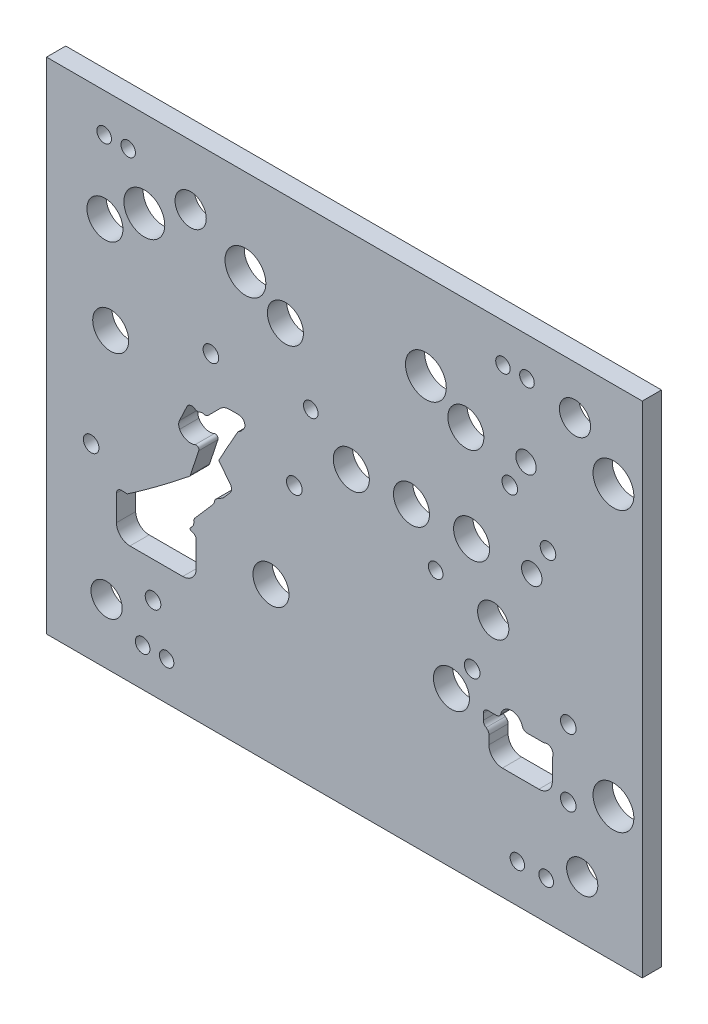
ISO-10303-21;
HEADER;
FILE_DESCRIPTION(('STEP AP214'),'2;1');
FILE_NAME('part.step','',(''),(''),'','','');
FILE_SCHEMA(('AUTOMOTIVE_DESIGN { 1 0 10303 214 1 1 1 1 }'));
ENDSEC;
DATA;
#1=APPLICATION_CONTEXT('core data for automotive mechanical design processes');
#2=APPLICATION_PROTOCOL_DEFINITION('international standard','automotive_design',2000,#1);
#3=PRODUCT_CONTEXT('',#1,'mechanical');
#4=PRODUCT('Part','Part','',(#3));
#5=PRODUCT_RELATED_PRODUCT_CATEGORY('part','',(#4));
#6=PRODUCT_DEFINITION_FORMATION('','',#4);
#7=PRODUCT_DEFINITION_CONTEXT('part definition',#1,'design');
#8=PRODUCT_DEFINITION('design','',#6,#7);
#9=PRODUCT_DEFINITION_SHAPE('','',#8);
#10=(LENGTH_UNIT() NAMED_UNIT(*) SI_UNIT(.MILLI.,.METRE.));
#11=(NAMED_UNIT(*) PLANE_ANGLE_UNIT() SI_UNIT($,.RADIAN.));
#12=(NAMED_UNIT(*) SI_UNIT($,.STERADIAN.) SOLID_ANGLE_UNIT());
#13=UNCERTAINTY_MEASURE_WITH_UNIT(LENGTH_MEASURE(1.E-05),#10,'distance_accuracy_value','');
#14=(GEOMETRIC_REPRESENTATION_CONTEXT(3) GLOBAL_UNCERTAINTY_ASSIGNED_CONTEXT((#13)) GLOBAL_UNIT_ASSIGNED_CONTEXT((#10,
#11,#12)) REPRESENTATION_CONTEXT('',''));
#15=CARTESIAN_POINT('',(0.,0.,0.));
#16=DIRECTION('',(0.,0.,1.));
#17=DIRECTION('',(1.,0.,0.));
#18=AXIS2_PLACEMENT_3D('',#15,#16,#17);
#19=CARTESIAN_POINT('',(-158.496,-88.8003363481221,0.));
#20=DIRECTION('',(-1.,0.,0.));
#21=DIRECTION('',(0.,0.,1.));
#22=AXIS2_PLACEMENT_3D('',#19,#20,#21);
#23=PLANE('',#22);
#24=DIRECTION('',(0.,0.,1.));
#25=VECTOR('',#24,1.);
#26=CARTESIAN_POINT('',(-158.496,-92.5002737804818,0.));
#27=LINE('',#26,#25);
#28=CARTESIAN_POINT('',(-158.496,-92.5002737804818,0.));
#29=VERTEX_POINT('',#28);
#30=CARTESIAN_POINT('',(-158.496,-92.5002737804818,12.7));
#31=VERTEX_POINT('',#30);
#32=EDGE_CURVE('E503',#29,#31,#27,.T.);
#33=ORIENTED_EDGE('',*,*,#32,.T.);
#34=DIRECTION('',(0.,-1.,0.));
#35=VECTOR('',#34,1.);
#36=CARTESIAN_POINT('',(-158.496,-88.8003363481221,12.7));
#37=LINE('',#36,#35);
#38=CARTESIAN_POINT('',(-158.496,-98.171,12.7));
#39=VERTEX_POINT('',#38);
#40=EDGE_CURVE('E560',#31,#39,#37,.T.);
#41=ORIENTED_EDGE('',*,*,#40,.T.);
#42=DIRECTION('',(0.,0.,1.));
#43=VECTOR('',#42,1.);
#44=CARTESIAN_POINT('',(-158.496,-98.171,0.));
#45=LINE('',#44,#43);
#46=CARTESIAN_POINT('',(-158.496,-98.171,0.));
#47=VERTEX_POINT('',#46);
#48=EDGE_CURVE('E580',#47,#39,#45,.T.);
#49=ORIENTED_EDGE('',*,*,#48,.F.);
#50=DIRECTION('',(0.,-1.,0.));
#51=VECTOR('',#50,1.);
#52=CARTESIAN_POINT('',(-158.496,-88.8003363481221,0.));
#53=LINE('',#52,#51);
#54=EDGE_CURVE('E532',#29,#47,#53,.T.);
#55=ORIENTED_EDGE('',*,*,#54,.F.);
#56=EDGE_LOOP('',(#33,#41,#49,#55));
#57=FACE_BOUND('',#56,.T.);
#58=ADVANCED_FACE('F47',(#57),#23,.F.);
#59=CARTESIAN_POINT('',(0.,0.,12.7));
#60=DIRECTION('',(0.,0.,1.));
#61=DIRECTION('',(1.,0.,0.));
#62=AXIS2_PLACEMENT_3D('',#59,#60,#61);
#63=PLANE('',#62);
#64=CARTESIAN_POINT('',(-162.30346,-92.5002737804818,12.7));
#65=DIRECTION('',(0.,0.,-1.));
#66=DIRECTION('',(-1.,0.,0.));
#67=AXIS2_PLACEMENT_3D('',#64,#65,#66);
#68=CIRCLE('',#67,3.80746);
#69=CARTESIAN_POINT('',(-160.3375,-89.2396368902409,12.7));
#70=VERTEX_POINT('',#69);
#71=EDGE_CURVE('E495',#70,#31,#68,.T.);
#72=ORIENTED_EDGE('',*,*,#71,.F.);
#73=CARTESIAN_POINT('',(-158.37154,-85.979,12.7));
#74=DIRECTION('',(0.,0.,1.));
#75=DIRECTION('',(1.,0.,0.));
#76=AXIS2_PLACEMENT_3D('',#73,#74,#75);
#77=CIRCLE('',#76,3.80745999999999);
#78=CARTESIAN_POINT('',(-162.179,-85.979,12.7));
#79=VERTEX_POINT('',#78);
#80=EDGE_CURVE('E497',#79,#70,#77,.T.);
#81=ORIENTED_EDGE('',*,*,#80,.F.);
#82=DIRECTION('',(0.,-1.,0.));
#83=VECTOR('',#82,1.);
#84=CARTESIAN_POINT('',(-162.179,-81.915,12.7));
#85=LINE('',#84,#83);
#86=CARTESIAN_POINT('',(-162.179,-81.915,12.7));
#87=VERTEX_POINT('',#86);
#88=EDGE_CURVE('E475',#87,#79,#85,.T.);
#89=ORIENTED_EDGE('',*,*,#88,.F.);
#90=CARTESIAN_POINT('',(-159.131,-81.915,12.7));
#91=DIRECTION('',(0.,0.,1.));
#92=DIRECTION('',(1.,0.,0.));
#93=AXIS2_PLACEMENT_3D('',#90,#91,#92);
#94=CIRCLE('',#93,3.04799999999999);
#95=CARTESIAN_POINT('',(-159.131,-78.867,12.7));
#96=VERTEX_POINT('',#95);
#97=EDGE_CURVE('E557',#96,#87,#94,.T.);
#98=ORIENTED_EDGE('',*,*,#97,.F.);
#99=DIRECTION('',(-1.,0.,0.));
#100=VECTOR('',#99,1.);
#101=CARTESIAN_POINT('',(-150.820270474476,-78.867,12.7));
#102=LINE('',#101,#100);
#103=CARTESIAN_POINT('',(-153.668642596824,-78.867,12.7));
#104=VERTEX_POINT('',#103);
#105=EDGE_CURVE('E555',#104,#96,#102,.T.);
#106=ORIENTED_EDGE('',*,*,#105,.F.);
#107=CARTESIAN_POINT('',(-153.668642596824,-75.692,12.7));
#108=DIRECTION('',(0.,0.,1.));
#109=DIRECTION('',(1.,0.,0.));
#110=AXIS2_PLACEMENT_3D('',#107,#108,#109);
#111=CIRCLE('',#110,3.175);
#112=CARTESIAN_POINT('',(-150.597710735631,-76.4982273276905,12.7));
#113=VERTEX_POINT('',#112);
#114=EDGE_CURVE('E1175',#104,#113,#111,.T.);
#115=ORIENTED_EDGE('',*,*,#114,.T.);
#116=CARTESIAN_POINT('',(-143.51,-78.359,12.7));
#117=DIRECTION('',(0.,0.,1.));
#118=DIRECTION('',(1.,0.,0.));
#119=AXIS2_PLACEMENT_3D('',#116,#117,#118);
#120=CIRCLE('',#119,7.32789999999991);
#121=CARTESIAN_POINT('',(-136.422289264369,-76.4982273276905,12.7));
#122=VERTEX_POINT('',#121);
#123=EDGE_CURVE('E552',#122,#113,#120,.T.);
#124=ORIENTED_EDGE('',*,*,#123,.F.);
#125=CARTESIAN_POINT('',(-133.351357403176,-75.692,12.7));
#126=DIRECTION('',(0.,0.,1.));
#127=DIRECTION('',(1.,0.,0.));
#128=AXIS2_PLACEMENT_3D('',#125,#126,#127);
#129=CIRCLE('',#128,3.175);
#130=CARTESIAN_POINT('',(-133.351357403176,-78.867,12.7));
#131=VERTEX_POINT('',#130);
#132=EDGE_CURVE('E1173',#122,#131,#129,.T.);
#133=ORIENTED_EDGE('',*,*,#132,.T.);
#134=DIRECTION('',(-1.,0.,0.));
#135=VECTOR('',#134,1.);
#136=CARTESIAN_POINT('',(-122.109475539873,-78.867,12.7));
#137=LINE('',#136,#135);
#138=CARTESIAN_POINT('',(-122.805974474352,-78.867,12.7));
#139=VERTEX_POINT('',#138);
#140=EDGE_CURVE('E549',#139,#131,#137,.T.);
#141=ORIENTED_EDGE('',*,*,#140,.F.);
#142=CARTESIAN_POINT('',(-122.805974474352,-75.692,12.7));
#143=DIRECTION('',(0.,0.,1.));
#144=DIRECTION('',(1.,0.,0.));
#145=AXIS2_PLACEMENT_3D('',#142,#143,#144);
#146=CIRCLE('',#145,3.175);
#147=CARTESIAN_POINT('',(-121.63756461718,-78.6441929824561,12.7));
#148=VERTEX_POINT('',#147);
#149=EDGE_CURVE('E1177',#139,#148,#146,.T.);
#150=ORIENTED_EDGE('',*,*,#149,.T.);
#151=CARTESIAN_POINT('',(-120.142,-82.423,12.7));
#152=DIRECTION('',(0.,0.,1.));
#153=DIRECTION('',(1.,0.,0.));
#154=AXIS2_PLACEMENT_3D('',#151,#152,#153);
#155=CIRCLE('',#154,4.064);
#156=CARTESIAN_POINT('',(-116.363192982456,-83.9185646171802,12.7));
#157=VERTEX_POINT('',#156);
#158=EDGE_CURVE('E517',#157,#148,#155,.T.);
#159=ORIENTED_EDGE('',*,*,#158,.F.);
#160=CARTESIAN_POINT('',(-113.411,-85.0869744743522,12.7));
#161=DIRECTION('',(0.,0.,1.));
#162=DIRECTION('',(1.,0.,0.));
#163=AXIS2_PLACEMENT_3D('',#160,#161,#162);
#164=CIRCLE('',#163,3.175);
#165=CARTESIAN_POINT('',(-116.586,-85.0869744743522,12.7));
#166=VERTEX_POINT('',#165);
#167=EDGE_CURVE('E1179',#157,#166,#164,.T.);
#168=ORIENTED_EDGE('',*,*,#167,.T.);
#169=DIRECTION('',(0.,1.,0.));
#170=VECTOR('',#169,1.);
#171=CARTESIAN_POINT('',(-116.586,-98.171,12.7));
#172=LINE('',#171,#170);
#173=CARTESIAN_POINT('',(-116.586,-98.171,12.7));
#174=VERTEX_POINT('',#173);
#175=EDGE_CURVE('E523',#174,#166,#172,.T.);
#176=ORIENTED_EDGE('',*,*,#175,.F.);
#177=CARTESIAN_POINT('',(-125.476,-98.171,12.7));
#178=DIRECTION('',(0.,0.,1.));
#179=DIRECTION('',(1.,0.,0.));
#180=AXIS2_PLACEMENT_3D('',#177,#178,#179);
#181=CIRCLE('',#180,8.88999999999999);
#182=CARTESIAN_POINT('',(-125.476,-107.061,12.7));
#183=VERTEX_POINT('',#182);
#184=EDGE_CURVE('E568',#183,#174,#181,.T.);
#185=ORIENTED_EDGE('',*,*,#184,.F.);
#186=DIRECTION('',(1.,0.,0.));
#187=VECTOR('',#186,1.);
#188=CARTESIAN_POINT('',(-149.606,-107.061,12.7));
#189=LINE('',#188,#187);
#190=CARTESIAN_POINT('',(-149.606,-107.061,12.7));
#191=VERTEX_POINT('',#190);
#192=EDGE_CURVE('E565',#191,#183,#189,.T.);
#193=ORIENTED_EDGE('',*,*,#192,.F.);
#194=CARTESIAN_POINT('',(-149.606,-98.171,12.7));
#195=DIRECTION('',(0.,0.,1.));
#196=DIRECTION('',(1.,0.,0.));
#197=AXIS2_PLACEMENT_3D('',#194,#195,#196);
#198=CIRCLE('',#197,8.88999999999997);
#199=EDGE_CURVE('E562',#39,#191,#198,.T.);
#200=ORIENTED_EDGE('',*,*,#199,.F.);
#201=ORIENTED_EDGE('',*,*,#40,.F.);
#202=EDGE_LOOP('',(#72,#81,#89,#98,#106,#115,#124,#133,#141,#150,#159,#168,#176,#185,#193,#200,#201));
#203=FACE_BOUND('',#202,.T.);
#204=DIRECTION('',(0.,1.,0.));
#205=VECTOR('',#204,1.);
#206=CARTESIAN_POINT('',(-57.15,-180.975,12.7));
#207=LINE('',#206,#205);
#208=CARTESIAN_POINT('',(-57.15,-180.975,12.7));
#209=VERTEX_POINT('',#208);
#210=CARTESIAN_POINT('',(-57.15,149.225,12.7));
#211=VERTEX_POINT('',#210);
#212=EDGE_CURVE('E1127',#209,#211,#207,.T.);
#213=ORIENTED_EDGE('',*,*,#212,.T.);
#214=DIRECTION('',(-1.,0.,0.));
#215=VECTOR('',#214,1.);
#216=CARTESIAN_POINT('',(-57.15,149.225,12.7));
#217=LINE('',#216,#215);
#218=CARTESIAN_POINT('',(-450.85,149.225,12.7));
#219=VERTEX_POINT('',#218);
#220=EDGE_CURVE('E1130',#211,#219,#217,.T.);
#221=ORIENTED_EDGE('',*,*,#220,.T.);
#222=DIRECTION('',(0.,-1.,0.));
#223=VECTOR('',#222,1.);
#224=CARTESIAN_POINT('',(-450.85,149.225,12.7));
#225=LINE('',#224,#223);
#226=CARTESIAN_POINT('',(-450.85,-180.975,12.7));
#227=VERTEX_POINT('',#226);
#228=EDGE_CURVE('E1133',#219,#227,#225,.T.);
#229=ORIENTED_EDGE('',*,*,#228,.T.);
#230=DIRECTION('',(1.,0.,0.));
#231=VECTOR('',#230,1.);
#232=CARTESIAN_POINT('',(-450.85,-180.975,12.7));
#233=LINE('',#232,#231);
#234=EDGE_CURVE('E1135',#227,#209,#233,.T.);
#235=ORIENTED_EDGE('',*,*,#234,.T.);
#236=EDGE_LOOP('',(#213,#221,#229,#235));
#237=FACE_BOUND('',#236,.T.);
#238=CARTESIAN_POINT('',(-133.985,75.8952,12.7));
#239=DIRECTION('',(0.,0.,1.));
#240=DIRECTION('',(1.,0.,0.));
#241=AXIS2_PLACEMENT_3D('',#238,#239,#240);
#242=CIRCLE('',#241,6.74687500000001);
#243=CARTESIAN_POINT('',(-127.238125,75.8952,12.7));
#244=VERTEX_POINT('',#243);
#245=EDGE_CURVE('E1123',#244,#244,#242,.T.);
#246=ORIENTED_EDGE('',*,*,#245,.F.);
#247=EDGE_LOOP('',(#246));
#248=FACE_BOUND('',#247,.T.);
#249=CARTESIAN_POINT('',(-130.175,13.97,12.7));
#250=DIRECTION('',(0.,0.,1.));
#251=DIRECTION('',(1.,0.,0.));
#252=AXIS2_PLACEMENT_3D('',#249,#250,#251);
#253=CIRCLE('',#252,6.746875);
#254=CARTESIAN_POINT('',(-123.428125,13.97,12.7));
#255=VERTEX_POINT('',#254);
#256=EDGE_CURVE('E1117',#255,#255,#253,.T.);
#257=ORIENTED_EDGE('',*,*,#256,.F.);
#258=EDGE_LOOP('',(#257));
#259=FACE_BOUND('',#258,.T.);
#260=CARTESIAN_POINT('',(-386.207,92.075,12.7));
#261=DIRECTION('',(0.,0.,1.));
#262=DIRECTION('',(1.,0.,0.));
#263=AXIS2_PLACEMENT_3D('',#260,#261,#262);
#264=CIRCLE('',#263,13.49375);
#265=CARTESIAN_POINT('',(-372.71325,92.075,12.7));
#266=VERTEX_POINT('',#265);
#267=EDGE_CURVE('E1111',#266,#266,#264,.T.);
#268=ORIENTED_EDGE('',*,*,#267,.F.);
#269=EDGE_LOOP('',(#268));
#270=FACE_BOUND('',#269,.T.);
#271=CARTESIAN_POINT('',(-319.405,92.075,12.7));
#272=DIRECTION('',(0.,0.,1.));
#273=DIRECTION('',(1.,0.,0.));
#274=AXIS2_PLACEMENT_3D('',#271,#272,#273);
#275=CIRCLE('',#274,13.49375);
#276=CARTESIAN_POINT('',(-305.91125,92.075,12.7));
#277=VERTEX_POINT('',#276);
#278=EDGE_CURVE('E1105',#277,#277,#275,.T.);
#279=ORIENTED_EDGE('',*,*,#278,.F.);
#280=EDGE_LOOP('',(#279));
#281=FACE_BOUND('',#280,.T.);
#282=CARTESIAN_POINT('',(-200.152,92.075,12.7));
#283=DIRECTION('',(0.,0.,1.));
#284=DIRECTION('',(1.,0.,0.));
#285=AXIS2_PLACEMENT_3D('',#282,#283,#284);
#286=CIRCLE('',#285,13.49375);
#287=CARTESIAN_POINT('',(-186.65825,92.075,12.7));
#288=VERTEX_POINT('',#287);
#289=EDGE_CURVE('E1099',#288,#288,#286,.T.);
#290=ORIENTED_EDGE('',*,*,#289,.F.);
#291=EDGE_LOOP('',(#290));
#292=FACE_BOUND('',#291,.T.);
#293=CARTESIAN_POINT('',(-76.2,-92.329,12.7));
#294=DIRECTION('',(0.,0.,1.));
#295=DIRECTION('',(1.,0.,0.));
#296=AXIS2_PLACEMENT_3D('',#293,#294,#295);
#297=CIRCLE('',#296,13.49375);
#298=CARTESIAN_POINT('',(-62.70625,-92.329,12.7));
#299=VERTEX_POINT('',#298);
#300=EDGE_CURVE('E1093',#299,#299,#297,.T.);
#301=ORIENTED_EDGE('',*,*,#300,.F.);
#302=EDGE_LOOP('',(#301));
#303=FACE_BOUND('',#302,.T.);
#304=CARTESIAN_POINT('',(-76.2,92.075,12.7));
#305=DIRECTION('',(0.,0.,1.));
#306=DIRECTION('',(1.,0.,0.));
#307=AXIS2_PLACEMENT_3D('',#304,#305,#306);
#308=CIRCLE('',#307,13.49375);
#309=CARTESIAN_POINT('',(-62.70625,92.075,12.7));
#310=VERTEX_POINT('',#309);
#311=EDGE_CURVE('E1087',#310,#310,#308,.T.);
#312=ORIENTED_EDGE('',*,*,#311,.F.);
#313=EDGE_LOOP('',(#312));
#314=FACE_BOUND('',#313,.T.);
#315=CARTESIAN_POINT('',(-193.675,-15.875,12.7));
#316=DIRECTION('',(0.,0.,1.));
#317=DIRECTION('',(1.,0.,0.));
#318=AXIS2_PLACEMENT_3D('',#315,#316,#317);
#319=CIRCLE('',#318,4.826);
#320=CARTESIAN_POINT('',(-188.849,-15.875,12.7));
#321=VERTEX_POINT('',#320);
#322=EDGE_CURVE('E1081',#321,#321,#319,.T.);
#323=ORIENTED_EDGE('',*,*,#322,.F.);
#324=EDGE_LOOP('',(#323));
#325=FACE_BOUND('',#324,.T.);
#326=CARTESIAN_POINT('',(-276.225,34.925,12.7));
#327=DIRECTION('',(0.,0.,1.));
#328=DIRECTION('',(1.,0.,0.));
#329=AXIS2_PLACEMENT_3D('',#326,#327,#328);
#330=CIRCLE('',#329,4.826);
#331=CARTESIAN_POINT('',(-271.399,34.925,12.7));
#332=VERTEX_POINT('',#331);
#333=EDGE_CURVE('E1075',#332,#332,#330,.T.);
#334=ORIENTED_EDGE('',*,*,#333,.F.);
#335=EDGE_LOOP('',(#334));
#336=FACE_BOUND('',#335,.T.);
#337=CARTESIAN_POINT('',(-133.35,123.825,12.7));
#338=DIRECTION('',(0.,0.,1.));
#339=DIRECTION('',(1.,0.,0.));
#340=AXIS2_PLACEMENT_3D('',#337,#338,#339);
#341=CIRCLE('',#340,4.826);
#342=CARTESIAN_POINT('',(-128.524,123.825,12.7));
#343=VERTEX_POINT('',#342);
#344=EDGE_CURVE('E1069',#343,#343,#341,.T.);
#345=ORIENTED_EDGE('',*,*,#344,.F.);
#346=EDGE_LOOP('',(#345));
#347=FACE_BOUND('',#346,.T.);
#348=CARTESIAN_POINT('',(-412.75,123.825,12.7));
#349=DIRECTION('',(0.,0.,1.));
#350=DIRECTION('',(1.,0.,0.));
#351=AXIS2_PLACEMENT_3D('',#348,#349,#350);
#352=CIRCLE('',#351,4.826);
#353=CARTESIAN_POINT('',(-407.924,123.825,12.7));
#354=VERTEX_POINT('',#353);
#355=EDGE_CURVE('E1063',#354,#354,#352,.T.);
#356=ORIENTED_EDGE('',*,*,#355,.F.);
#357=EDGE_LOOP('',(#356));
#358=FACE_BOUND('',#357,.T.);
#359=CARTESIAN_POINT('',(-387.35,-155.575,12.7));
#360=DIRECTION('',(0.,0.,1.));
#361=DIRECTION('',(1.,0.,0.));
#362=AXIS2_PLACEMENT_3D('',#359,#360,#361);
#363=CIRCLE('',#362,4.826);
#364=CARTESIAN_POINT('',(-382.524,-155.575,12.7));
#365=VERTEX_POINT('',#364);
#366=EDGE_CURVE('E1057',#365,#365,#363,.T.);
#367=ORIENTED_EDGE('',*,*,#366,.F.);
#368=EDGE_LOOP('',(#367));
#369=FACE_BOUND('',#368,.T.);
#370=CARTESIAN_POINT('',(-120.65,-155.575,12.7));
#371=DIRECTION('',(0.,0.,1.));
#372=DIRECTION('',(1.,0.,0.));
#373=AXIS2_PLACEMENT_3D('',#370,#371,#372);
#374=CIRCLE('',#373,4.826);
#375=CARTESIAN_POINT('',(-115.824,-155.575,12.7));
#376=VERTEX_POINT('',#375);
#377=EDGE_CURVE('E1051',#376,#376,#374,.T.);
#378=ORIENTED_EDGE('',*,*,#377,.F.);
#379=EDGE_LOOP('',(#378));
#380=FACE_BOUND('',#379,.T.);
#381=CARTESIAN_POINT('',(-149.225,123.825,12.7));
#382=DIRECTION('',(0.,0.,-1.));
#383=DIRECTION('',(-1.,0.,0.));
#384=AXIS2_PLACEMENT_3D('',#381,#382,#383);
#385=CIRCLE('',#384,4.77520000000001);
#386=CARTESIAN_POINT('',(-154.0002,123.825,12.7));
#387=VERTEX_POINT('',#386);
#388=EDGE_CURVE('E1042',#387,#387,#385,.T.);
#389=ORIENTED_EDGE('',*,*,#388,.T.);
#390=EDGE_LOOP('',(#389));
#391=FACE_BOUND('',#390,.T.);
#392=CARTESIAN_POINT('',(-139.7,-155.575,12.7));
#393=DIRECTION('',(0.,0.,-1.));
#394=DIRECTION('',(-1.,0.,0.));
#395=AXIS2_PLACEMENT_3D('',#392,#393,#394);
#396=CIRCLE('',#395,4.77520000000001);
#397=CARTESIAN_POINT('',(-144.4752,-155.575,12.7));
#398=VERTEX_POINT('',#397);
#399=EDGE_CURVE('E1036',#398,#398,#396,.T.);
#400=ORIENTED_EDGE('',*,*,#399,.T.);
#401=EDGE_LOOP('',(#400));
#402=FACE_BOUND('',#401,.T.);
#403=CARTESIAN_POINT('',(-371.475,-155.575,12.7));
#404=DIRECTION('',(0.,0.,-1.));
#405=DIRECTION('',(-1.,0.,0.));
#406=AXIS2_PLACEMENT_3D('',#403,#404,#405);
#407=CIRCLE('',#406,4.77519999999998);
#408=CARTESIAN_POINT('',(-376.2502,-155.575,12.7));
#409=VERTEX_POINT('',#408);
#410=EDGE_CURVE('E1030',#409,#409,#407,.T.);
#411=ORIENTED_EDGE('',*,*,#410,.T.);
#412=EDGE_LOOP('',(#411));
#413=FACE_BOUND('',#412,.T.);
#414=CARTESIAN_POINT('',(-396.875,123.825,12.7));
#415=DIRECTION('',(0.,0.,-1.));
#416=DIRECTION('',(-1.,0.,0.));
#417=AXIS2_PLACEMENT_3D('',#414,#415,#416);
#418=CIRCLE('',#417,4.77519999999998);
#419=CARTESIAN_POINT('',(-401.6502,123.825,12.7));
#420=VERTEX_POINT('',#419);
#421=EDGE_CURVE('E1024',#420,#420,#418,.T.);
#422=ORIENTED_EDGE('',*,*,#421,.T.);
#423=EDGE_LOOP('',(#422));
#424=FACE_BOUND('',#423,.T.);
#425=CARTESIAN_POINT('',(-169.545,-60.325,12.7));
#426=DIRECTION('',(0.,0.,1.));
#427=DIRECTION('',(1.,0.,0.));
#428=AXIS2_PLACEMENT_3D('',#425,#426,#427);
#429=CIRCLE('',#428,5.1562);
#430=CARTESIAN_POINT('',(-164.3888,-60.325,12.7));
#431=VERTEX_POINT('',#430);
#432=EDGE_CURVE('E1021',#431,#431,#429,.T.);
#433=ORIENTED_EDGE('',*,*,#432,.F.);
#434=EDGE_LOOP('',(#433));
#435=FACE_BOUND('',#434,.T.);
#436=CARTESIAN_POINT('',(-106.045,-104.775,12.7));
#437=DIRECTION('',(0.,0.,1.));
#438=DIRECTION('',(1.,0.,0.));
#439=AXIS2_PLACEMENT_3D('',#436,#437,#438);
#440=CIRCLE('',#439,5.1562);
#441=CARTESIAN_POINT('',(-100.8888,-104.775,12.7));
#442=VERTEX_POINT('',#441);
#443=EDGE_CURVE('E1015',#442,#442,#440,.T.);
#444=ORIENTED_EDGE('',*,*,#443,.F.);
#445=EDGE_LOOP('',(#444));
#446=FACE_BOUND('',#445,.T.);
#447=CARTESIAN_POINT('',(-106.045,-60.325,12.7));
#448=DIRECTION('',(0.,0.,1.));
#449=DIRECTION('',(1.,0.,0.));
#450=AXIS2_PLACEMENT_3D('',#447,#448,#449);
#451=CIRCLE('',#450,5.1562);
#452=CARTESIAN_POINT('',(-100.8888,-60.325,12.7));
#453=VERTEX_POINT('',#452);
#454=EDGE_CURVE('E1009',#453,#453,#451,.T.);
#455=ORIENTED_EDGE('',*,*,#454,.F.);
#456=EDGE_LOOP('',(#455));
#457=FACE_BOUND('',#456,.T.);
#458=CARTESIAN_POINT('',(-421.34840737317,-57.29172099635,12.7));
#459=DIRECTION('',(0.,0.,1.));
#460=DIRECTION('',(1.,0.,0.));
#461=AXIS2_PLACEMENT_3D('',#458,#459,#460);
#462=CIRCLE('',#461,5.1562);
#463=CARTESIAN_POINT('',(-416.19220737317,-57.29172099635,12.7));
#464=VERTEX_POINT('',#463);
#465=EDGE_CURVE('E1003',#464,#464,#462,.T.);
#466=ORIENTED_EDGE('',*,*,#465,.F.);
#467=EDGE_LOOP('',(#466));
#468=FACE_BOUND('',#467,.T.);
#469=CARTESIAN_POINT('',(-380.469642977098,-126.433073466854,12.7));
#470=DIRECTION('',(0.,0.,1.));
#471=DIRECTION('',(1.,0.,0.));
#472=AXIS2_PLACEMENT_3D('',#469,#470,#471);
#473=CIRCLE('',#472,5.1562);
#474=CARTESIAN_POINT('',(-375.313442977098,-126.433073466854,12.7));
#475=VERTEX_POINT('',#474);
#476=EDGE_CURVE('E997',#475,#475,#473,.T.);
#477=ORIENTED_EDGE('',*,*,#476,.F.);
#478=EDGE_LOOP('',(#477));
#479=FACE_BOUND('',#478,.T.);
#480=CARTESIAN_POINT('',(-287.103320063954,-14.0791110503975,12.7));
#481=DIRECTION('',(0.,0.,1.));
#482=DIRECTION('',(1.,0.,0.));
#483=AXIS2_PLACEMENT_3D('',#480,#481,#482);
#484=CIRCLE('',#483,5.1562);
#485=CARTESIAN_POINT('',(-281.947120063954,-14.0791110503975,12.7));
#486=VERTEX_POINT('',#485);
#487=EDGE_CURVE('E991',#486,#486,#484,.T.);
#488=ORIENTED_EDGE('',*,*,#487,.F.);
#489=EDGE_LOOP('',(#488));
#490=FACE_BOUND('',#489,.T.);
#491=CARTESIAN_POINT('',(-342.239393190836,33.8026606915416,12.7));
#492=DIRECTION('',(0.,0.,1.));
#493=DIRECTION('',(1.,0.,0.));
#494=AXIS2_PLACEMENT_3D('',#491,#492,#493);
#495=CIRCLE('',#494,5.1562);
#496=CARTESIAN_POINT('',(-337.083193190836,33.8026606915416,12.7));
#497=VERTEX_POINT('',#496);
#498=EDGE_CURVE('E985',#497,#497,#495,.T.);
#499=ORIENTED_EDGE('',*,*,#498,.F.);
#500=EDGE_LOOP('',(#499));
#501=FACE_BOUND('',#500,.T.);
#502=CARTESIAN_POINT('',(-355.6,109.5375,12.7));
#503=DIRECTION('',(0.,0.,1.));
#504=DIRECTION('',(1.,0.,0.));
#505=AXIS2_PLACEMENT_3D('',#502,#503,#504);
#506=CIRCLE('',#505,10.31875);
#507=CARTESIAN_POINT('',(-345.28125,109.5375,12.7));
#508=VERTEX_POINT('',#507);
#509=EDGE_CURVE('E979',#508,#508,#506,.T.);
#510=ORIENTED_EDGE('',*,*,#509,.F.);
#511=EDGE_LOOP('',(#510));
#512=FACE_BOUND('',#511,.T.);
#513=CARTESIAN_POINT('',(-411.1625,-141.2875,12.7));
#514=DIRECTION('',(0.,0.,1.));
#515=DIRECTION('',(1.,0.,0.));
#516=AXIS2_PLACEMENT_3D('',#513,#514,#515);
#517=CIRCLE('',#516,10.31875);
#518=CARTESIAN_POINT('',(-400.84375,-141.2875,12.7));
#519=VERTEX_POINT('',#518);
#520=EDGE_CURVE('E973',#519,#519,#517,.T.);
#521=ORIENTED_EDGE('',*,*,#520,.F.);
#522=EDGE_LOOP('',(#521));
#523=FACE_BOUND('',#522,.T.);
#524=CARTESIAN_POINT('',(-96.8375,-142.875,12.7));
#525=DIRECTION('',(0.,0.,1.));
#526=DIRECTION('',(1.,0.,0.));
#527=AXIS2_PLACEMENT_3D('',#524,#525,#526);
#528=CIRCLE('',#527,10.31875);
#529=CARTESIAN_POINT('',(-86.51875,-142.875,12.7));
#530=VERTEX_POINT('',#529);
#531=EDGE_CURVE('E967',#530,#530,#528,.T.);
#532=ORIENTED_EDGE('',*,*,#531,.F.);
#533=EDGE_LOOP('',(#532));
#534=FACE_BOUND('',#533,.T.);
#535=CARTESIAN_POINT('',(-101.6,117.475,12.7));
#536=DIRECTION('',(0.,0.,1.));
#537=DIRECTION('',(1.,0.,0.));
#538=AXIS2_PLACEMENT_3D('',#535,#536,#537);
#539=CIRCLE('',#538,10.31875);
#540=CARTESIAN_POINT('',(-91.28125,117.475,12.7));
#541=VERTEX_POINT('',#540);
#542=EDGE_CURVE('E961',#541,#541,#539,.T.);
#543=ORIENTED_EDGE('',*,*,#542,.F.);
#544=EDGE_LOOP('',(#543));
#545=FACE_BOUND('',#544,.T.);
#546=CARTESIAN_POINT('',(-155.6385,-25.4,12.7));
#547=DIRECTION('',(0.,0.,1.));
#548=DIRECTION('',(1.,0.,0.));
#549=AXIS2_PLACEMENT_3D('',#546,#547,#548);
#550=CIRCLE('',#549,10.31875);
#551=CARTESIAN_POINT('',(-145.31975,-25.4,12.7));
#552=VERTEX_POINT('',#551);
#553=EDGE_CURVE('E955',#552,#552,#550,.T.);
#554=ORIENTED_EDGE('',*,*,#553,.F.);
#555=EDGE_LOOP('',(#554));
#556=FACE_BOUND('',#555,.T.);
#557=CARTESIAN_POINT('',(-144.700625,57.3351930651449,12.7));
#558=DIRECTION('',(0.,0.,1.));
#559=DIRECTION('',(1.,0.,0.));
#560=AXIS2_PLACEMENT_3D('',#557,#558,#559);
#561=CIRCLE('',#560,5.15937499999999);
#562=CARTESIAN_POINT('',(-139.54125,57.3351930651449,12.7));
#563=VERTEX_POINT('',#562);
#564=EDGE_CURVE('E949',#563,#563,#561,.T.);
#565=ORIENTED_EDGE('',*,*,#564,.F.);
#566=EDGE_LOOP('',(#565));
#567=FACE_BOUND('',#566,.T.);
#568=CARTESIAN_POINT('',(-119.459375,32.5300069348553,12.7));
#569=DIRECTION('',(0.,0.,1.));
#570=DIRECTION('',(1.,0.,0.));
#571=AXIS2_PLACEMENT_3D('',#568,#569,#570);
#572=CIRCLE('',#571,5.15937499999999);
#573=CARTESIAN_POINT('',(-114.3,32.5300069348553,12.7));
#574=VERTEX_POINT('',#573);
#575=EDGE_CURVE('E943',#574,#574,#572,.T.);
#576=ORIENTED_EDGE('',*,*,#575,.F.);
#577=EDGE_LOOP('',(#576));
#578=FACE_BOUND('',#577,.T.);
#579=CARTESIAN_POINT('',(-169.926,13.97,12.7));
#580=DIRECTION('',(0.,0.,-1.));
#581=DIRECTION('',(-1.,0.,0.));
#582=AXIS2_PLACEMENT_3D('',#579,#580,#581);
#583=CIRCLE('',#582,11.90625);
#584=CARTESIAN_POINT('',(-181.83225,13.97,12.7));
#585=VERTEX_POINT('',#584);
#586=EDGE_CURVE('E934',#585,#585,#583,.T.);
#587=ORIENTED_EDGE('',*,*,#586,.T.);
#588=EDGE_LOOP('',(#587));
#589=FACE_BOUND('',#588,.T.);
#590=CARTESIAN_POINT('',(-302.514,-78.3590000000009,12.7));
#591=DIRECTION('',(0.,0.,-1.));
#592=DIRECTION('',(-1.,0.,0.));
#593=AXIS2_PLACEMENT_3D('',#590,#591,#592);
#594=CIRCLE('',#593,11.90625);
#595=CARTESIAN_POINT('',(-314.42025,-78.3590000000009,12.7));
#596=VERTEX_POINT('',#595);
#597=EDGE_CURVE('E928',#596,#596,#594,.T.);
#598=ORIENTED_EDGE('',*,*,#597,.T.);
#599=EDGE_LOOP('',(#598));
#600=FACE_BOUND('',#599,.T.);
#601=CARTESIAN_POINT('',(-183.261,-78.359,12.7));
#602=DIRECTION('',(0.,0.,-1.));
#603=DIRECTION('',(-1.,0.,0.));
#604=AXIS2_PLACEMENT_3D('',#601,#602,#603);
#605=CIRCLE('',#604,11.90625);
#606=CARTESIAN_POINT('',(-195.16725,-78.359,12.7));
#607=VERTEX_POINT('',#606);
#608=EDGE_CURVE('E922',#607,#607,#605,.T.);
#609=ORIENTED_EDGE('',*,*,#608,.T.);
#610=EDGE_LOOP('',(#609));
#611=FACE_BOUND('',#610,.T.);
#612=CARTESIAN_POINT('',(-408.432,13.97,12.7));
#613=DIRECTION('',(0.,0.,-1.));
#614=DIRECTION('',(-1.,0.,0.));
#615=AXIS2_PLACEMENT_3D('',#612,#613,#614);
#616=CIRCLE('',#615,11.90625);
#617=CARTESIAN_POINT('',(-420.33825,13.97,12.7));
#618=VERTEX_POINT('',#617);
#619=EDGE_CURVE('E916',#618,#618,#616,.T.);
#620=ORIENTED_EDGE('',*,*,#619,.T.);
#621=EDGE_LOOP('',(#620));
#622=FACE_BOUND('',#621,.T.);
#623=CARTESIAN_POINT('',(-412.242,75.8952,12.7));
#624=DIRECTION('',(0.,0.,-1.));
#625=DIRECTION('',(-1.,0.,0.));
#626=AXIS2_PLACEMENT_3D('',#623,#624,#625);
#627=CIRCLE('',#626,11.90625);
#628=CARTESIAN_POINT('',(-424.14825,75.8952,12.7));
#629=VERTEX_POINT('',#628);
#630=EDGE_CURVE('E910',#629,#629,#627,.T.);
#631=ORIENTED_EDGE('',*,*,#630,.T.);
#632=EDGE_LOOP('',(#631));
#633=FACE_BOUND('',#632,.T.);
#634=CARTESIAN_POINT('',(-292.989,75.8952,12.7));
#635=DIRECTION('',(0.,0.,-1.));
#636=DIRECTION('',(-1.,0.,0.));
#637=AXIS2_PLACEMENT_3D('',#634,#635,#636);
#638=CIRCLE('',#637,11.90625);
#639=CARTESIAN_POINT('',(-304.89525,75.8952,12.7));
#640=VERTEX_POINT('',#639);
#641=EDGE_CURVE('E904',#640,#640,#638,.T.);
#642=ORIENTED_EDGE('',*,*,#641,.T.);
#643=EDGE_LOOP('',(#642));
#644=FACE_BOUND('',#643,.T.);
#645=CARTESIAN_POINT('',(-249.428,13.97,12.7));
#646=DIRECTION('',(0.,0.,-1.));
#647=DIRECTION('',(-1.,0.,0.));
#648=AXIS2_PLACEMENT_3D('',#645,#646,#647);
#649=CIRCLE('',#648,11.90625);
#650=CARTESIAN_POINT('',(-261.33425,13.97,12.7));
#651=VERTEX_POINT('',#650);
#652=EDGE_CURVE('E898',#651,#651,#649,.T.);
#653=ORIENTED_EDGE('',*,*,#652,.T.);
#654=EDGE_LOOP('',(#653));
#655=FACE_BOUND('',#654,.T.);
#656=CARTESIAN_POINT('',(-209.677,13.97,12.7));
#657=DIRECTION('',(0.,0.,-1.));
#658=DIRECTION('',(-1.,0.,0.));
#659=AXIS2_PLACEMENT_3D('',#656,#657,#658);
#660=CIRCLE('',#659,11.90625);
#661=CARTESIAN_POINT('',(-221.58325,13.97,12.7));
#662=VERTEX_POINT('',#661);
#663=EDGE_CURVE('E892',#662,#662,#660,.T.);
#664=ORIENTED_EDGE('',*,*,#663,.T.);
#665=EDGE_LOOP('',(#664));
#666=FACE_BOUND('',#665,.T.);
#667=CARTESIAN_POINT('',(-173.736,75.8952,12.7));
#668=DIRECTION('',(0.,0.,-1.));
#669=DIRECTION('',(-1.,0.,0.));
#670=AXIS2_PLACEMENT_3D('',#667,#668,#669);
#671=CIRCLE('',#670,11.90625);
#672=CARTESIAN_POINT('',(-185.64225,75.8952,12.7));
#673=VERTEX_POINT('',#672);
#674=EDGE_CURVE('E813',#673,#673,#671,.T.);
#675=ORIENTED_EDGE('',*,*,#674,.T.);
#676=EDGE_LOOP('',(#675));
#677=FACE_BOUND('',#676,.T.);
#678=CARTESIAN_POINT('',(-793.724322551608,499.827439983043,12.7));
#679=DIRECTION('',(0.,0.,-1.));
#680=DIRECTION('',(1.,0.,0.));
#681=AXIS2_PLACEMENT_3D('',#678,#679,#680);
#682=CIRCLE('',#681,697.459999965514);
#683=CARTESIAN_POINT('',(-356.777257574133,-43.7971675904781,12.7));
#684=VERTEX_POINT('',#683);
#685=CARTESIAN_POINT('',(-391.642311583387,-70.0677328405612,12.7));
#686=VERTEX_POINT('',#685);
#687=EDGE_CURVE('E730',#684,#686,#682,.T.);
#688=ORIENTED_EDGE('',*,*,#687,.F.);
#689=CARTESIAN_POINT('',(-358.766342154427,-41.3224620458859,12.7));
#690=DIRECTION('',(0.,0.,1.));
#691=DIRECTION('',(1.,0.,0.));
#692=AXIS2_PLACEMENT_3D('',#689,#690,#691);
#693=CIRCLE('',#692,3.175);
#694=CARTESIAN_POINT('',(-355.753503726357,-42.3241753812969,12.7));
#695=VERTEX_POINT('',#694);
#696=EDGE_CURVE('E1171',#684,#695,#693,.T.);
#697=ORIENTED_EDGE('',*,*,#696,.T.);
#698=DIRECTION('',(-0.31550026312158,-0.948925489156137,0.));
#699=VECTOR('',#698,1.);
#700=CARTESIAN_POINT('',(-350.243453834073,-25.7516795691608,12.7));
#701=LINE('',#700,#699);
#702=CARTESIAN_POINT('',(-350.243453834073,-25.7516795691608,12.7));
#703=VERTEX_POINT('',#702);
#704=EDGE_CURVE('E727',#703,#695,#701,.T.);
#705=ORIENTED_EDGE('',*,*,#704,.F.);
#706=CARTESIAN_POINT('',(-351.961009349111,-25.1806252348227,12.7));
#707=DIRECTION('',(0.,0.,-1.));
#708=DIRECTION('',(1.,0.,0.));
#709=AXIS2_PLACEMENT_3D('',#706,#707,#708);
#710=CIRCLE('',#709,1.81000000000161);
#711=CARTESIAN_POINT('',(-352.644588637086,-23.5046719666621,12.7));
#712=VERTEX_POINT('',#711);
#713=EDGE_CURVE('E724',#712,#703,#710,.T.);
#714=ORIENTED_EDGE('',*,*,#713,.F.);
#715=CARTESIAN_POINT('',(-355.705949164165,-15.9990361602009,12.7));
#716=DIRECTION('',(0.,0.,1.));
#717=DIRECTION('',(1.,0.,0.));
#718=AXIS2_PLACEMENT_3D('',#715,#716,#717);
#719=CIRCLE('',#718,8.10595442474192);
#720=CARTESIAN_POINT('',(-362.870901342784,-19.7898088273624,12.7));
#721=VERTEX_POINT('',#720);
#722=EDGE_CURVE('E721',#721,#712,#719,.T.);
#723=ORIENTED_EDGE('',*,*,#722,.F.);
#724=CARTESIAN_POINT('',(-357.977308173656,-17.2007476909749,12.7));
#725=DIRECTION('',(0.,0.,1.));
#726=DIRECTION('',(1.,0.,0.));
#727=AXIS2_PLACEMENT_3D('',#724,#725,#726);
#728=CIRCLE('',#727,5.53628861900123);
#729=CARTESIAN_POINT('',(-362.986720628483,-14.8435717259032,12.7));
#730=VERTEX_POINT('',#729);
#731=EDGE_CURVE('E718',#730,#721,#728,.T.);
#732=ORIENTED_EDGE('',*,*,#731,.F.);
#733=DIRECTION('',(-0.425768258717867,-0.904832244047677,0.));
#734=VECTOR('',#733,1.);
#735=CARTESIAN_POINT('',(-358.098533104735,-4.45531568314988,12.7));
#736=LINE('',#735,#734);
#737=CARTESIAN_POINT('',(-358.098533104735,-4.45531568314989,12.7));
#738=VERTEX_POINT('',#737);
#739=EDGE_CURVE('E715',#738,#730,#736,.T.);
#740=ORIENTED_EDGE('',*,*,#739,.F.);
#741=CARTESIAN_POINT('',(-354.895426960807,-5.9625353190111,12.7));
#742=DIRECTION('',(0.,0.,1.));
#743=DIRECTION('',(1.,0.,0.));
#744=AXIS2_PLACEMENT_3D('',#741,#742,#743);
#745=CIRCLE('',#744,3.53999999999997);
#746=CARTESIAN_POINT('',(-352.845864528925,-3.07620653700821,12.7));
#747=VERTEX_POINT('',#746);
#748=EDGE_CURVE('E713',#747,#738,#745,.T.);
#749=ORIENTED_EDGE('',*,*,#748,.F.);
#750=CARTESIAN_POINT('',(-351.007627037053,-0.487479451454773,12.7));
#751=DIRECTION('',(0.,0.,1.));
#752=DIRECTION('',(1.,0.,0.));
#753=AXIS2_PLACEMENT_3D('',#750,#751,#752);
#754=CIRCLE('',#753,3.175);
#755=CARTESIAN_POINT('',(-349.648870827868,-3.35704502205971,12.7));
#756=VERTEX_POINT('',#755);
#757=EDGE_CURVE('E1165',#747,#756,#754,.T.);
#758=ORIENTED_EDGE('',*,*,#757,.T.);
#759=CARTESIAN_POINT('',(-347.909662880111,-7.03008895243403,12.7));
#760=DIRECTION('',(0.,0.,1.));
#761=DIRECTION('',(1.,0.,0.));
#762=AXIS2_PLACEMENT_3D('',#759,#760,#761);
#763=CIRCLE('',#762,4.06400000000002);
#764=CARTESIAN_POINT('',(-346.897754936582,-3.09408357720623,12.7));
#765=VERTEX_POINT('',#764);
#766=EDGE_CURVE('E710',#765,#756,#763,.T.);
#767=ORIENTED_EDGE('',*,*,#766,.F.);
#768=CARTESIAN_POINT('',(-346.1072018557,-0.0190793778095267,12.7));
#769=DIRECTION('',(0.,0.,1.));
#770=DIRECTION('',(1.,0.,0.));
#771=AXIS2_PLACEMENT_3D('',#768,#769,#770);
#772=CIRCLE('',#771,3.175);
#773=CARTESIAN_POINT('',(-343.862137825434,-2.26414340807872,12.7));
#774=VERTEX_POINT('',#773);
#775=EDGE_CURVE('E1167',#765,#774,#772,.T.);
#776=ORIENTED_EDGE('',*,*,#775,.T.);
#777=DIRECTION('',(-0.707106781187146,-0.70710678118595,0.));
#778=VECTOR('',#777,1.);
#779=CARTESIAN_POINT('',(-336.153043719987,5.44495069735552,12.7));
#780=LINE('',#779,#778);
#781=CARTESIAN_POINT('',(-336.153043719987,5.44495069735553,12.7));
#782=VERTEX_POINT('',#781);
#783=EDGE_CURVE('E707',#782,#774,#780,.T.);
#784=ORIENTED_EDGE('',*,*,#783,.F.);
#785=CARTESIAN_POINT('',(-329.866864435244,-0.841228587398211,12.7));
#786=DIRECTION('',(0.,0.,1.));
#787=DIRECTION('',(1.,0.,0.));
#788=AXIS2_PLACEMENT_3D('',#785,#786,#787);
#789=CIRCLE('',#788,8.89);
#790=CARTESIAN_POINT('',(-329.866864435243,8.04877141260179,12.7));
#791=VERTEX_POINT('',#790);
#792=EDGE_CURVE('E704',#791,#782,#789,.T.);
#793=ORIENTED_EDGE('',*,*,#792,.F.);
#794=DIRECTION('',(-1.,0.,0.));
#795=VECTOR('',#794,1.);
#796=CARTESIAN_POINT('',(-323.821484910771,8.0487714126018,12.7));
#797=LINE('',#796,#795);
#798=CARTESIAN_POINT('',(-323.821484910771,8.0487714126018,12.7));
#799=VERTEX_POINT('',#798);
#800=EDGE_CURVE('E701',#799,#791,#797,.T.);
#801=ORIENTED_EDGE('',*,*,#800,.F.);
#802=CARTESIAN_POINT('',(-323.821484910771,3.98477141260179,12.7));
#803=DIRECTION('',(0.,0.,1.));
#804=DIRECTION('',(1.,0.,0.));
#805=AXIS2_PLACEMENT_3D('',#802,#803,#804);
#806=CIRCLE('',#805,4.06400000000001);
#807=CARTESIAN_POINT('',(-321.42329768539,0.703796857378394,12.7));
#808=VERTEX_POINT('',#807);
#809=EDGE_CURVE('E575',#808,#799,#806,.T.);
#810=ORIENTED_EDGE('',*,*,#809,.F.);
#811=CARTESIAN_POINT('',(-274.821127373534,-19.8427665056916,12.7));
#812=DIRECTION('',(0.,0.,-1.));
#813=DIRECTION('',(1.,0.,0.));
#814=AXIS2_PLACEMENT_3D('',#811,#812,#813);
#815=CIRCLE('',#814,50.9305757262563);
#816=CARTESIAN_POINT('',(-321.501449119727,0.525618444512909,12.7));
#817=VERTEX_POINT('',#816);
#818=EDGE_CURVE('E589',#817,#808,#815,.T.);
#819=ORIENTED_EDGE('',*,*,#818,.F.);
#820=CARTESIAN_POINT('',(-324.369025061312,1.77684997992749,12.7));
#821=DIRECTION('',(0.,0.,1.));
#822=DIRECTION('',(1.,0.,0.));
#823=AXIS2_PLACEMENT_3D('',#820,#821,#822);
#824=CIRCLE('',#823,3.12866938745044);
#825=CARTESIAN_POINT('',(-323.105800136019,-1.08546288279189,12.7));
#826=VERTEX_POINT('',#825);
#827=EDGE_CURVE('E807',#826,#817,#824,.T.);
#828=ORIENTED_EDGE('',*,*,#827,.F.);
#829=CARTESIAN_POINT('',(-321.823868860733,-3.99016204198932,12.7));
#830=DIRECTION('',(0.,0.,1.));
#831=DIRECTION('',(1.,0.,0.));
#832=AXIS2_PLACEMENT_3D('',#829,#830,#831);
#833=CIRCLE('',#832,3.175);
#834=CARTESIAN_POINT('',(-324.533571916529,-2.33543114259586,12.7));
#835=VERTEX_POINT('',#834);
#836=EDGE_CURVE('E1169',#826,#835,#833,.T.);
#837=ORIENTED_EDGE('',*,*,#836,.T.);
#838=CARTESIAN_POINT('',(-213.805214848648,-69.953775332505,12.7));
#839=DIRECTION('',(0.,0.,-1.));
#840=DIRECTION('',(1.,0.,0.));
#841=AXIS2_PLACEMENT_3D('',#838,#839,#840);
#842=CIRCLE('',#841,129.742088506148);
#843=CARTESIAN_POINT('',(-325.753647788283,-4.37513633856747,12.7));
#844=VERTEX_POINT('',#843);
#845=EDGE_CURVE('E804',#844,#835,#842,.T.);
#846=ORIENTED_EDGE('',*,*,#845,.F.);
#847=CARTESIAN_POINT('',(-295.384101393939,-22.8808363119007,12.7));
#848=DIRECTION('',(0.,0.,-1.));
#849=DIRECTION('',(1.,0.,0.));
#850=AXIS2_PLACEMENT_3D('',#847,#848,#849);
#851=CIRCLE('',#850,35.5636089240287);
#852=CARTESIAN_POINT('',(-326.183302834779,-5.09940019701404,12.7));
#853=VERTEX_POINT('',#852);
#854=EDGE_CURVE('E801',#853,#844,#851,.T.);
#855=ORIENTED_EDGE('',*,*,#854,.F.);
#856=CARTESIAN_POINT('',(-246.298222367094,-50.4460704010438,12.7));
#857=DIRECTION('',(0.,0.,-1.));
#858=DIRECTION('',(1.,0.,0.));
#859=AXIS2_PLACEMENT_3D('',#856,#857,#858);
#860=CIRCLE('',#859,91.8582961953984);
#861=CARTESIAN_POINT('',(-326.597912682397,-5.83770442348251,12.7));
#862=VERTEX_POINT('',#861);
#863=EDGE_CURVE('E798',#862,#853,#860,.T.);
#864=ORIENTED_EDGE('',*,*,#863,.F.);
#865=DIRECTION('',(0.479448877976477,0.877569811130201,0.));
#866=VECTOR('',#865,1.);
#867=CARTESIAN_POINT('',(-328.776493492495,-9.825317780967,12.7));
#868=LINE('',#867,#866);
#869=CARTESIAN_POINT('',(-328.776493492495,-9.825317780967,12.7));
#870=VERTEX_POINT('',#869);
#871=EDGE_CURVE('E795',#870,#862,#868,.T.);
#872=ORIENTED_EDGE('',*,*,#871,.F.);
#873=DIRECTION('',(0.497982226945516,0.867187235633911,0.));
#874=VECTOR('',#873,1.);
#875=CARTESIAN_POINT('',(-331.35886238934,-14.322260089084,12.7));
#876=LINE('',#875,#874);
#877=CARTESIAN_POINT('',(-331.35886238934,-14.322260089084,12.7));
#878=VERTEX_POINT('',#877);
#879=EDGE_CURVE('E792',#878,#870,#876,.T.);
#880=ORIENTED_EDGE('',*,*,#879,.F.);
#881=DIRECTION('',(0.479448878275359,0.877569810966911,0.));
#882=VECTOR('',#881,1.);
#883=CARTESIAN_POINT('',(-337.026536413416,-24.696212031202,12.7));
#884=LINE('',#883,#882);
#885=CARTESIAN_POINT('',(-337.026536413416,-24.696212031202,12.7));
#886=VERTEX_POINT('',#885);
#887=EDGE_CURVE('E789',#886,#878,#884,.T.);
#888=ORIENTED_EDGE('',*,*,#887,.F.);
#889=DIRECTION('',(-0.616046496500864,0.78770979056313,0.));
#890=VECTOR('',#889,1.);
#891=CARTESIAN_POINT('',(-329.450035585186,-34.3839286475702,12.7));
#892=LINE('',#891,#890);
#893=CARTESIAN_POINT('',(-329.450035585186,-34.3839286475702,12.7));
#894=VERTEX_POINT('',#893);
#895=EDGE_CURVE('E786',#894,#886,#892,.T.);
#896=ORIENTED_EDGE('',*,*,#895,.F.);
#897=CARTESIAN_POINT('',(-332.651288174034,-36.8875416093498,12.7));
#898=DIRECTION('',(0.,0.,1.));
#899=DIRECTION('',(1.,0.,0.));
#900=AXIS2_PLACEMENT_3D('',#897,#898,#899);
#901=CIRCLE('',#900,4.06400000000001);
#902=CARTESIAN_POINT('',(-329.582845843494,-39.5522662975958,12.7));
#903=VERTEX_POINT('',#902);
#904=EDGE_CURVE('E783',#903,#894,#901,.T.);
#905=ORIENTED_EDGE('',*,*,#904,.F.);
#906=DIRECTION('',(0.655690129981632,0.75503010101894,0.));
#907=VECTOR('',#906,1.);
#908=CARTESIAN_POINT('',(-333.43928072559,-43.992968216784,12.7));
#909=LINE('',#908,#907);
#910=CARTESIAN_POINT('',(-333.43928072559,-43.992968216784,12.7));
#911=VERTEX_POINT('',#910);
#912=EDGE_CURVE('E780',#911,#903,#909,.T.);
#913=ORIENTED_EDGE('',*,*,#912,.F.);
#914=CARTESIAN_POINT('',(-337.754277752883,-40.2456991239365,12.7));
#915=DIRECTION('',(0.,0.,1.));
#916=DIRECTION('',(1.,0.,0.));
#917=AXIS2_PLACEMENT_3D('',#914,#915,#916);
#918=CIRCLE('',#917,5.71499999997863);
#919=CARTESIAN_POINT('',(-334.753416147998,-45.1094481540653,12.7));
#920=VERTEX_POINT('',#919);
#921=EDGE_CURVE('E777',#920,#911,#918,.T.);
#922=ORIENTED_EDGE('',*,*,#921,.F.);
#923=DIRECTION('',(0.851049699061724,0.52508514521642,0.));
#924=VECTOR('',#923,1.);
#925=CARTESIAN_POINT('',(-339.849424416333,-48.253610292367,12.7));
#926=LINE('',#925,#924);
#927=CARTESIAN_POINT('',(-338.325831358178,-47.3135757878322,12.7));
#928=VERTEX_POINT('',#927);
#929=EDGE_CURVE('E775',#928,#920,#926,.T.);
#930=ORIENTED_EDGE('',*,*,#929,.F.);
#931=CARTESIAN_POINT('',(-336.658686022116,-50.0156585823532,12.7));
#932=DIRECTION('',(0.,0.,1.));
#933=DIRECTION('',(1.,0.,0.));
#934=AXIS2_PLACEMENT_3D('',#931,#932,#933);
#935=CIRCLE('',#934,3.175);
#936=CARTESIAN_POINT('',(-339.805598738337,-49.5942735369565,12.7));
#937=VERTEX_POINT('',#936);
#938=EDGE_CURVE('E1163',#928,#937,#935,.T.);
#939=ORIENTED_EDGE('',*,*,#938,.T.);
#940=CARTESIAN_POINT('',(-343.833647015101,-49.0549006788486,12.7));
#941=DIRECTION('',(0.,0.,1.));
#942=DIRECTION('',(1.,0.,0.));
#943=AXIS2_PLACEMENT_3D('',#940,#941,#942);
#944=CIRCLE('',#943,4.06400000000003);
#945=CARTESIAN_POINT('',(-340.765204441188,-51.7196250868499,12.7));
#946=VERTEX_POINT('',#945);
#947=EDGE_CURVE('E772',#946,#937,#944,.T.);
#948=ORIENTED_EDGE('',*,*,#947,.F.);
#949=DIRECTION('',(0.655690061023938,0.755030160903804,0.));
#950=VECTOR('',#949,1.);
#951=CARTESIAN_POINT('',(-353.676493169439,-66.587034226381,12.7));
#952=LINE('',#951,#950);
#953=CARTESIAN_POINT('',(-352.81959366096,-65.6003104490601,12.7));
#954=VERTEX_POINT('',#953);
#955=EDGE_CURVE('E770',#954,#946,#952,.T.);
#956=ORIENTED_EDGE('',*,*,#955,.F.);
#957=CARTESIAN_POINT('',(-350.42237290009,-67.6821263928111,12.7));
#958=DIRECTION('',(0.,0.,1.));
#959=DIRECTION('',(1.,0.,0.));
#960=AXIS2_PLACEMENT_3D('',#957,#958,#959);
#961=CIRCLE('',#960,3.175);
#962=CARTESIAN_POINT('',(-353.561653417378,-67.2072128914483,12.7));
#963=VERTEX_POINT('',#962);
#964=EDGE_CURVE('E1161',#954,#963,#961,.T.);
#965=ORIENTED_EDGE('',*,*,#964,.T.);
#966=DIRECTION('',(-0.120177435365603,0.992752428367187,0.));
#967=VECTOR('',#966,1.);
#968=CARTESIAN_POINT('',(-353.504587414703,-67.6786192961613,12.7));
#969=LINE('',#968,#967);
#970=CARTESIAN_POINT('',(-353.504587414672,-67.6786192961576,12.7));
#971=VERTEX_POINT('',#970);
#972=EDGE_CURVE('E767',#971,#963,#969,.T.);
#973=ORIENTED_EDGE('',*,*,#972,.F.);
#974=CARTESIAN_POINT('',(-358.50805204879,-68.2843374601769,12.7));
#975=DIRECTION('',(0.,0.,1.));
#976=DIRECTION('',(1.,0.,0.));
#977=AXIS2_PLACEMENT_3D('',#974,#975,#976);
#978=CIRCLE('',#977,5.03999532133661);
#979=CARTESIAN_POINT('',(-355.595630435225,-72.3976515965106,12.7));
#980=VERTEX_POINT('',#979);
#981=EDGE_CURVE('E765',#980,#971,#978,.T.);
#982=ORIENTED_EDGE('',*,*,#981,.F.);
#983=CARTESIAN_POINT('',(-355.008522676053,-73.2268442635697,12.7));
#984=DIRECTION('',(0.,0.,-1.));
#985=DIRECTION('',(1.,0.,0.));
#986=AXIS2_PLACEMENT_3D('',#983,#984,#985);
#987=CIRCLE('',#986,1.01600000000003);
#988=CARTESIAN_POINT('',(-355.058046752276,-74.2416365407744,12.7));
#989=VERTEX_POINT('',#988);
#990=EDGE_CURVE('E506',#989,#980,#987,.T.);
#991=ORIENTED_EDGE('',*,*,#990,.F.);
#992=CARTESIAN_POINT('',(-355.219,-77.5397114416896,12.7));
#993=DIRECTION('',(0.,0.,1.));
#994=DIRECTION('',(1.,0.,0.));
#995=AXIS2_PLACEMENT_3D('',#992,#993,#994);
#996=CIRCLE('',#995,3.30200000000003);
#997=CARTESIAN_POINT('',(-351.917,-77.5397114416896,12.7));
#998=VERTEX_POINT('',#997);
#999=EDGE_CURVE('E762',#998,#989,#996,.T.);
#1000=ORIENTED_EDGE('',*,*,#999,.F.);
#1001=DIRECTION('',(0.,1.,0.));
#1002=VECTOR('',#1001,1.);
#1003=CARTESIAN_POINT('',(-351.917,-94.107,12.7));
#1004=LINE('',#1003,#1002);
#1005=CARTESIAN_POINT('',(-351.917,-94.107,12.7));
#1006=VERTEX_POINT('',#1005);
#1007=EDGE_CURVE('E759',#1006,#998,#1004,.T.);
#1008=ORIENTED_EDGE('',*,*,#1007,.F.);
#1009=CARTESIAN_POINT('',(-360.807,-94.107,12.7));
#1010=DIRECTION('',(0.,0.,1.));
#1011=DIRECTION('',(1.,0.,0.));
#1012=AXIS2_PLACEMENT_3D('',#1009,#1010,#1011);
#1013=CIRCLE('',#1012,8.89000000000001);
#1014=CARTESIAN_POINT('',(-360.807,-102.997,12.7));
#1015=VERTEX_POINT('',#1014);
#1016=EDGE_CURVE('E756',#1015,#1006,#1013,.T.);
#1017=ORIENTED_EDGE('',*,*,#1016,.F.);
#1018=DIRECTION('',(1.,0.,0.));
#1019=VECTOR('',#1018,1.);
#1020=CARTESIAN_POINT('',(-395.732,-102.997,12.7));
#1021=LINE('',#1020,#1019);
#1022=CARTESIAN_POINT('',(-395.732,-102.997,12.7));
#1023=VERTEX_POINT('',#1022);
#1024=EDGE_CURVE('E753',#1023,#1015,#1021,.T.);
#1025=ORIENTED_EDGE('',*,*,#1024,.F.);
#1026=CARTESIAN_POINT('',(-395.732,-94.107,12.7));
#1027=DIRECTION('',(0.,0.,1.));
#1028=DIRECTION('',(1.,0.,0.));
#1029=AXIS2_PLACEMENT_3D('',#1026,#1027,#1028);
#1030=CIRCLE('',#1029,8.89000000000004);
#1031=CARTESIAN_POINT('',(-404.622,-94.107,12.7));
#1032=VERTEX_POINT('',#1031);
#1033=EDGE_CURVE('E750',#1032,#1023,#1030,.T.);
#1034=ORIENTED_EDGE('',*,*,#1033,.F.);
#1035=DIRECTION('',(0.,-1.,0.));
#1036=VECTOR('',#1035,1.);
#1037=CARTESIAN_POINT('',(-404.622,-77.2404572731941,12.7));
#1038=LINE('',#1037,#1036);
#1039=CARTESIAN_POINT('',(-404.622,-77.2404572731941,12.7));
#1040=VERTEX_POINT('',#1039);
#1041=EDGE_CURVE('E747',#1040,#1032,#1038,.T.);
#1042=ORIENTED_EDGE('',*,*,#1041,.F.);
#1043=CARTESIAN_POINT('',(-401.32,-77.240457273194,12.7));
#1044=DIRECTION('',(0.,0.,1.));
#1045=DIRECTION('',(1.,0.,0.));
#1046=AXIS2_PLACEMENT_3D('',#1043,#1044,#1045);
#1047=CIRCLE('',#1046,3.302);
#1048=CARTESIAN_POINT('',(-401.164560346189,-73.9421179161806,12.7));
#1049=VERTEX_POINT('',#1048);
#1050=EDGE_CURVE('E744',#1049,#1040,#1047,.T.);
#1051=ORIENTED_EDGE('',*,*,#1050,.F.);
#1052=DIRECTION('',(-0.998891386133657,0.0470743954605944,0.));
#1053=VECTOR('',#1052,1.);
#1054=CARTESIAN_POINT('',(-397.659603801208,-74.107294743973,12.7));
#1055=LINE('',#1054,#1053);
#1056=CARTESIAN_POINT('',(-397.659603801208,-74.107294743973,12.7));
#1057=VERTEX_POINT('',#1056);
#1058=EDGE_CURVE('E741',#1057,#1049,#1055,.T.);
#1059=ORIENTED_EDGE('',*,*,#1058,.F.);
#1060=CARTESIAN_POINT('',(-397.635690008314,-73.599857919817,12.7));
#1061=DIRECTION('',(0.,0.,-1.));
#1062=DIRECTION('',(1.,0.,0.));
#1063=AXIS2_PLACEMENT_3D('',#1060,#1061,#1062);
#1064=CIRCLE('',#1063,0.508000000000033);
#1065=CARTESIAN_POINT('',(-397.340782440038,-74.0134924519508,12.7));
#1066=VERTEX_POINT('',#1065);
#1067=EDGE_CURVE('E738',#1066,#1057,#1064,.T.);
#1068=ORIENTED_EDGE('',*,*,#1067,.F.);
#1069=CARTESIAN_POINT('',(-95.1890556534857,-497.808611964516,12.7));
#1070=DIRECTION('',(0.,0.,1.));
#1071=DIRECTION('',(1.,0.,0.));
#1072=AXIS2_PLACEMENT_3D('',#1069,#1070,#1071);
#1073=CIRCLE('',#1072,520.478596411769);
#1074=CARTESIAN_POINT('',(-395.519007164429,-72.7205157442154,12.7));
#1075=VERTEX_POINT('',#1074);
#1076=EDGE_CURVE('E735',#1075,#1066,#1073,.T.);
#1077=ORIENTED_EDGE('',*,*,#1076,.F.);
#1078=DIRECTION('',(-0.825276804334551,-0.564728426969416,0.));
#1079=VECTOR('',#1078,1.);
#1080=CARTESIAN_POINT('',(-391.642311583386,-70.0677328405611,12.7));
#1081=LINE('',#1080,#1079);
#1082=EDGE_CURVE('E732',#686,#1075,#1081,.T.);
#1083=ORIENTED_EDGE('',*,*,#1082,.F.);
#1084=EDGE_LOOP('',(#688,#697,#705,#714,#723,#732,#740,#749,#758,#767,#776,#784,#793,#801,#810,
#819,#828,#837,#846,#855,#864,#872,#880,#888,#896,#905,#913,#922,#930,#939,#948,#956,#965,#973,
#982,#991,#1000,#1008,#1017,#1025,#1034,#1042,#1051,#1059,#1068,#1077,#1083));
#1085=FACE_BOUND('',#1084,.T.);
#1086=ADVANCED_FACE('F1256',(#203,#237,#248,#259,#270,#281,#292,#303,#314,#325,#336,#347,#358,
#369,#380,#391,#402,#413,#424,#435,#446,#457,#468,#479,#490,#501,#512,#523,#534,#545,#556,#567,
#578,#589,#600,#611,#622,#633,#644,#655,#666,#677,#1085),#63,.T.);
#1087=CARTESIAN_POINT('',(0.,0.,0.));
#1088=DIRECTION('',(0.,0.,1.));
#1089=DIRECTION('',(1.,0.,0.));
#1090=AXIS2_PLACEMENT_3D('',#1087,#1088,#1089);
#1091=PLANE('',#1090);
#1092=CARTESIAN_POINT('',(-158.37154,-85.979,0.));
#1093=DIRECTION('',(0.,0.,1.));
#1094=DIRECTION('',(1.,0.,0.));
#1095=AXIS2_PLACEMENT_3D('',#1092,#1093,#1094);
#1096=CIRCLE('',#1095,3.80745999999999);
#1097=CARTESIAN_POINT('',(-162.179,-85.979,0.));
#1098=VERTEX_POINT('',#1097);
#1099=CARTESIAN_POINT('',(-160.3375,-89.2396368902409,0.));
#1100=VERTEX_POINT('',#1099);
#1101=EDGE_CURVE('E483',#1098,#1100,#1096,.T.);
#1102=ORIENTED_EDGE('',*,*,#1101,.T.);
#1103=CARTESIAN_POINT('',(-162.30346,-92.5002737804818,0.));
#1104=DIRECTION('',(0.,0.,-1.));
#1105=DIRECTION('',(-1.,0.,0.));
#1106=AXIS2_PLACEMENT_3D('',#1103,#1104,#1105);
#1107=CIRCLE('',#1106,3.80746);
#1108=EDGE_CURVE('E488',#1100,#29,#1107,.T.);
#1109=ORIENTED_EDGE('',*,*,#1108,.T.);
#1110=ORIENTED_EDGE('',*,*,#54,.T.);
#1111=CARTESIAN_POINT('',(-149.606,-98.171,0.));
#1112=DIRECTION('',(0.,0.,1.));
#1113=DIRECTION('',(1.,0.,0.));
#1114=AXIS2_PLACEMENT_3D('',#1111,#1112,#1113);
#1115=CIRCLE('',#1114,8.88999999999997);
#1116=CARTESIAN_POINT('',(-149.606,-107.061,0.));
#1117=VERTEX_POINT('',#1116);
#1118=EDGE_CURVE('E534',#47,#1117,#1115,.T.);
#1119=ORIENTED_EDGE('',*,*,#1118,.T.);
#1120=DIRECTION('',(1.,0.,0.));
#1121=VECTOR('',#1120,1.);
#1122=CARTESIAN_POINT('',(-149.606,-107.061,0.));
#1123=LINE('',#1122,#1121);
#1124=CARTESIAN_POINT('',(-125.476,-107.061,0.));
#1125=VERTEX_POINT('',#1124);
#1126=EDGE_CURVE('E537',#1117,#1125,#1123,.T.);
#1127=ORIENTED_EDGE('',*,*,#1126,.T.);
#1128=CARTESIAN_POINT('',(-125.476,-98.171,0.));
#1129=DIRECTION('',(0.,0.,1.));
#1130=DIRECTION('',(1.,0.,0.));
#1131=AXIS2_PLACEMENT_3D('',#1128,#1129,#1130);
#1132=CIRCLE('',#1131,8.88999999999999);
#1133=CARTESIAN_POINT('',(-116.586,-98.171,0.));
#1134=VERTEX_POINT('',#1133);
#1135=EDGE_CURVE('E540',#1125,#1134,#1132,.T.);
#1136=ORIENTED_EDGE('',*,*,#1135,.T.);
#1137=DIRECTION('',(0.,1.,0.));
#1138=VECTOR('',#1137,1.);
#1139=CARTESIAN_POINT('',(-116.586,-98.171,0.));
#1140=LINE('',#1139,#1138);
#1141=CARTESIAN_POINT('',(-116.586,-85.0869744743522,0.));
#1142=VERTEX_POINT('',#1141);
#1143=EDGE_CURVE('E543',#1134,#1142,#1140,.T.);
#1144=ORIENTED_EDGE('',*,*,#1143,.T.);
#1145=CARTESIAN_POINT('',(-113.411,-85.0869744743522,0.));
#1146=DIRECTION('',(0.,0.,1.));
#1147=DIRECTION('',(1.,0.,0.));
#1148=AXIS2_PLACEMENT_3D('',#1145,#1146,#1147);
#1149=CIRCLE('',#1148,3.175);
#1150=CARTESIAN_POINT('',(-116.363192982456,-83.9185646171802,0.));
#1151=VERTEX_POINT('',#1150);
#1152=EDGE_CURVE('E1200',#1142,#1151,#1149,.F.);
#1153=ORIENTED_EDGE('',*,*,#1152,.T.);
#1154=CARTESIAN_POINT('',(-120.142,-82.423,0.));
#1155=DIRECTION('',(0.,0.,1.));
#1156=DIRECTION('',(1.,0.,0.));
#1157=AXIS2_PLACEMENT_3D('',#1154,#1155,#1156);
#1158=CIRCLE('',#1157,4.064);
#1159=CARTESIAN_POINT('',(-121.63756461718,-78.6441929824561,0.));
#1160=VERTEX_POINT('',#1159);
#1161=EDGE_CURVE('E519',#1151,#1160,#1158,.T.);
#1162=ORIENTED_EDGE('',*,*,#1161,.T.);
#1163=CARTESIAN_POINT('',(-122.805974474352,-75.692,0.));
#1164=DIRECTION('',(0.,0.,1.));
#1165=DIRECTION('',(1.,0.,0.));
#1166=AXIS2_PLACEMENT_3D('',#1163,#1164,#1165);
#1167=CIRCLE('',#1166,3.175);
#1168=CARTESIAN_POINT('',(-122.805974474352,-78.867,0.));
#1169=VERTEX_POINT('',#1168);
#1170=EDGE_CURVE('E1198',#1160,#1169,#1167,.F.);
#1171=ORIENTED_EDGE('',*,*,#1170,.T.);
#1172=DIRECTION('',(-1.,0.,0.));
#1173=VECTOR('',#1172,1.);
#1174=CARTESIAN_POINT('',(-122.109475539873,-78.867,0.));
#1175=LINE('',#1174,#1173);
#1176=CARTESIAN_POINT('',(-133.351357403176,-78.867,0.));
#1177=VERTEX_POINT('',#1176);
#1178=EDGE_CURVE('E522',#1169,#1177,#1175,.T.);
#1179=ORIENTED_EDGE('',*,*,#1178,.T.);
#1180=CARTESIAN_POINT('',(-133.351357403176,-75.692,0.));
#1181=DIRECTION('',(0.,0.,1.));
#1182=DIRECTION('',(1.,0.,0.));
#1183=AXIS2_PLACEMENT_3D('',#1180,#1181,#1182);
#1184=CIRCLE('',#1183,3.175);
#1185=CARTESIAN_POINT('',(-136.422289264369,-76.4982273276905,0.));
#1186=VERTEX_POINT('',#1185);
#1187=EDGE_CURVE('E1194',#1177,#1186,#1184,.F.);
#1188=ORIENTED_EDGE('',*,*,#1187,.T.);
#1189=CARTESIAN_POINT('',(-143.51,-78.359,0.));
#1190=DIRECTION('',(0.,0.,1.));
#1191=DIRECTION('',(1.,0.,0.));
#1192=AXIS2_PLACEMENT_3D('',#1189,#1190,#1191);
#1193=CIRCLE('',#1192,7.32789999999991);
#1194=CARTESIAN_POINT('',(-150.597710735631,-76.4982273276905,0.));
#1195=VERTEX_POINT('',#1194);
#1196=EDGE_CURVE('E526',#1186,#1195,#1193,.T.);
#1197=ORIENTED_EDGE('',*,*,#1196,.T.);
#1198=CARTESIAN_POINT('',(-153.668642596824,-75.692,0.));
#1199=DIRECTION('',(0.,0.,1.));
#1200=DIRECTION('',(1.,0.,0.));
#1201=AXIS2_PLACEMENT_3D('',#1198,#1199,#1200);
#1202=CIRCLE('',#1201,3.175);
#1203=CARTESIAN_POINT('',(-153.668642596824,-78.867,0.));
#1204=VERTEX_POINT('',#1203);
#1205=EDGE_CURVE('E1196',#1195,#1204,#1202,.F.);
#1206=ORIENTED_EDGE('',*,*,#1205,.T.);
#1207=DIRECTION('',(-1.,0.,0.));
#1208=VECTOR('',#1207,1.);
#1209=CARTESIAN_POINT('',(-150.820270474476,-78.867,0.));
#1210=LINE('',#1209,#1208);
#1211=CARTESIAN_POINT('',(-159.131,-78.867,0.));
#1212=VERTEX_POINT('',#1211);
#1213=EDGE_CURVE('E529',#1204,#1212,#1210,.T.);
#1214=ORIENTED_EDGE('',*,*,#1213,.T.);
#1215=CARTESIAN_POINT('',(-159.131,-81.915,0.));
#1216=DIRECTION('',(0.,0.,1.));
#1217=DIRECTION('',(1.,0.,0.));
#1218=AXIS2_PLACEMENT_3D('',#1215,#1216,#1217);
#1219=CIRCLE('',#1218,3.04799999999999);
#1220=CARTESIAN_POINT('',(-162.179,-81.915,0.));
#1221=VERTEX_POINT('',#1220);
#1222=EDGE_CURVE('E494',#1212,#1221,#1219,.T.);
#1223=ORIENTED_EDGE('',*,*,#1222,.T.);
#1224=DIRECTION('',(0.,-1.,0.));
#1225=VECTOR('',#1224,1.);
#1226=CARTESIAN_POINT('',(-162.179,-81.915,0.));
#1227=LINE('',#1226,#1225);
#1228=EDGE_CURVE('E62',#1221,#1098,#1227,.T.);
#1229=ORIENTED_EDGE('',*,*,#1228,.T.);
#1230=EDGE_LOOP('',(#1102,#1109,#1110,#1119,#1127,#1136,#1144,#1153,#1162,#1171,#1179,#1188,
#1197,#1206,#1214,#1223,#1229));
#1231=FACE_BOUND('',#1230,.T.);
#1232=CARTESIAN_POINT('',(-173.736,75.8952,0.));
#1233=DIRECTION('',(0.,0.,-1.));
#1234=DIRECTION('',(-1.,0.,0.));
#1235=AXIS2_PLACEMENT_3D('',#1232,#1233,#1234);
#1236=CIRCLE('',#1235,11.90625);
#1237=CARTESIAN_POINT('',(-185.64225,75.8952,0.));
#1238=VERTEX_POINT('',#1237);
#1239=EDGE_CURVE('E889',#1238,#1238,#1236,.T.);
#1240=ORIENTED_EDGE('',*,*,#1239,.F.);
#1241=EDGE_LOOP('',(#1240));
#1242=FACE_BOUND('',#1241,.T.);
#1243=CARTESIAN_POINT('',(-209.677,13.97,0.));
#1244=DIRECTION('',(0.,0.,-1.));
#1245=DIRECTION('',(-1.,0.,0.));
#1246=AXIS2_PLACEMENT_3D('',#1243,#1244,#1245);
#1247=CIRCLE('',#1246,11.90625);
#1248=CARTESIAN_POINT('',(-221.58325,13.97,0.));
#1249=VERTEX_POINT('',#1248);
#1250=EDGE_CURVE('E895',#1249,#1249,#1247,.T.);
#1251=ORIENTED_EDGE('',*,*,#1250,.F.);
#1252=EDGE_LOOP('',(#1251));
#1253=FACE_BOUND('',#1252,.T.);
#1254=CARTESIAN_POINT('',(-249.428,13.97,0.));
#1255=DIRECTION('',(0.,0.,-1.));
#1256=DIRECTION('',(-1.,0.,0.));
#1257=AXIS2_PLACEMENT_3D('',#1254,#1255,#1256);
#1258=CIRCLE('',#1257,11.90625);
#1259=CARTESIAN_POINT('',(-261.33425,13.97,0.));
#1260=VERTEX_POINT('',#1259);
#1261=EDGE_CURVE('E901',#1260,#1260,#1258,.T.);
#1262=ORIENTED_EDGE('',*,*,#1261,.F.);
#1263=EDGE_LOOP('',(#1262));
#1264=FACE_BOUND('',#1263,.T.);
#1265=CARTESIAN_POINT('',(-292.989,75.8952,0.));
#1266=DIRECTION('',(0.,0.,-1.));
#1267=DIRECTION('',(-1.,0.,0.));
#1268=AXIS2_PLACEMENT_3D('',#1265,#1266,#1267);
#1269=CIRCLE('',#1268,11.90625);
#1270=CARTESIAN_POINT('',(-304.89525,75.8952,0.));
#1271=VERTEX_POINT('',#1270);
#1272=EDGE_CURVE('E907',#1271,#1271,#1269,.T.);
#1273=ORIENTED_EDGE('',*,*,#1272,.F.);
#1274=EDGE_LOOP('',(#1273));
#1275=FACE_BOUND('',#1274,.T.);
#1276=CARTESIAN_POINT('',(-412.242,75.8952,0.));
#1277=DIRECTION('',(0.,0.,-1.));
#1278=DIRECTION('',(-1.,0.,0.));
#1279=AXIS2_PLACEMENT_3D('',#1276,#1277,#1278);
#1280=CIRCLE('',#1279,11.90625);
#1281=CARTESIAN_POINT('',(-424.14825,75.8952,0.));
#1282=VERTEX_POINT('',#1281);
#1283=EDGE_CURVE('E913',#1282,#1282,#1280,.T.);
#1284=ORIENTED_EDGE('',*,*,#1283,.F.);
#1285=EDGE_LOOP('',(#1284));
#1286=FACE_BOUND('',#1285,.T.);
#1287=CARTESIAN_POINT('',(-408.432,13.97,0.));
#1288=DIRECTION('',(0.,0.,-1.));
#1289=DIRECTION('',(-1.,0.,0.));
#1290=AXIS2_PLACEMENT_3D('',#1287,#1288,#1289);
#1291=CIRCLE('',#1290,11.90625);
#1292=CARTESIAN_POINT('',(-420.33825,13.97,0.));
#1293=VERTEX_POINT('',#1292);
#1294=EDGE_CURVE('E919',#1293,#1293,#1291,.T.);
#1295=ORIENTED_EDGE('',*,*,#1294,.F.);
#1296=EDGE_LOOP('',(#1295));
#1297=FACE_BOUND('',#1296,.T.);
#1298=CARTESIAN_POINT('',(-183.261,-78.359,0.));
#1299=DIRECTION('',(0.,0.,-1.));
#1300=DIRECTION('',(-1.,0.,0.));
#1301=AXIS2_PLACEMENT_3D('',#1298,#1299,#1300);
#1302=CIRCLE('',#1301,11.90625);
#1303=CARTESIAN_POINT('',(-195.16725,-78.359,0.));
#1304=VERTEX_POINT('',#1303);
#1305=EDGE_CURVE('E925',#1304,#1304,#1302,.T.);
#1306=ORIENTED_EDGE('',*,*,#1305,.F.);
#1307=EDGE_LOOP('',(#1306));
#1308=FACE_BOUND('',#1307,.T.);
#1309=CARTESIAN_POINT('',(-302.514,-78.3590000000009,0.));
#1310=DIRECTION('',(0.,0.,-1.));
#1311=DIRECTION('',(-1.,0.,0.));
#1312=AXIS2_PLACEMENT_3D('',#1309,#1310,#1311);
#1313=CIRCLE('',#1312,11.90625);
#1314=CARTESIAN_POINT('',(-314.42025,-78.3590000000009,0.));
#1315=VERTEX_POINT('',#1314);
#1316=EDGE_CURVE('E931',#1315,#1315,#1313,.T.);
#1317=ORIENTED_EDGE('',*,*,#1316,.F.);
#1318=EDGE_LOOP('',(#1317));
#1319=FACE_BOUND('',#1318,.T.);
#1320=CARTESIAN_POINT('',(-169.926,13.97,0.));
#1321=DIRECTION('',(0.,0.,-1.));
#1322=DIRECTION('',(-1.,0.,0.));
#1323=AXIS2_PLACEMENT_3D('',#1320,#1321,#1322);
#1324=CIRCLE('',#1323,11.90625);
#1325=CARTESIAN_POINT('',(-181.83225,13.97,0.));
#1326=VERTEX_POINT('',#1325);
#1327=EDGE_CURVE('E937',#1326,#1326,#1324,.T.);
#1328=ORIENTED_EDGE('',*,*,#1327,.F.);
#1329=EDGE_LOOP('',(#1328));
#1330=FACE_BOUND('',#1329,.T.);
#1331=CARTESIAN_POINT('',(-119.459375,32.5300069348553,0.));
#1332=DIRECTION('',(0.,0.,1.));
#1333=DIRECTION('',(1.,0.,0.));
#1334=AXIS2_PLACEMENT_3D('',#1331,#1332,#1333);
#1335=CIRCLE('',#1334,5.15937499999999);
#1336=CARTESIAN_POINT('',(-114.3,32.5300069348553,0.));
#1337=VERTEX_POINT('',#1336);
#1338=EDGE_CURVE('E940',#1337,#1337,#1335,.T.);
#1339=ORIENTED_EDGE('',*,*,#1338,.T.);
#1340=EDGE_LOOP('',(#1339));
#1341=FACE_BOUND('',#1340,.T.);
#1342=CARTESIAN_POINT('',(-144.700625,57.3351930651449,0.));
#1343=DIRECTION('',(0.,0.,1.));
#1344=DIRECTION('',(1.,0.,0.));
#1345=AXIS2_PLACEMENT_3D('',#1342,#1343,#1344);
#1346=CIRCLE('',#1345,5.15937499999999);
#1347=CARTESIAN_POINT('',(-139.54125,57.3351930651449,0.));
#1348=VERTEX_POINT('',#1347);
#1349=EDGE_CURVE('E946',#1348,#1348,#1346,.T.);
#1350=ORIENTED_EDGE('',*,*,#1349,.T.);
#1351=EDGE_LOOP('',(#1350));
#1352=FACE_BOUND('',#1351,.T.);
#1353=CARTESIAN_POINT('',(-155.6385,-25.4,0.));
#1354=DIRECTION('',(0.,0.,1.));
#1355=DIRECTION('',(1.,0.,0.));
#1356=AXIS2_PLACEMENT_3D('',#1353,#1354,#1355);
#1357=CIRCLE('',#1356,10.31875);
#1358=CARTESIAN_POINT('',(-145.31975,-25.4,0.));
#1359=VERTEX_POINT('',#1358);
#1360=EDGE_CURVE('E952',#1359,#1359,#1357,.T.);
#1361=ORIENTED_EDGE('',*,*,#1360,.T.);
#1362=EDGE_LOOP('',(#1361));
#1363=FACE_BOUND('',#1362,.T.);
#1364=CARTESIAN_POINT('',(-101.6,117.475,0.));
#1365=DIRECTION('',(0.,0.,1.));
#1366=DIRECTION('',(1.,0.,0.));
#1367=AXIS2_PLACEMENT_3D('',#1364,#1365,#1366);
#1368=CIRCLE('',#1367,10.31875);
#1369=CARTESIAN_POINT('',(-91.28125,117.475,0.));
#1370=VERTEX_POINT('',#1369);
#1371=EDGE_CURVE('E958',#1370,#1370,#1368,.T.);
#1372=ORIENTED_EDGE('',*,*,#1371,.T.);
#1373=EDGE_LOOP('',(#1372));
#1374=FACE_BOUND('',#1373,.T.);
#1375=CARTESIAN_POINT('',(-96.8375,-142.875,0.));
#1376=DIRECTION('',(0.,0.,1.));
#1377=DIRECTION('',(1.,0.,0.));
#1378=AXIS2_PLACEMENT_3D('',#1375,#1376,#1377);
#1379=CIRCLE('',#1378,10.31875);
#1380=CARTESIAN_POINT('',(-86.51875,-142.875,0.));
#1381=VERTEX_POINT('',#1380);
#1382=EDGE_CURVE('E964',#1381,#1381,#1379,.T.);
#1383=ORIENTED_EDGE('',*,*,#1382,.T.);
#1384=EDGE_LOOP('',(#1383));
#1385=FACE_BOUND('',#1384,.T.);
#1386=CARTESIAN_POINT('',(-411.1625,-141.2875,0.));
#1387=DIRECTION('',(0.,0.,1.));
#1388=DIRECTION('',(1.,0.,0.));
#1389=AXIS2_PLACEMENT_3D('',#1386,#1387,#1388);
#1390=CIRCLE('',#1389,10.31875);
#1391=CARTESIAN_POINT('',(-400.84375,-141.2875,0.));
#1392=VERTEX_POINT('',#1391);
#1393=EDGE_CURVE('E970',#1392,#1392,#1390,.T.);
#1394=ORIENTED_EDGE('',*,*,#1393,.T.);
#1395=EDGE_LOOP('',(#1394));
#1396=FACE_BOUND('',#1395,.T.);
#1397=CARTESIAN_POINT('',(-355.6,109.5375,0.));
#1398=DIRECTION('',(0.,0.,1.));
#1399=DIRECTION('',(1.,0.,0.));
#1400=AXIS2_PLACEMENT_3D('',#1397,#1398,#1399);
#1401=CIRCLE('',#1400,10.31875);
#1402=CARTESIAN_POINT('',(-345.28125,109.5375,0.));
#1403=VERTEX_POINT('',#1402);
#1404=EDGE_CURVE('E976',#1403,#1403,#1401,.T.);
#1405=ORIENTED_EDGE('',*,*,#1404,.T.);
#1406=EDGE_LOOP('',(#1405));
#1407=FACE_BOUND('',#1406,.T.);
#1408=CARTESIAN_POINT('',(-342.239393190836,33.8026606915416,0.));
#1409=DIRECTION('',(0.,0.,1.));
#1410=DIRECTION('',(1.,0.,0.));
#1411=AXIS2_PLACEMENT_3D('',#1408,#1409,#1410);
#1412=CIRCLE('',#1411,5.1562);
#1413=CARTESIAN_POINT('',(-337.083193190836,33.8026606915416,0.));
#1414=VERTEX_POINT('',#1413);
#1415=EDGE_CURVE('E982',#1414,#1414,#1412,.T.);
#1416=ORIENTED_EDGE('',*,*,#1415,.T.);
#1417=EDGE_LOOP('',(#1416));
#1418=FACE_BOUND('',#1417,.T.);
#1419=CARTESIAN_POINT('',(-287.103320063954,-14.0791110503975,0.));
#1420=DIRECTION('',(0.,0.,1.));
#1421=DIRECTION('',(1.,0.,0.));
#1422=AXIS2_PLACEMENT_3D('',#1419,#1420,#1421);
#1423=CIRCLE('',#1422,5.1562);
#1424=CARTESIAN_POINT('',(-281.947120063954,-14.0791110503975,0.));
#1425=VERTEX_POINT('',#1424);
#1426=EDGE_CURVE('E988',#1425,#1425,#1423,.T.);
#1427=ORIENTED_EDGE('',*,*,#1426,.T.);
#1428=EDGE_LOOP('',(#1427));
#1429=FACE_BOUND('',#1428,.T.);
#1430=CARTESIAN_POINT('',(-380.469642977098,-126.433073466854,0.));
#1431=DIRECTION('',(0.,0.,1.));
#1432=DIRECTION('',(1.,0.,0.));
#1433=AXIS2_PLACEMENT_3D('',#1430,#1431,#1432);
#1434=CIRCLE('',#1433,5.1562);
#1435=CARTESIAN_POINT('',(-375.313442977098,-126.433073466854,0.));
#1436=VERTEX_POINT('',#1435);
#1437=EDGE_CURVE('E994',#1436,#1436,#1434,.T.);
#1438=ORIENTED_EDGE('',*,*,#1437,.T.);
#1439=EDGE_LOOP('',(#1438));
#1440=FACE_BOUND('',#1439,.T.);
#1441=CARTESIAN_POINT('',(-421.34840737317,-57.29172099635,0.));
#1442=DIRECTION('',(0.,0.,1.));
#1443=DIRECTION('',(1.,0.,0.));
#1444=AXIS2_PLACEMENT_3D('',#1441,#1442,#1443);
#1445=CIRCLE('',#1444,5.1562);
#1446=CARTESIAN_POINT('',(-416.19220737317,-57.29172099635,0.));
#1447=VERTEX_POINT('',#1446);
#1448=EDGE_CURVE('E1000',#1447,#1447,#1445,.T.);
#1449=ORIENTED_EDGE('',*,*,#1448,.T.);
#1450=EDGE_LOOP('',(#1449));
#1451=FACE_BOUND('',#1450,.T.);
#1452=CARTESIAN_POINT('',(-106.045,-60.325,0.));
#1453=DIRECTION('',(0.,0.,1.));
#1454=DIRECTION('',(1.,0.,0.));
#1455=AXIS2_PLACEMENT_3D('',#1452,#1453,#1454);
#1456=CIRCLE('',#1455,5.1562);
#1457=CARTESIAN_POINT('',(-100.8888,-60.325,0.));
#1458=VERTEX_POINT('',#1457);
#1459=EDGE_CURVE('E1006',#1458,#1458,#1456,.T.);
#1460=ORIENTED_EDGE('',*,*,#1459,.T.);
#1461=EDGE_LOOP('',(#1460));
#1462=FACE_BOUND('',#1461,.T.);
#1463=CARTESIAN_POINT('',(-106.045,-104.775,0.));
#1464=DIRECTION('',(0.,0.,1.));
#1465=DIRECTION('',(1.,0.,0.));
#1466=AXIS2_PLACEMENT_3D('',#1463,#1464,#1465);
#1467=CIRCLE('',#1466,5.1562);
#1468=CARTESIAN_POINT('',(-100.8888,-104.775,0.));
#1469=VERTEX_POINT('',#1468);
#1470=EDGE_CURVE('E1012',#1469,#1469,#1467,.T.);
#1471=ORIENTED_EDGE('',*,*,#1470,.T.);
#1472=EDGE_LOOP('',(#1471));
#1473=FACE_BOUND('',#1472,.T.);
#1474=CARTESIAN_POINT('',(-169.545,-60.325,0.));
#1475=DIRECTION('',(0.,0.,1.));
#1476=DIRECTION('',(1.,0.,0.));
#1477=AXIS2_PLACEMENT_3D('',#1474,#1475,#1476);
#1478=CIRCLE('',#1477,5.1562);
#1479=CARTESIAN_POINT('',(-164.3888,-60.325,0.));
#1480=VERTEX_POINT('',#1479);
#1481=EDGE_CURVE('E1018',#1480,#1480,#1478,.T.);
#1482=ORIENTED_EDGE('',*,*,#1481,.T.);
#1483=EDGE_LOOP('',(#1482));
#1484=FACE_BOUND('',#1483,.T.);
#1485=CARTESIAN_POINT('',(-396.875,123.825,0.));
#1486=DIRECTION('',(0.,0.,-1.));
#1487=DIRECTION('',(-1.,0.,0.));
#1488=AXIS2_PLACEMENT_3D('',#1485,#1486,#1487);
#1489=CIRCLE('',#1488,4.77519999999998);
#1490=CARTESIAN_POINT('',(-401.6502,123.825,0.));
#1491=VERTEX_POINT('',#1490);
#1492=EDGE_CURVE('E1027',#1491,#1491,#1489,.T.);
#1493=ORIENTED_EDGE('',*,*,#1492,.F.);
#1494=EDGE_LOOP('',(#1493));
#1495=FACE_BOUND('',#1494,.T.);
#1496=CARTESIAN_POINT('',(-371.475,-155.575,0.));
#1497=DIRECTION('',(0.,0.,-1.));
#1498=DIRECTION('',(-1.,0.,0.));
#1499=AXIS2_PLACEMENT_3D('',#1496,#1497,#1498);
#1500=CIRCLE('',#1499,4.77519999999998);
#1501=CARTESIAN_POINT('',(-376.2502,-155.575,0.));
#1502=VERTEX_POINT('',#1501);
#1503=EDGE_CURVE('E1033',#1502,#1502,#1500,.T.);
#1504=ORIENTED_EDGE('',*,*,#1503,.F.);
#1505=EDGE_LOOP('',(#1504));
#1506=FACE_BOUND('',#1505,.T.);
#1507=CARTESIAN_POINT('',(-139.7,-155.575,0.));
#1508=DIRECTION('',(0.,0.,-1.));
#1509=DIRECTION('',(-1.,0.,0.));
#1510=AXIS2_PLACEMENT_3D('',#1507,#1508,#1509);
#1511=CIRCLE('',#1510,4.77520000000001);
#1512=CARTESIAN_POINT('',(-144.4752,-155.575,0.));
#1513=VERTEX_POINT('',#1512);
#1514=EDGE_CURVE('E1039',#1513,#1513,#1511,.T.);
#1515=ORIENTED_EDGE('',*,*,#1514,.F.);
#1516=EDGE_LOOP('',(#1515));
#1517=FACE_BOUND('',#1516,.T.);
#1518=CARTESIAN_POINT('',(-149.225,123.825,0.));
#1519=DIRECTION('',(0.,0.,-1.));
#1520=DIRECTION('',(-1.,0.,0.));
#1521=AXIS2_PLACEMENT_3D('',#1518,#1519,#1520);
#1522=CIRCLE('',#1521,4.77520000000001);
#1523=CARTESIAN_POINT('',(-154.0002,123.825,0.));
#1524=VERTEX_POINT('',#1523);
#1525=EDGE_CURVE('E1045',#1524,#1524,#1522,.T.);
#1526=ORIENTED_EDGE('',*,*,#1525,.F.);
#1527=EDGE_LOOP('',(#1526));
#1528=FACE_BOUND('',#1527,.T.);
#1529=CARTESIAN_POINT('',(-120.65,-155.575,0.));
#1530=DIRECTION('',(0.,0.,1.));
#1531=DIRECTION('',(1.,0.,0.));
#1532=AXIS2_PLACEMENT_3D('',#1529,#1530,#1531);
#1533=CIRCLE('',#1532,4.826);
#1534=CARTESIAN_POINT('',(-115.824,-155.575,0.));
#1535=VERTEX_POINT('',#1534);
#1536=EDGE_CURVE('E1048',#1535,#1535,#1533,.T.);
#1537=ORIENTED_EDGE('',*,*,#1536,.T.);
#1538=EDGE_LOOP('',(#1537));
#1539=FACE_BOUND('',#1538,.T.);
#1540=CARTESIAN_POINT('',(-387.35,-155.575,0.));
#1541=DIRECTION('',(0.,0.,1.));
#1542=DIRECTION('',(1.,0.,0.));
#1543=AXIS2_PLACEMENT_3D('',#1540,#1541,#1542);
#1544=CIRCLE('',#1543,4.826);
#1545=CARTESIAN_POINT('',(-382.524,-155.575,0.));
#1546=VERTEX_POINT('',#1545);
#1547=EDGE_CURVE('E1054',#1546,#1546,#1544,.T.);
#1548=ORIENTED_EDGE('',*,*,#1547,.T.);
#1549=EDGE_LOOP('',(#1548));
#1550=FACE_BOUND('',#1549,.T.);
#1551=CARTESIAN_POINT('',(-412.75,123.825,0.));
#1552=DIRECTION('',(0.,0.,1.));
#1553=DIRECTION('',(1.,0.,0.));
#1554=AXIS2_PLACEMENT_3D('',#1551,#1552,#1553);
#1555=CIRCLE('',#1554,4.826);
#1556=CARTESIAN_POINT('',(-407.924,123.825,0.));
#1557=VERTEX_POINT('',#1556);
#1558=EDGE_CURVE('E1060',#1557,#1557,#1555,.T.);
#1559=ORIENTED_EDGE('',*,*,#1558,.T.);
#1560=EDGE_LOOP('',(#1559));
#1561=FACE_BOUND('',#1560,.T.);
#1562=CARTESIAN_POINT('',(-133.35,123.825,0.));
#1563=DIRECTION('',(0.,0.,1.));
#1564=DIRECTION('',(1.,0.,0.));
#1565=AXIS2_PLACEMENT_3D('',#1562,#1563,#1564);
#1566=CIRCLE('',#1565,4.826);
#1567=CARTESIAN_POINT('',(-128.524,123.825,0.));
#1568=VERTEX_POINT('',#1567);
#1569=EDGE_CURVE('E1066',#1568,#1568,#1566,.T.);
#1570=ORIENTED_EDGE('',*,*,#1569,.T.);
#1571=EDGE_LOOP('',(#1570));
#1572=FACE_BOUND('',#1571,.T.);
#1573=CARTESIAN_POINT('',(-276.225,34.925,0.));
#1574=DIRECTION('',(0.,0.,1.));
#1575=DIRECTION('',(1.,0.,0.));
#1576=AXIS2_PLACEMENT_3D('',#1573,#1574,#1575);
#1577=CIRCLE('',#1576,4.826);
#1578=CARTESIAN_POINT('',(-271.399,34.925,0.));
#1579=VERTEX_POINT('',#1578);
#1580=EDGE_CURVE('E1072',#1579,#1579,#1577,.T.);
#1581=ORIENTED_EDGE('',*,*,#1580,.T.);
#1582=EDGE_LOOP('',(#1581));
#1583=FACE_BOUND('',#1582,.T.);
#1584=CARTESIAN_POINT('',(-193.675,-15.875,0.));
#1585=DIRECTION('',(0.,0.,1.));
#1586=DIRECTION('',(1.,0.,0.));
#1587=AXIS2_PLACEMENT_3D('',#1584,#1585,#1586);
#1588=CIRCLE('',#1587,4.826);
#1589=CARTESIAN_POINT('',(-188.849,-15.875,0.));
#1590=VERTEX_POINT('',#1589);
#1591=EDGE_CURVE('E1078',#1590,#1590,#1588,.T.);
#1592=ORIENTED_EDGE('',*,*,#1591,.T.);
#1593=EDGE_LOOP('',(#1592));
#1594=FACE_BOUND('',#1593,.T.);
#1595=CARTESIAN_POINT('',(-76.2,92.075,0.));
#1596=DIRECTION('',(0.,0.,1.));
#1597=DIRECTION('',(1.,0.,0.));
#1598=AXIS2_PLACEMENT_3D('',#1595,#1596,#1597);
#1599=CIRCLE('',#1598,13.49375);
#1600=CARTESIAN_POINT('',(-62.70625,92.075,0.));
#1601=VERTEX_POINT('',#1600);
#1602=EDGE_CURVE('E1084',#1601,#1601,#1599,.T.);
#1603=ORIENTED_EDGE('',*,*,#1602,.T.);
#1604=EDGE_LOOP('',(#1603));
#1605=FACE_BOUND('',#1604,.T.);
#1606=CARTESIAN_POINT('',(-76.2,-92.329,0.));
#1607=DIRECTION('',(0.,0.,1.));
#1608=DIRECTION('',(1.,0.,0.));
#1609=AXIS2_PLACEMENT_3D('',#1606,#1607,#1608);
#1610=CIRCLE('',#1609,13.49375);
#1611=CARTESIAN_POINT('',(-62.70625,-92.329,0.));
#1612=VERTEX_POINT('',#1611);
#1613=EDGE_CURVE('E1090',#1612,#1612,#1610,.T.);
#1614=ORIENTED_EDGE('',*,*,#1613,.T.);
#1615=EDGE_LOOP('',(#1614));
#1616=FACE_BOUND('',#1615,.T.);
#1617=CARTESIAN_POINT('',(-200.152,92.075,0.));
#1618=DIRECTION('',(0.,0.,1.));
#1619=DIRECTION('',(1.,0.,0.));
#1620=AXIS2_PLACEMENT_3D('',#1617,#1618,#1619);
#1621=CIRCLE('',#1620,13.49375);
#1622=CARTESIAN_POINT('',(-186.65825,92.075,0.));
#1623=VERTEX_POINT('',#1622);
#1624=EDGE_CURVE('E1096',#1623,#1623,#1621,.T.);
#1625=ORIENTED_EDGE('',*,*,#1624,.T.);
#1626=EDGE_LOOP('',(#1625));
#1627=FACE_BOUND('',#1626,.T.);
#1628=CARTESIAN_POINT('',(-319.405,92.075,0.));
#1629=DIRECTION('',(0.,0.,1.));
#1630=DIRECTION('',(1.,0.,0.));
#1631=AXIS2_PLACEMENT_3D('',#1628,#1629,#1630);
#1632=CIRCLE('',#1631,13.49375);
#1633=CARTESIAN_POINT('',(-305.91125,92.075,0.));
#1634=VERTEX_POINT('',#1633);
#1635=EDGE_CURVE('E1102',#1634,#1634,#1632,.T.);
#1636=ORIENTED_EDGE('',*,*,#1635,.T.);
#1637=EDGE_LOOP('',(#1636));
#1638=FACE_BOUND('',#1637,.T.);
#1639=CARTESIAN_POINT('',(-386.207,92.075,0.));
#1640=DIRECTION('',(0.,0.,1.));
#1641=DIRECTION('',(1.,0.,0.));
#1642=AXIS2_PLACEMENT_3D('',#1639,#1640,#1641);
#1643=CIRCLE('',#1642,13.49375);
#1644=CARTESIAN_POINT('',(-372.71325,92.075,0.));
#1645=VERTEX_POINT('',#1644);
#1646=EDGE_CURVE('E1108',#1645,#1645,#1643,.T.);
#1647=ORIENTED_EDGE('',*,*,#1646,.T.);
#1648=EDGE_LOOP('',(#1647));
#1649=FACE_BOUND('',#1648,.T.);
#1650=CARTESIAN_POINT('',(-130.175,13.97,0.));
#1651=DIRECTION('',(0.,0.,1.));
#1652=DIRECTION('',(1.,0.,0.));
#1653=AXIS2_PLACEMENT_3D('',#1650,#1651,#1652);
#1654=CIRCLE('',#1653,6.746875);
#1655=CARTESIAN_POINT('',(-123.428125,13.97,0.));
#1656=VERTEX_POINT('',#1655);
#1657=EDGE_CURVE('E1114',#1656,#1656,#1654,.T.);
#1658=ORIENTED_EDGE('',*,*,#1657,.T.);
#1659=EDGE_LOOP('',(#1658));
#1660=FACE_BOUND('',#1659,.T.);
#1661=CARTESIAN_POINT('',(-133.985,75.8952,0.));
#1662=DIRECTION('',(0.,0.,1.));
#1663=DIRECTION('',(1.,0.,0.));
#1664=AXIS2_PLACEMENT_3D('',#1661,#1662,#1663);
#1665=CIRCLE('',#1664,6.74687499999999);
#1666=CARTESIAN_POINT('',(-127.238125,75.8952,0.));
#1667=VERTEX_POINT('',#1666);
#1668=EDGE_CURVE('E1120',#1667,#1667,#1665,.T.);
#1669=ORIENTED_EDGE('',*,*,#1668,.T.);
#1670=EDGE_LOOP('',(#1669));
#1671=FACE_BOUND('',#1670,.T.);
#1672=DIRECTION('',(0.,1.,0.));
#1673=VECTOR('',#1672,1.);
#1674=CARTESIAN_POINT('',(-57.15,-180.975,0.));
#1675=LINE('',#1674,#1673);
#1676=CARTESIAN_POINT('',(-57.15,-180.975,0.));
#1677=VERTEX_POINT('',#1676);
#1678=CARTESIAN_POINT('',(-57.15,149.225,0.));
#1679=VERTEX_POINT('',#1678);
#1680=EDGE_CURVE('E1126',#1677,#1679,#1675,.T.);
#1681=ORIENTED_EDGE('',*,*,#1680,.F.);
#1682=DIRECTION('',(1.,0.,0.));
#1683=VECTOR('',#1682,1.);
#1684=CARTESIAN_POINT('',(-450.85,-180.975,0.));
#1685=LINE('',#1684,#1683);
#1686=CARTESIAN_POINT('',(-450.85,-180.975,0.));
#1687=VERTEX_POINT('',#1686);
#1688=EDGE_CURVE('E1131',#1687,#1677,#1685,.T.);
#1689=ORIENTED_EDGE('',*,*,#1688,.F.);
#1690=DIRECTION('',(0.,-1.,0.));
#1691=VECTOR('',#1690,1.);
#1692=CARTESIAN_POINT('',(-450.85,149.225,0.));
#1693=LINE('',#1692,#1691);
#1694=CARTESIAN_POINT('',(-450.85,149.225,0.));
#1695=VERTEX_POINT('',#1694);
#1696=EDGE_CURVE('E1142',#1695,#1687,#1693,.T.);
#1697=ORIENTED_EDGE('',*,*,#1696,.F.);
#1698=DIRECTION('',(-1.,0.,0.));
#1699=VECTOR('',#1698,1.);
#1700=CARTESIAN_POINT('',(-57.15,149.225,0.));
#1701=LINE('',#1700,#1699);
#1702=EDGE_CURVE('E1140',#1679,#1695,#1701,.T.);
#1703=ORIENTED_EDGE('',*,*,#1702,.F.);
#1704=EDGE_LOOP('',(#1681,#1689,#1697,#1703));
#1705=FACE_BOUND('',#1704,.T.);
#1706=DIRECTION('',(-0.31550026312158,-0.948925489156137,0.));
#1707=VECTOR('',#1706,1.);
#1708=CARTESIAN_POINT('',(-350.243453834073,-25.7516795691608,0.));
#1709=LINE('',#1708,#1707);
#1710=CARTESIAN_POINT('',(-350.243453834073,-25.7516795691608,0.));
#1711=VERTEX_POINT('',#1710);
#1712=CARTESIAN_POINT('',(-355.753503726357,-42.3241753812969,0.));
#1713=VERTEX_POINT('',#1712);
#1714=EDGE_CURVE('E615',#1711,#1713,#1709,.T.);
#1715=ORIENTED_EDGE('',*,*,#1714,.T.);
#1716=CARTESIAN_POINT('',(-358.766342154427,-41.3224620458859,0.));
#1717=DIRECTION('',(0.,0.,1.));
#1718=DIRECTION('',(1.,0.,0.));
#1719=AXIS2_PLACEMENT_3D('',#1716,#1717,#1718);
#1720=CIRCLE('',#1719,3.175);
#1721=CARTESIAN_POINT('',(-356.777257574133,-43.7971675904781,0.));
#1722=VERTEX_POINT('',#1721);
#1723=EDGE_CURVE('E70',#1713,#1722,#1720,.F.);
#1724=ORIENTED_EDGE('',*,*,#1723,.T.);
#1725=CARTESIAN_POINT('',(-793.724322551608,499.827439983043,0.));
#1726=DIRECTION('',(0.,0.,-1.));
#1727=DIRECTION('',(1.,0.,0.));
#1728=AXIS2_PLACEMENT_3D('',#1725,#1726,#1727);
#1729=CIRCLE('',#1728,697.459999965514);
#1730=CARTESIAN_POINT('',(-391.642311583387,-70.0677328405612,0.));
#1731=VERTEX_POINT('',#1730);
#1732=EDGE_CURVE('E617',#1722,#1731,#1729,.T.);
#1733=ORIENTED_EDGE('',*,*,#1732,.T.);
#1734=DIRECTION('',(-0.825276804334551,-0.564728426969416,0.));
#1735=VECTOR('',#1734,1.);
#1736=CARTESIAN_POINT('',(-391.642311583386,-70.0677328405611,0.));
#1737=LINE('',#1736,#1735);
#1738=CARTESIAN_POINT('',(-395.519007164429,-72.7205157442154,0.));
#1739=VERTEX_POINT('',#1738);
#1740=EDGE_CURVE('E619',#1731,#1739,#1737,.T.);
#1741=ORIENTED_EDGE('',*,*,#1740,.T.);
#1742=CARTESIAN_POINT('',(-95.1890556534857,-497.808611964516,0.));
#1743=DIRECTION('',(0.,0.,1.));
#1744=DIRECTION('',(1.,0.,0.));
#1745=AXIS2_PLACEMENT_3D('',#1742,#1743,#1744);
#1746=CIRCLE('',#1745,520.478596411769);
#1747=CARTESIAN_POINT('',(-397.340782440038,-74.0134924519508,0.));
#1748=VERTEX_POINT('',#1747);
#1749=EDGE_CURVE('E622',#1739,#1748,#1746,.T.);
#1750=ORIENTED_EDGE('',*,*,#1749,.T.);
#1751=CARTESIAN_POINT('',(-397.635690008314,-73.599857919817,0.));
#1752=DIRECTION('',(0.,0.,-1.));
#1753=DIRECTION('',(1.,0.,0.));
#1754=AXIS2_PLACEMENT_3D('',#1751,#1752,#1753);
#1755=CIRCLE('',#1754,0.508000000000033);
#1756=CARTESIAN_POINT('',(-397.659603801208,-74.107294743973,0.));
#1757=VERTEX_POINT('',#1756);
#1758=EDGE_CURVE('E625',#1748,#1757,#1755,.T.);
#1759=ORIENTED_EDGE('',*,*,#1758,.T.);
#1760=DIRECTION('',(-0.998891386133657,0.0470743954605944,0.));
#1761=VECTOR('',#1760,1.);
#1762=CARTESIAN_POINT('',(-397.659603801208,-74.107294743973,0.));
#1763=LINE('',#1762,#1761);
#1764=CARTESIAN_POINT('',(-401.164560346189,-73.9421179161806,0.));
#1765=VERTEX_POINT('',#1764);
#1766=EDGE_CURVE('E628',#1757,#1765,#1763,.T.);
#1767=ORIENTED_EDGE('',*,*,#1766,.T.);
#1768=CARTESIAN_POINT('',(-401.32,-77.240457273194,0.));
#1769=DIRECTION('',(0.,0.,1.));
#1770=DIRECTION('',(1.,0.,0.));
#1771=AXIS2_PLACEMENT_3D('',#1768,#1769,#1770);
#1772=CIRCLE('',#1771,3.302);
#1773=CARTESIAN_POINT('',(-404.622,-77.2404572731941,0.));
#1774=VERTEX_POINT('',#1773);
#1775=EDGE_CURVE('E631',#1765,#1774,#1772,.T.);
#1776=ORIENTED_EDGE('',*,*,#1775,.T.);
#1777=DIRECTION('',(0.,-1.,0.));
#1778=VECTOR('',#1777,1.);
#1779=CARTESIAN_POINT('',(-404.622,-77.2404572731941,0.));
#1780=LINE('',#1779,#1778);
#1781=CARTESIAN_POINT('',(-404.622,-94.107,0.));
#1782=VERTEX_POINT('',#1781);
#1783=EDGE_CURVE('E634',#1774,#1782,#1780,.T.);
#1784=ORIENTED_EDGE('',*,*,#1783,.T.);
#1785=CARTESIAN_POINT('',(-395.732,-94.107,0.));
#1786=DIRECTION('',(0.,0.,1.));
#1787=DIRECTION('',(1.,0.,0.));
#1788=AXIS2_PLACEMENT_3D('',#1785,#1786,#1787);
#1789=CIRCLE('',#1788,8.89000000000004);
#1790=CARTESIAN_POINT('',(-395.732,-102.997,0.));
#1791=VERTEX_POINT('',#1790);
#1792=EDGE_CURVE('E637',#1782,#1791,#1789,.T.);
#1793=ORIENTED_EDGE('',*,*,#1792,.T.);
#1794=DIRECTION('',(1.,0.,0.));
#1795=VECTOR('',#1794,1.);
#1796=CARTESIAN_POINT('',(-395.732,-102.997,0.));
#1797=LINE('',#1796,#1795);
#1798=CARTESIAN_POINT('',(-360.807,-102.997,0.));
#1799=VERTEX_POINT('',#1798);
#1800=EDGE_CURVE('E640',#1791,#1799,#1797,.T.);
#1801=ORIENTED_EDGE('',*,*,#1800,.T.);
#1802=CARTESIAN_POINT('',(-360.807,-94.107,0.));
#1803=DIRECTION('',(0.,0.,1.));
#1804=DIRECTION('',(1.,0.,0.));
#1805=AXIS2_PLACEMENT_3D('',#1802,#1803,#1804);
#1806=CIRCLE('',#1805,8.89000000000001);
#1807=CARTESIAN_POINT('',(-351.917,-94.107,0.));
#1808=VERTEX_POINT('',#1807);
#1809=EDGE_CURVE('E643',#1799,#1808,#1806,.T.);
#1810=ORIENTED_EDGE('',*,*,#1809,.T.);
#1811=DIRECTION('',(0.,1.,0.));
#1812=VECTOR('',#1811,1.);
#1813=CARTESIAN_POINT('',(-351.917,-94.107,0.));
#1814=LINE('',#1813,#1812);
#1815=CARTESIAN_POINT('',(-351.917,-77.5397114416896,0.));
#1816=VERTEX_POINT('',#1815);
#1817=EDGE_CURVE('E646',#1808,#1816,#1814,.T.);
#1818=ORIENTED_EDGE('',*,*,#1817,.T.);
#1819=CARTESIAN_POINT('',(-355.219,-77.5397114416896,0.));
#1820=DIRECTION('',(0.,0.,1.));
#1821=DIRECTION('',(1.,0.,0.));
#1822=AXIS2_PLACEMENT_3D('',#1819,#1820,#1821);
#1823=CIRCLE('',#1822,3.30200000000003);
#1824=CARTESIAN_POINT('',(-355.058046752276,-74.2416365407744,0.));
#1825=VERTEX_POINT('',#1824);
#1826=EDGE_CURVE('E649',#1816,#1825,#1823,.T.);
#1827=ORIENTED_EDGE('',*,*,#1826,.T.);
#1828=CARTESIAN_POINT('',(-355.008522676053,-73.2268442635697,0.));
#1829=DIRECTION('',(0.,0.,-1.));
#1830=DIRECTION('',(1.,0.,0.));
#1831=AXIS2_PLACEMENT_3D('',#1828,#1829,#1830);
#1832=CIRCLE('',#1831,1.01600000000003);
#1833=CARTESIAN_POINT('',(-355.595630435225,-72.3976515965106,0.));
#1834=VERTEX_POINT('',#1833);
#1835=EDGE_CURVE('E509',#1825,#1834,#1832,.T.);
#1836=ORIENTED_EDGE('',*,*,#1835,.T.);
#1837=CARTESIAN_POINT('',(-358.50805204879,-68.2843374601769,0.));
#1838=DIRECTION('',(0.,0.,1.));
#1839=DIRECTION('',(1.,0.,0.));
#1840=AXIS2_PLACEMENT_3D('',#1837,#1838,#1839);
#1841=CIRCLE('',#1840,5.03999532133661);
#1842=CARTESIAN_POINT('',(-353.504587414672,-67.6786192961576,0.));
#1843=VERTEX_POINT('',#1842);
#1844=EDGE_CURVE('E652',#1834,#1843,#1841,.T.);
#1845=ORIENTED_EDGE('',*,*,#1844,.T.);
#1846=DIRECTION('',(-0.120177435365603,0.992752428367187,0.));
#1847=VECTOR('',#1846,1.);
#1848=CARTESIAN_POINT('',(-353.504587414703,-67.6786192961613,0.));
#1849=LINE('',#1848,#1847);
#1850=CARTESIAN_POINT('',(-353.561653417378,-67.2072128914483,0.));
#1851=VERTEX_POINT('',#1850);
#1852=EDGE_CURVE('E654',#1843,#1851,#1849,.T.);
#1853=ORIENTED_EDGE('',*,*,#1852,.T.);
#1854=CARTESIAN_POINT('',(-350.42237290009,-67.6821263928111,0.));
#1855=DIRECTION('',(0.,0.,1.));
#1856=DIRECTION('',(1.,0.,0.));
#1857=AXIS2_PLACEMENT_3D('',#1854,#1855,#1856);
#1858=CIRCLE('',#1857,3.175);
#1859=CARTESIAN_POINT('',(-352.81959366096,-65.6003104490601,0.));
#1860=VERTEX_POINT('',#1859);
#1861=EDGE_CURVE('E1183',#1851,#1860,#1858,.F.);
#1862=ORIENTED_EDGE('',*,*,#1861,.T.);
#1863=DIRECTION('',(0.655690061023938,0.755030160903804,0.));
#1864=VECTOR('',#1863,1.);
#1865=CARTESIAN_POINT('',(-353.676493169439,-66.587034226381,0.));
#1866=LINE('',#1865,#1864);
#1867=CARTESIAN_POINT('',(-340.765204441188,-51.7196250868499,0.));
#1868=VERTEX_POINT('',#1867);
#1869=EDGE_CURVE('E657',#1860,#1868,#1866,.T.);
#1870=ORIENTED_EDGE('',*,*,#1869,.T.);
#1871=CARTESIAN_POINT('',(-343.833647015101,-49.0549006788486,0.));
#1872=DIRECTION('',(0.,0.,1.));
#1873=DIRECTION('',(1.,0.,0.));
#1874=AXIS2_PLACEMENT_3D('',#1871,#1872,#1873);
#1875=CIRCLE('',#1874,4.06400000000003);
#1876=CARTESIAN_POINT('',(-339.805598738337,-49.5942735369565,0.));
#1877=VERTEX_POINT('',#1876);
#1878=EDGE_CURVE('E659',#1868,#1877,#1875,.T.);
#1879=ORIENTED_EDGE('',*,*,#1878,.T.);
#1880=CARTESIAN_POINT('',(-336.658686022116,-50.0156585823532,0.));
#1881=DIRECTION('',(0.,0.,1.));
#1882=DIRECTION('',(1.,0.,0.));
#1883=AXIS2_PLACEMENT_3D('',#1880,#1881,#1882);
#1884=CIRCLE('',#1883,3.175);
#1885=CARTESIAN_POINT('',(-338.325831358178,-47.3135757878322,0.));
#1886=VERTEX_POINT('',#1885);
#1887=EDGE_CURVE('E1185',#1877,#1886,#1884,.F.);
#1888=ORIENTED_EDGE('',*,*,#1887,.T.);
#1889=DIRECTION('',(0.851049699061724,0.52508514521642,0.));
#1890=VECTOR('',#1889,1.);
#1891=CARTESIAN_POINT('',(-339.849424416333,-48.253610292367,0.));
#1892=LINE('',#1891,#1890);
#1893=CARTESIAN_POINT('',(-334.753416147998,-45.1094481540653,0.));
#1894=VERTEX_POINT('',#1893);
#1895=EDGE_CURVE('E662',#1886,#1894,#1892,.T.);
#1896=ORIENTED_EDGE('',*,*,#1895,.T.);
#1897=CARTESIAN_POINT('',(-337.754277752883,-40.2456991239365,0.));
#1898=DIRECTION('',(0.,0.,1.));
#1899=DIRECTION('',(1.,0.,0.));
#1900=AXIS2_PLACEMENT_3D('',#1897,#1898,#1899);
#1901=CIRCLE('',#1900,5.71499999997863);
#1902=CARTESIAN_POINT('',(-333.43928072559,-43.992968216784,0.));
#1903=VERTEX_POINT('',#1902);
#1904=EDGE_CURVE('E664',#1894,#1903,#1901,.T.);
#1905=ORIENTED_EDGE('',*,*,#1904,.T.);
#1906=DIRECTION('',(0.655690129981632,0.75503010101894,0.));
#1907=VECTOR('',#1906,1.);
#1908=CARTESIAN_POINT('',(-333.43928072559,-43.992968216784,0.));
#1909=LINE('',#1908,#1907);
#1910=CARTESIAN_POINT('',(-329.582845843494,-39.5522662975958,0.));
#1911=VERTEX_POINT('',#1910);
#1912=EDGE_CURVE('E667',#1903,#1911,#1909,.T.);
#1913=ORIENTED_EDGE('',*,*,#1912,.T.);
#1914=CARTESIAN_POINT('',(-332.651288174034,-36.8875416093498,0.));
#1915=DIRECTION('',(0.,0.,1.));
#1916=DIRECTION('',(1.,0.,0.));
#1917=AXIS2_PLACEMENT_3D('',#1914,#1915,#1916);
#1918=CIRCLE('',#1917,4.06400000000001);
#1919=CARTESIAN_POINT('',(-329.450035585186,-34.3839286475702,0.));
#1920=VERTEX_POINT('',#1919);
#1921=EDGE_CURVE('E670',#1911,#1920,#1918,.T.);
#1922=ORIENTED_EDGE('',*,*,#1921,.T.);
#1923=DIRECTION('',(-0.616046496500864,0.78770979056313,0.));
#1924=VECTOR('',#1923,1.);
#1925=CARTESIAN_POINT('',(-329.450035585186,-34.3839286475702,0.));
#1926=LINE('',#1925,#1924);
#1927=CARTESIAN_POINT('',(-337.026536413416,-24.696212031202,0.));
#1928=VERTEX_POINT('',#1927);
#1929=EDGE_CURVE('E673',#1920,#1928,#1926,.T.);
#1930=ORIENTED_EDGE('',*,*,#1929,.T.);
#1931=DIRECTION('',(0.479448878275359,0.877569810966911,0.));
#1932=VECTOR('',#1931,1.);
#1933=CARTESIAN_POINT('',(-337.026536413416,-24.696212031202,0.));
#1934=LINE('',#1933,#1932);
#1935=CARTESIAN_POINT('',(-331.35886238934,-14.322260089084,0.));
#1936=VERTEX_POINT('',#1935);
#1937=EDGE_CURVE('E676',#1928,#1936,#1934,.T.);
#1938=ORIENTED_EDGE('',*,*,#1937,.T.);
#1939=DIRECTION('',(0.497982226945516,0.867187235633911,0.));
#1940=VECTOR('',#1939,1.);
#1941=CARTESIAN_POINT('',(-331.35886238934,-14.322260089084,0.));
#1942=LINE('',#1941,#1940);
#1943=CARTESIAN_POINT('',(-328.776493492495,-9.825317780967,0.));
#1944=VERTEX_POINT('',#1943);
#1945=EDGE_CURVE('E679',#1936,#1944,#1942,.T.);
#1946=ORIENTED_EDGE('',*,*,#1945,.T.);
#1947=DIRECTION('',(0.479448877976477,0.877569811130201,0.));
#1948=VECTOR('',#1947,1.);
#1949=CARTESIAN_POINT('',(-328.776493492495,-9.825317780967,0.));
#1950=LINE('',#1949,#1948);
#1951=CARTESIAN_POINT('',(-326.597912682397,-5.83770442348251,0.));
#1952=VERTEX_POINT('',#1951);
#1953=EDGE_CURVE('E682',#1944,#1952,#1950,.T.);
#1954=ORIENTED_EDGE('',*,*,#1953,.T.);
#1955=CARTESIAN_POINT('',(-246.298222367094,-50.4460704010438,0.));
#1956=DIRECTION('',(0.,0.,-1.));
#1957=DIRECTION('',(1.,0.,0.));
#1958=AXIS2_PLACEMENT_3D('',#1955,#1956,#1957);
#1959=CIRCLE('',#1958,91.8582961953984);
#1960=CARTESIAN_POINT('',(-326.183302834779,-5.09940019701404,0.));
#1961=VERTEX_POINT('',#1960);
#1962=EDGE_CURVE('E685',#1952,#1961,#1959,.T.);
#1963=ORIENTED_EDGE('',*,*,#1962,.T.);
#1964=CARTESIAN_POINT('',(-295.384101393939,-22.8808363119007,0.));
#1965=DIRECTION('',(0.,0.,-1.));
#1966=DIRECTION('',(1.,0.,0.));
#1967=AXIS2_PLACEMENT_3D('',#1964,#1965,#1966);
#1968=CIRCLE('',#1967,35.5636089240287);
#1969=CARTESIAN_POINT('',(-325.753647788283,-4.37513633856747,0.));
#1970=VERTEX_POINT('',#1969);
#1971=EDGE_CURVE('E688',#1961,#1970,#1968,.T.);
#1972=ORIENTED_EDGE('',*,*,#1971,.T.);
#1973=CARTESIAN_POINT('',(-213.805214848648,-69.953775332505,0.));
#1974=DIRECTION('',(0.,0.,-1.));
#1975=DIRECTION('',(1.,0.,0.));
#1976=AXIS2_PLACEMENT_3D('',#1973,#1974,#1975);
#1977=CIRCLE('',#1976,129.742088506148);
#1978=CARTESIAN_POINT('',(-324.533571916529,-2.33543114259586,0.));
#1979=VERTEX_POINT('',#1978);
#1980=EDGE_CURVE('E691',#1970,#1979,#1977,.T.);
#1981=ORIENTED_EDGE('',*,*,#1980,.T.);
#1982=CARTESIAN_POINT('',(-321.823868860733,-3.99016204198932,0.));
#1983=DIRECTION('',(0.,0.,1.));
#1984=DIRECTION('',(1.,0.,0.));
#1985=AXIS2_PLACEMENT_3D('',#1982,#1983,#1984);
#1986=CIRCLE('',#1985,3.175);
#1987=CARTESIAN_POINT('',(-323.105800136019,-1.08546288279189,0.));
#1988=VERTEX_POINT('',#1987);
#1989=EDGE_CURVE('E1191',#1979,#1988,#1986,.F.);
#1990=ORIENTED_EDGE('',*,*,#1989,.T.);
#1991=CARTESIAN_POINT('',(-324.369025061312,1.77684997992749,0.));
#1992=DIRECTION('',(0.,0.,1.));
#1993=DIRECTION('',(1.,0.,0.));
#1994=AXIS2_PLACEMENT_3D('',#1991,#1992,#1993);
#1995=CIRCLE('',#1994,3.12866938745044);
#1996=CARTESIAN_POINT('',(-321.501449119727,0.525618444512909,0.));
#1997=VERTEX_POINT('',#1996);
#1998=EDGE_CURVE('E694',#1988,#1997,#1995,.T.);
#1999=ORIENTED_EDGE('',*,*,#1998,.T.);
#2000=CARTESIAN_POINT('',(-274.821127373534,-19.8427665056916,0.));
#2001=DIRECTION('',(0.,0.,-1.));
#2002=DIRECTION('',(1.,0.,0.));
#2003=AXIS2_PLACEMENT_3D('',#2000,#2001,#2002);
#2004=CIRCLE('',#2003,50.9305757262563);
#2005=CARTESIAN_POINT('',(-321.42329768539,0.703796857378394,0.));
#2006=VERTEX_POINT('',#2005);
#2007=EDGE_CURVE('E696',#1997,#2006,#2004,.T.);
#2008=ORIENTED_EDGE('',*,*,#2007,.T.);
#2009=CARTESIAN_POINT('',(-323.821484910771,3.98477141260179,0.));
#2010=DIRECTION('',(0.,0.,1.));
#2011=DIRECTION('',(1.,0.,0.));
#2012=AXIS2_PLACEMENT_3D('',#2009,#2010,#2011);
#2013=CIRCLE('',#2012,4.06400000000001);
#2014=CARTESIAN_POINT('',(-323.821484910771,8.0487714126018,0.));
#2015=VERTEX_POINT('',#2014);
#2016=EDGE_CURVE('E585',#2006,#2015,#2013,.T.);
#2017=ORIENTED_EDGE('',*,*,#2016,.T.);
#2018=DIRECTION('',(-1.,0.,0.));
#2019=VECTOR('',#2018,1.);
#2020=CARTESIAN_POINT('',(-323.821484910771,8.0487714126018,0.));
#2021=LINE('',#2020,#2019);
#2022=CARTESIAN_POINT('',(-329.866864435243,8.04877141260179,0.));
#2023=VERTEX_POINT('',#2022);
#2024=EDGE_CURVE('E588',#2015,#2023,#2021,.T.);
#2025=ORIENTED_EDGE('',*,*,#2024,.T.);
#2026=CARTESIAN_POINT('',(-329.866864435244,-0.841228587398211,0.));
#2027=DIRECTION('',(0.,0.,1.));
#2028=DIRECTION('',(1.,0.,0.));
#2029=AXIS2_PLACEMENT_3D('',#2026,#2027,#2028);
#2030=CIRCLE('',#2029,8.89);
#2031=CARTESIAN_POINT('',(-336.153043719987,5.44495069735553,0.));
#2032=VERTEX_POINT('',#2031);
#2033=EDGE_CURVE('E592',#2023,#2032,#2030,.T.);
#2034=ORIENTED_EDGE('',*,*,#2033,.T.);
#2035=DIRECTION('',(-0.707106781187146,-0.70710678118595,0.));
#2036=VECTOR('',#2035,1.);
#2037=CARTESIAN_POINT('',(-336.153043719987,5.44495069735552,0.));
#2038=LINE('',#2037,#2036);
#2039=CARTESIAN_POINT('',(-343.862137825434,-2.26414340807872,0.));
#2040=VERTEX_POINT('',#2039);
#2041=EDGE_CURVE('E595',#2032,#2040,#2038,.T.);
#2042=ORIENTED_EDGE('',*,*,#2041,.T.);
#2043=CARTESIAN_POINT('',(-346.1072018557,-0.0190793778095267,0.));
#2044=DIRECTION('',(0.,0.,1.));
#2045=DIRECTION('',(1.,0.,0.));
#2046=AXIS2_PLACEMENT_3D('',#2043,#2044,#2045);
#2047=CIRCLE('',#2046,3.175);
#2048=CARTESIAN_POINT('',(-346.897754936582,-3.09408357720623,0.));
#2049=VERTEX_POINT('',#2048);
#2050=EDGE_CURVE('E1189',#2040,#2049,#2047,.F.);
#2051=ORIENTED_EDGE('',*,*,#2050,.T.);
#2052=CARTESIAN_POINT('',(-347.909662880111,-7.03008895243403,0.));
#2053=DIRECTION('',(0.,0.,1.));
#2054=DIRECTION('',(1.,0.,0.));
#2055=AXIS2_PLACEMENT_3D('',#2052,#2053,#2054);
#2056=CIRCLE('',#2055,4.06400000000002);
#2057=CARTESIAN_POINT('',(-349.648870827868,-3.35704502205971,0.));
#2058=VERTEX_POINT('',#2057);
#2059=EDGE_CURVE('E598',#2049,#2058,#2056,.T.);
#2060=ORIENTED_EDGE('',*,*,#2059,.T.);
#2061=CARTESIAN_POINT('',(-351.007627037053,-0.487479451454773,0.));
#2062=DIRECTION('',(0.,0.,1.));
#2063=DIRECTION('',(1.,0.,0.));
#2064=AXIS2_PLACEMENT_3D('',#2061,#2062,#2063);
#2065=CIRCLE('',#2064,3.175);
#2066=CARTESIAN_POINT('',(-352.845864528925,-3.07620653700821,0.));
#2067=VERTEX_POINT('',#2066);
#2068=EDGE_CURVE('E1187',#2058,#2067,#2065,.F.);
#2069=ORIENTED_EDGE('',*,*,#2068,.T.);
#2070=CARTESIAN_POINT('',(-354.895426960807,-5.9625353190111,0.));
#2071=DIRECTION('',(0.,0.,1.));
#2072=DIRECTION('',(1.,0.,0.));
#2073=AXIS2_PLACEMENT_3D('',#2070,#2071,#2072);
#2074=CIRCLE('',#2073,3.53999999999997);
#2075=CARTESIAN_POINT('',(-358.098533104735,-4.45531568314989,0.));
#2076=VERTEX_POINT('',#2075);
#2077=EDGE_CURVE('E601',#2067,#2076,#2074,.T.);
#2078=ORIENTED_EDGE('',*,*,#2077,.T.);
#2079=DIRECTION('',(-0.425768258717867,-0.904832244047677,0.));
#2080=VECTOR('',#2079,1.);
#2081=CARTESIAN_POINT('',(-358.098533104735,-4.45531568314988,0.));
#2082=LINE('',#2081,#2080);
#2083=CARTESIAN_POINT('',(-362.986720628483,-14.8435717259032,0.));
#2084=VERTEX_POINT('',#2083);
#2085=EDGE_CURVE('E603',#2076,#2084,#2082,.T.);
#2086=ORIENTED_EDGE('',*,*,#2085,.T.);
#2087=CARTESIAN_POINT('',(-357.977308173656,-17.2007476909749,0.));
#2088=DIRECTION('',(0.,0.,1.));
#2089=DIRECTION('',(1.,0.,0.));
#2090=AXIS2_PLACEMENT_3D('',#2087,#2088,#2089);
#2091=CIRCLE('',#2090,5.53628861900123);
#2092=CARTESIAN_POINT('',(-362.870901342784,-19.7898088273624,0.));
#2093=VERTEX_POINT('',#2092);
#2094=EDGE_CURVE('E606',#2084,#2093,#2091,.T.);
#2095=ORIENTED_EDGE('',*,*,#2094,.T.);
#2096=CARTESIAN_POINT('',(-355.705949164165,-15.9990361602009,0.));
#2097=DIRECTION('',(0.,0.,1.));
#2098=DIRECTION('',(1.,0.,0.));
#2099=AXIS2_PLACEMENT_3D('',#2096,#2097,#2098);
#2100=CIRCLE('',#2099,8.10595442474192);
#2101=CARTESIAN_POINT('',(-352.644588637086,-23.5046719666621,0.));
#2102=VERTEX_POINT('',#2101);
#2103=EDGE_CURVE('E609',#2093,#2102,#2100,.T.);
#2104=ORIENTED_EDGE('',*,*,#2103,.T.);
#2105=CARTESIAN_POINT('',(-351.961009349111,-25.1806252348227,0.));
#2106=DIRECTION('',(0.,0.,-1.));
#2107=DIRECTION('',(1.,0.,0.));
#2108=AXIS2_PLACEMENT_3D('',#2105,#2106,#2107);
#2109=CIRCLE('',#2108,1.81000000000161);
#2110=EDGE_CURVE('E612',#2102,#1711,#2109,.T.);
#2111=ORIENTED_EDGE('',*,*,#2110,.T.);
#2112=EDGE_LOOP('',(#1715,#1724,#1733,#1741,#1750,#1759,#1767,#1776,#1784,#1793,#1801,#1810,
#1818,#1827,#1836,#1845,#1853,#1862,#1870,#1879,#1888,#1896,#1905,#1913,#1922,#1930,#1938,#1946,
#1954,#1963,#1972,#1981,#1990,#1999,#2008,#2017,#2025,#2034,#2042,#2051,#2060,#2069,#2078,#2086,
#2095,#2104,#2111));
#2113=FACE_BOUND('',#2112,.T.);
#2114=ADVANCED_FACE('F491',(#1231,#1242,#1253,#1264,#1275,#1286,#1297,#1308,#1319,#1330,#1341,
#1352,#1363,#1374,#1385,#1396,#1407,#1418,#1429,#1440,#1451,#1462,#1473,#1484,#1495,#1506,#1517,
#1528,#1539,#1550,#1561,#1572,#1583,#1594,#1605,#1616,#1627,#1638,#1649,#1660,#1671,#1705,
#2113),#1091,.F.);
#2115=CARTESIAN_POINT('',(-355.219,-77.5397114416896,0.));
#2116=DIRECTION('',(0.,0.,1.));
#2117=DIRECTION('',(1.,0.,0.));
#2118=AXIS2_PLACEMENT_3D('',#2115,#2116,#2117);
#2119=CYLINDRICAL_SURFACE('',#2118,3.30200000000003);
#2120=DIRECTION('',(0.,0.,1.));
#2121=VECTOR('',#2120,1.);
#2122=CARTESIAN_POINT('',(-355.058046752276,-74.2416365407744,0.));
#2123=LINE('',#2122,#2121);
#2124=EDGE_CURVE('E512',#1825,#989,#2123,.T.);
#2125=ORIENTED_EDGE('',*,*,#2124,.F.);
#2126=ORIENTED_EDGE('',*,*,#1826,.F.);
#2127=DIRECTION('',(0.,0.,1.));
#2128=VECTOR('',#2127,1.);
#2129=CARTESIAN_POINT('',(-351.917,-77.5397114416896,0.));
#2130=LINE('',#2129,#2128);
#2131=EDGE_CURVE('E847',#1816,#998,#2130,.T.);
#2132=ORIENTED_EDGE('',*,*,#2131,.T.);
#2133=ORIENTED_EDGE('',*,*,#999,.T.);
#2134=EDGE_LOOP('',(#2125,#2126,#2132,#2133));
#2135=FACE_BOUND('',#2134,.T.);
#2136=ADVANCED_FACE('F1415',(#2135),#2119,.F.);
#2137=CARTESIAN_POINT('',(-57.15,-180.975,12.7));
#2138=DIRECTION('',(-1.,0.,0.));
#2139=DIRECTION('',(0.,-1.,0.));
#2140=AXIS2_PLACEMENT_3D('',#2137,#2138,#2139);
#2141=PLANE('',#2140);
#2142=ORIENTED_EDGE('',*,*,#1680,.T.);
#2143=DIRECTION('',(0.,0.,-1.));
#2144=VECTOR('',#2143,1.);
#2145=CARTESIAN_POINT('',(-57.15,149.225,12.7));
#2146=LINE('',#2145,#2144);
#2147=EDGE_CURVE('E1153',#211,#1679,#2146,.T.);
#2148=ORIENTED_EDGE('',*,*,#2147,.F.);
#2149=ORIENTED_EDGE('',*,*,#212,.F.);
#2150=DIRECTION('',(0.,0.,-1.));
#2151=VECTOR('',#2150,1.);
#2152=CARTESIAN_POINT('',(-57.15,-180.975,12.7));
#2153=LINE('',#2152,#2151);
#2154=EDGE_CURVE('E1137',#209,#1677,#2153,.T.);
#2155=ORIENTED_EDGE('',*,*,#2154,.T.);
#2156=EDGE_LOOP('',(#2142,#2148,#2149,#2155));
#2157=FACE_BOUND('',#2156,.T.);
#2158=ADVANCED_FACE('F1778',(#2157),#2141,.F.);
#2159=CARTESIAN_POINT('',(-57.15,149.225,12.7));
#2160=DIRECTION('',(0.,-1.,0.));
#2161=DIRECTION('',(1.,0.,0.));
#2162=AXIS2_PLACEMENT_3D('',#2159,#2160,#2161);
#2163=PLANE('',#2162);
#2164=ORIENTED_EDGE('',*,*,#1702,.T.);
#2165=DIRECTION('',(0.,0.,-1.));
#2166=VECTOR('',#2165,1.);
#2167=CARTESIAN_POINT('',(-450.85,149.225,12.7));
#2168=LINE('',#2167,#2166);
#2169=EDGE_CURVE('E1150',#219,#1695,#2168,.T.);
#2170=ORIENTED_EDGE('',*,*,#2169,.F.);
#2171=ORIENTED_EDGE('',*,*,#220,.F.);
#2172=ORIENTED_EDGE('',*,*,#2147,.T.);
#2173=EDGE_LOOP('',(#2164,#2170,#2171,#2172));
#2174=FACE_BOUND('',#2173,.T.);
#2175=ADVANCED_FACE('F2128',(#2174),#2163,.F.);
#2176=CARTESIAN_POINT('',(-450.85,149.225,12.7));
#2177=DIRECTION('',(1.,0.,0.));
#2178=DIRECTION('',(0.,1.,0.));
#2179=AXIS2_PLACEMENT_3D('',#2176,#2177,#2178);
#2180=PLANE('',#2179);
#2181=ORIENTED_EDGE('',*,*,#1696,.T.);
#2182=DIRECTION('',(0.,0.,-1.));
#2183=VECTOR('',#2182,1.);
#2184=CARTESIAN_POINT('',(-450.85,-180.975,12.7));
#2185=LINE('',#2184,#2183);
#2186=EDGE_CURVE('E1147',#227,#1687,#2185,.T.);
#2187=ORIENTED_EDGE('',*,*,#2186,.F.);
#2188=ORIENTED_EDGE('',*,*,#228,.F.);
#2189=ORIENTED_EDGE('',*,*,#2169,.T.);
#2190=EDGE_LOOP('',(#2181,#2187,#2188,#2189));
#2191=FACE_BOUND('',#2190,.T.);
#2192=ADVANCED_FACE('F2125',(#2191),#2180,.F.);
#2193=CARTESIAN_POINT('',(-450.85,-180.975,12.7));
#2194=DIRECTION('',(0.,1.,0.));
#2195=DIRECTION('',(-1.,0.,0.));
#2196=AXIS2_PLACEMENT_3D('',#2193,#2194,#2195);
#2197=PLANE('',#2196);
#2198=ORIENTED_EDGE('',*,*,#1688,.T.);
#2199=ORIENTED_EDGE('',*,*,#2154,.F.);
#2200=ORIENTED_EDGE('',*,*,#234,.F.);
#2201=ORIENTED_EDGE('',*,*,#2186,.T.);
#2202=EDGE_LOOP('',(#2198,#2199,#2200,#2201));
#2203=FACE_BOUND('',#2202,.T.);
#2204=ADVANCED_FACE('F2121',(#2203),#2197,.F.);
#2205=CARTESIAN_POINT('',(-133.985,75.8952,12.7));
#2206=DIRECTION('',(0.,0.,1.));
#2207=DIRECTION('',(1.,0.,0.));
#2208=AXIS2_PLACEMENT_3D('',#2205,#2206,#2207);
#2209=CYLINDRICAL_SURFACE('',#2208,6.746875);
#2210=ORIENTED_EDGE('',*,*,#1668,.F.);
#2211=EDGE_LOOP('',(#2210));
#2212=FACE_BOUND('',#2211,.T.);
#2213=ORIENTED_EDGE('',*,*,#245,.T.);
#2214=EDGE_LOOP('',(#2213));
#2215=FACE_BOUND('',#2214,.T.);
#2216=ADVANCED_FACE('F2139',(#2212,#2215),#2209,.F.);
#2217=CARTESIAN_POINT('',(-130.175,13.97,12.7));
#2218=DIRECTION('',(0.,0.,1.));
#2219=DIRECTION('',(1.,0.,0.));
#2220=AXIS2_PLACEMENT_3D('',#2217,#2218,#2219);
#2221=CYLINDRICAL_SURFACE('',#2220,6.746875);
#2222=ORIENTED_EDGE('',*,*,#1657,.F.);
#2223=EDGE_LOOP('',(#2222));
#2224=FACE_BOUND('',#2223,.T.);
#2225=ORIENTED_EDGE('',*,*,#256,.T.);
#2226=EDGE_LOOP('',(#2225));
#2227=FACE_BOUND('',#2226,.T.);
#2228=ADVANCED_FACE('F2143',(#2224,#2227),#2221,.F.);
#2229=CARTESIAN_POINT('',(-386.207,92.075,12.7));
#2230=DIRECTION('',(0.,0.,1.));
#2231=DIRECTION('',(1.,0.,0.));
#2232=AXIS2_PLACEMENT_3D('',#2229,#2230,#2231);
#2233=CYLINDRICAL_SURFACE('',#2232,13.49375);
#2234=ORIENTED_EDGE('',*,*,#1646,.F.);
#2235=EDGE_LOOP('',(#2234));
#2236=FACE_BOUND('',#2235,.T.);
#2237=ORIENTED_EDGE('',*,*,#267,.T.);
#2238=EDGE_LOOP('',(#2237));
#2239=FACE_BOUND('',#2238,.T.);
#2240=ADVANCED_FACE('F2147',(#2236,#2239),#2233,.F.);
#2241=CARTESIAN_POINT('',(-319.405,92.075,12.7));
#2242=DIRECTION('',(0.,0.,1.));
#2243=DIRECTION('',(1.,0.,0.));
#2244=AXIS2_PLACEMENT_3D('',#2241,#2242,#2243);
#2245=CYLINDRICAL_SURFACE('',#2244,13.49375);
#2246=ORIENTED_EDGE('',*,*,#1635,.F.);
#2247=EDGE_LOOP('',(#2246));
#2248=FACE_BOUND('',#2247,.T.);
#2249=ORIENTED_EDGE('',*,*,#278,.T.);
#2250=EDGE_LOOP('',(#2249));
#2251=FACE_BOUND('',#2250,.T.);
#2252=ADVANCED_FACE('F2151',(#2248,#2251),#2245,.F.);
#2253=CARTESIAN_POINT('',(-200.152,92.075,12.7));
#2254=DIRECTION('',(0.,0.,1.));
#2255=DIRECTION('',(1.,0.,0.));
#2256=AXIS2_PLACEMENT_3D('',#2253,#2254,#2255);
#2257=CYLINDRICAL_SURFACE('',#2256,13.49375);
#2258=ORIENTED_EDGE('',*,*,#1624,.F.);
#2259=EDGE_LOOP('',(#2258));
#2260=FACE_BOUND('',#2259,.T.);
#2261=ORIENTED_EDGE('',*,*,#289,.T.);
#2262=EDGE_LOOP('',(#2261));
#2263=FACE_BOUND('',#2262,.T.);
#2264=ADVANCED_FACE('F2155',(#2260,#2263),#2257,.F.);
#2265=CARTESIAN_POINT('',(-76.2,-92.329,12.7));
#2266=DIRECTION('',(0.,0.,1.));
#2267=DIRECTION('',(1.,0.,0.));
#2268=AXIS2_PLACEMENT_3D('',#2265,#2266,#2267);
#2269=CYLINDRICAL_SURFACE('',#2268,13.49375);
#2270=ORIENTED_EDGE('',*,*,#1613,.F.);
#2271=EDGE_LOOP('',(#2270));
#2272=FACE_BOUND('',#2271,.T.);
#2273=ORIENTED_EDGE('',*,*,#300,.T.);
#2274=EDGE_LOOP('',(#2273));
#2275=FACE_BOUND('',#2274,.T.);
#2276=ADVANCED_FACE('F2159',(#2272,#2275),#2269,.F.);
#2277=CARTESIAN_POINT('',(-76.2,92.075,12.7));
#2278=DIRECTION('',(0.,0.,1.));
#2279=DIRECTION('',(1.,0.,0.));
#2280=AXIS2_PLACEMENT_3D('',#2277,#2278,#2279);
#2281=CYLINDRICAL_SURFACE('',#2280,13.49375);
#2282=ORIENTED_EDGE('',*,*,#1602,.F.);
#2283=EDGE_LOOP('',(#2282));
#2284=FACE_BOUND('',#2283,.T.);
#2285=ORIENTED_EDGE('',*,*,#311,.T.);
#2286=EDGE_LOOP('',(#2285));
#2287=FACE_BOUND('',#2286,.T.);
#2288=ADVANCED_FACE('F2163',(#2284,#2287),#2281,.F.);
#2289=CARTESIAN_POINT('',(-193.675,-15.875,12.7));
#2290=DIRECTION('',(0.,0.,1.));
#2291=DIRECTION('',(1.,0.,0.));
#2292=AXIS2_PLACEMENT_3D('',#2289,#2290,#2291);
#2293=CYLINDRICAL_SURFACE('',#2292,4.826);
#2294=ORIENTED_EDGE('',*,*,#1591,.F.);
#2295=EDGE_LOOP('',(#2294));
#2296=FACE_BOUND('',#2295,.T.);
#2297=ORIENTED_EDGE('',*,*,#322,.T.);
#2298=EDGE_LOOP('',(#2297));
#2299=FACE_BOUND('',#2298,.T.);
#2300=ADVANCED_FACE('F2167',(#2296,#2299),#2293,.F.);
#2301=CARTESIAN_POINT('',(-276.225,34.925,12.7));
#2302=DIRECTION('',(0.,0.,1.));
#2303=DIRECTION('',(1.,0.,0.));
#2304=AXIS2_PLACEMENT_3D('',#2301,#2302,#2303);
#2305=CYLINDRICAL_SURFACE('',#2304,4.826);
#2306=ORIENTED_EDGE('',*,*,#1580,.F.);
#2307=EDGE_LOOP('',(#2306));
#2308=FACE_BOUND('',#2307,.T.);
#2309=ORIENTED_EDGE('',*,*,#333,.T.);
#2310=EDGE_LOOP('',(#2309));
#2311=FACE_BOUND('',#2310,.T.);
#2312=ADVANCED_FACE('F2171',(#2308,#2311),#2305,.F.);
#2313=CARTESIAN_POINT('',(-133.35,123.825,12.7));
#2314=DIRECTION('',(0.,0.,1.));
#2315=DIRECTION('',(1.,0.,0.));
#2316=AXIS2_PLACEMENT_3D('',#2313,#2314,#2315);
#2317=CYLINDRICAL_SURFACE('',#2316,4.826);
#2318=ORIENTED_EDGE('',*,*,#1569,.F.);
#2319=EDGE_LOOP('',(#2318));
#2320=FACE_BOUND('',#2319,.T.);
#2321=ORIENTED_EDGE('',*,*,#344,.T.);
#2322=EDGE_LOOP('',(#2321));
#2323=FACE_BOUND('',#2322,.T.);
#2324=ADVANCED_FACE('F2175',(#2320,#2323),#2317,.F.);
#2325=CARTESIAN_POINT('',(-412.75,123.825,12.7));
#2326=DIRECTION('',(0.,0.,1.));
#2327=DIRECTION('',(1.,0.,0.));
#2328=AXIS2_PLACEMENT_3D('',#2325,#2326,#2327);
#2329=CYLINDRICAL_SURFACE('',#2328,4.826);
#2330=ORIENTED_EDGE('',*,*,#1558,.F.);
#2331=EDGE_LOOP('',(#2330));
#2332=FACE_BOUND('',#2331,.T.);
#2333=ORIENTED_EDGE('',*,*,#355,.T.);
#2334=EDGE_LOOP('',(#2333));
#2335=FACE_BOUND('',#2334,.T.);
#2336=ADVANCED_FACE('F2179',(#2332,#2335),#2329,.F.);
#2337=CARTESIAN_POINT('',(-387.35,-155.575,12.7));
#2338=DIRECTION('',(0.,0.,1.));
#2339=DIRECTION('',(1.,0.,0.));
#2340=AXIS2_PLACEMENT_3D('',#2337,#2338,#2339);
#2341=CYLINDRICAL_SURFACE('',#2340,4.826);
#2342=ORIENTED_EDGE('',*,*,#1547,.F.);
#2343=EDGE_LOOP('',(#2342));
#2344=FACE_BOUND('',#2343,.T.);
#2345=ORIENTED_EDGE('',*,*,#366,.T.);
#2346=EDGE_LOOP('',(#2345));
#2347=FACE_BOUND('',#2346,.T.);
#2348=ADVANCED_FACE('F2183',(#2344,#2347),#2341,.F.);
#2349=CARTESIAN_POINT('',(-120.65,-155.575,12.7));
#2350=DIRECTION('',(0.,0.,1.));
#2351=DIRECTION('',(1.,0.,0.));
#2352=AXIS2_PLACEMENT_3D('',#2349,#2350,#2351);
#2353=CYLINDRICAL_SURFACE('',#2352,4.826);
#2354=ORIENTED_EDGE('',*,*,#1536,.F.);
#2355=EDGE_LOOP('',(#2354));
#2356=FACE_BOUND('',#2355,.T.);
#2357=ORIENTED_EDGE('',*,*,#377,.T.);
#2358=EDGE_LOOP('',(#2357));
#2359=FACE_BOUND('',#2358,.T.);
#2360=ADVANCED_FACE('F2187',(#2356,#2359),#2353,.F.);
#2361=CARTESIAN_POINT('',(-149.225,123.825,0.));
#2362=DIRECTION('',(0.,0.,-1.));
#2363=DIRECTION('',(-1.,0.,0.));
#2364=AXIS2_PLACEMENT_3D('',#2361,#2362,#2363);
#2365=CYLINDRICAL_SURFACE('',#2364,4.77520000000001);
#2366=ORIENTED_EDGE('',*,*,#388,.F.);
#2367=EDGE_LOOP('',(#2366));
#2368=FACE_BOUND('',#2367,.T.);
#2369=ORIENTED_EDGE('',*,*,#1525,.T.);
#2370=EDGE_LOOP('',(#2369));
#2371=FACE_BOUND('',#2370,.T.);
#2372=ADVANCED_FACE('F2191',(#2368,#2371),#2365,.F.);
#2373=CARTESIAN_POINT('',(-139.7,-155.575,0.));
#2374=DIRECTION('',(0.,0.,-1.));
#2375=DIRECTION('',(-1.,0.,0.));
#2376=AXIS2_PLACEMENT_3D('',#2373,#2374,#2375);
#2377=CYLINDRICAL_SURFACE('',#2376,4.77520000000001);
#2378=ORIENTED_EDGE('',*,*,#399,.F.);
#2379=EDGE_LOOP('',(#2378));
#2380=FACE_BOUND('',#2379,.T.);
#2381=ORIENTED_EDGE('',*,*,#1514,.T.);
#2382=EDGE_LOOP('',(#2381));
#2383=FACE_BOUND('',#2382,.T.);
#2384=ADVANCED_FACE('F2195',(#2380,#2383),#2377,.F.);
#2385=CARTESIAN_POINT('',(-371.475,-155.575,0.));
#2386=DIRECTION('',(0.,0.,-1.));
#2387=DIRECTION('',(-1.,0.,0.));
#2388=AXIS2_PLACEMENT_3D('',#2385,#2386,#2387);
#2389=CYLINDRICAL_SURFACE('',#2388,4.77519999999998);
#2390=ORIENTED_EDGE('',*,*,#410,.F.);
#2391=EDGE_LOOP('',(#2390));
#2392=FACE_BOUND('',#2391,.T.);
#2393=ORIENTED_EDGE('',*,*,#1503,.T.);
#2394=EDGE_LOOP('',(#2393));
#2395=FACE_BOUND('',#2394,.T.);
#2396=ADVANCED_FACE('F2199',(#2392,#2395),#2389,.F.);
#2397=CARTESIAN_POINT('',(-396.875,123.825,0.));
#2398=DIRECTION('',(0.,0.,-1.));
#2399=DIRECTION('',(-1.,0.,0.));
#2400=AXIS2_PLACEMENT_3D('',#2397,#2398,#2399);
#2401=CYLINDRICAL_SURFACE('',#2400,4.77519999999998);
#2402=ORIENTED_EDGE('',*,*,#421,.F.);
#2403=EDGE_LOOP('',(#2402));
#2404=FACE_BOUND('',#2403,.T.);
#2405=ORIENTED_EDGE('',*,*,#1492,.T.);
#2406=EDGE_LOOP('',(#2405));
#2407=FACE_BOUND('',#2406,.T.);
#2408=ADVANCED_FACE('F2203',(#2404,#2407),#2401,.F.);
#2409=CARTESIAN_POINT('',(-169.545,-60.325,12.7));
#2410=DIRECTION('',(0.,0.,1.));
#2411=DIRECTION('',(1.,0.,0.));
#2412=AXIS2_PLACEMENT_3D('',#2409,#2410,#2411);
#2413=CYLINDRICAL_SURFACE('',#2412,5.1562);
#2414=ORIENTED_EDGE('',*,*,#1481,.F.);
#2415=EDGE_LOOP('',(#2414));
#2416=FACE_BOUND('',#2415,.T.);
#2417=ORIENTED_EDGE('',*,*,#432,.T.);
#2418=EDGE_LOOP('',(#2417));
#2419=FACE_BOUND('',#2418,.T.);
#2420=ADVANCED_FACE('F2207',(#2416,#2419),#2413,.F.);
#2421=CARTESIAN_POINT('',(-106.045,-104.775,12.7));
#2422=DIRECTION('',(0.,0.,1.));
#2423=DIRECTION('',(1.,0.,0.));
#2424=AXIS2_PLACEMENT_3D('',#2421,#2422,#2423);
#2425=CYLINDRICAL_SURFACE('',#2424,5.1562);
#2426=ORIENTED_EDGE('',*,*,#1470,.F.);
#2427=EDGE_LOOP('',(#2426));
#2428=FACE_BOUND('',#2427,.T.);
#2429=ORIENTED_EDGE('',*,*,#443,.T.);
#2430=EDGE_LOOP('',(#2429));
#2431=FACE_BOUND('',#2430,.T.);
#2432=ADVANCED_FACE('F2211',(#2428,#2431),#2425,.F.);
#2433=CARTESIAN_POINT('',(-106.045,-60.325,12.7));
#2434=DIRECTION('',(0.,0.,1.));
#2435=DIRECTION('',(1.,0.,0.));
#2436=AXIS2_PLACEMENT_3D('',#2433,#2434,#2435);
#2437=CYLINDRICAL_SURFACE('',#2436,5.1562);
#2438=ORIENTED_EDGE('',*,*,#1459,.F.);
#2439=EDGE_LOOP('',(#2438));
#2440=FACE_BOUND('',#2439,.T.);
#2441=ORIENTED_EDGE('',*,*,#454,.T.);
#2442=EDGE_LOOP('',(#2441));
#2443=FACE_BOUND('',#2442,.T.);
#2444=ADVANCED_FACE('F2215',(#2440,#2443),#2437,.F.);
#2445=CARTESIAN_POINT('',(-421.34840737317,-57.29172099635,12.7));
#2446=DIRECTION('',(0.,0.,1.));
#2447=DIRECTION('',(1.,0.,0.));
#2448=AXIS2_PLACEMENT_3D('',#2445,#2446,#2447);
#2449=CYLINDRICAL_SURFACE('',#2448,5.1562);
#2450=ORIENTED_EDGE('',*,*,#1448,.F.);
#2451=EDGE_LOOP('',(#2450));
#2452=FACE_BOUND('',#2451,.T.);
#2453=ORIENTED_EDGE('',*,*,#465,.T.);
#2454=EDGE_LOOP('',(#2453));
#2455=FACE_BOUND('',#2454,.T.);
#2456=ADVANCED_FACE('F2219',(#2452,#2455),#2449,.F.);
#2457=CARTESIAN_POINT('',(-380.469642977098,-126.433073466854,12.7));
#2458=DIRECTION('',(0.,0.,1.));
#2459=DIRECTION('',(1.,0.,0.));
#2460=AXIS2_PLACEMENT_3D('',#2457,#2458,#2459);
#2461=CYLINDRICAL_SURFACE('',#2460,5.1562);
#2462=ORIENTED_EDGE('',*,*,#1437,.F.);
#2463=EDGE_LOOP('',(#2462));
#2464=FACE_BOUND('',#2463,.T.);
#2465=ORIENTED_EDGE('',*,*,#476,.T.);
#2466=EDGE_LOOP('',(#2465));
#2467=FACE_BOUND('',#2466,.T.);
#2468=ADVANCED_FACE('F2223',(#2464,#2467),#2461,.F.);
#2469=CARTESIAN_POINT('',(-287.103320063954,-14.0791110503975,12.7));
#2470=DIRECTION('',(0.,0.,1.));
#2471=DIRECTION('',(1.,0.,0.));
#2472=AXIS2_PLACEMENT_3D('',#2469,#2470,#2471);
#2473=CYLINDRICAL_SURFACE('',#2472,5.1562);
#2474=ORIENTED_EDGE('',*,*,#1426,.F.);
#2475=EDGE_LOOP('',(#2474));
#2476=FACE_BOUND('',#2475,.T.);
#2477=ORIENTED_EDGE('',*,*,#487,.T.);
#2478=EDGE_LOOP('',(#2477));
#2479=FACE_BOUND('',#2478,.T.);
#2480=ADVANCED_FACE('F2227',(#2476,#2479),#2473,.F.);
#2481=CARTESIAN_POINT('',(-342.239393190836,33.8026606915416,12.7));
#2482=DIRECTION('',(0.,0.,1.));
#2483=DIRECTION('',(1.,0.,0.));
#2484=AXIS2_PLACEMENT_3D('',#2481,#2482,#2483);
#2485=CYLINDRICAL_SURFACE('',#2484,5.1562);
#2486=ORIENTED_EDGE('',*,*,#1415,.F.);
#2487=EDGE_LOOP('',(#2486));
#2488=FACE_BOUND('',#2487,.T.);
#2489=ORIENTED_EDGE('',*,*,#498,.T.);
#2490=EDGE_LOOP('',(#2489));
#2491=FACE_BOUND('',#2490,.T.);
#2492=ADVANCED_FACE('F2231',(#2488,#2491),#2485,.F.);
#2493=CARTESIAN_POINT('',(-355.6,109.5375,12.7));
#2494=DIRECTION('',(0.,0.,1.));
#2495=DIRECTION('',(1.,0.,0.));
#2496=AXIS2_PLACEMENT_3D('',#2493,#2494,#2495);
#2497=CYLINDRICAL_SURFACE('',#2496,10.31875);
#2498=ORIENTED_EDGE('',*,*,#1404,.F.);
#2499=EDGE_LOOP('',(#2498));
#2500=FACE_BOUND('',#2499,.T.);
#2501=ORIENTED_EDGE('',*,*,#509,.T.);
#2502=EDGE_LOOP('',(#2501));
#2503=FACE_BOUND('',#2502,.T.);
#2504=ADVANCED_FACE('F2235',(#2500,#2503),#2497,.F.);
#2505=CARTESIAN_POINT('',(-411.1625,-141.2875,12.7));
#2506=DIRECTION('',(0.,0.,1.));
#2507=DIRECTION('',(1.,0.,0.));
#2508=AXIS2_PLACEMENT_3D('',#2505,#2506,#2507);
#2509=CYLINDRICAL_SURFACE('',#2508,10.31875);
#2510=ORIENTED_EDGE('',*,*,#1393,.F.);
#2511=EDGE_LOOP('',(#2510));
#2512=FACE_BOUND('',#2511,.T.);
#2513=ORIENTED_EDGE('',*,*,#520,.T.);
#2514=EDGE_LOOP('',(#2513));
#2515=FACE_BOUND('',#2514,.T.);
#2516=ADVANCED_FACE('F2239',(#2512,#2515),#2509,.F.);
#2517=CARTESIAN_POINT('',(-96.8375,-142.875,12.7));
#2518=DIRECTION('',(0.,0.,1.));
#2519=DIRECTION('',(1.,0.,0.));
#2520=AXIS2_PLACEMENT_3D('',#2517,#2518,#2519);
#2521=CYLINDRICAL_SURFACE('',#2520,10.31875);
#2522=ORIENTED_EDGE('',*,*,#1382,.F.);
#2523=EDGE_LOOP('',(#2522));
#2524=FACE_BOUND('',#2523,.T.);
#2525=ORIENTED_EDGE('',*,*,#531,.T.);
#2526=EDGE_LOOP('',(#2525));
#2527=FACE_BOUND('',#2526,.T.);
#2528=ADVANCED_FACE('F2243',(#2524,#2527),#2521,.F.);
#2529=CARTESIAN_POINT('',(-101.6,117.475,12.7));
#2530=DIRECTION('',(0.,0.,1.));
#2531=DIRECTION('',(1.,0.,0.));
#2532=AXIS2_PLACEMENT_3D('',#2529,#2530,#2531);
#2533=CYLINDRICAL_SURFACE('',#2532,10.31875);
#2534=ORIENTED_EDGE('',*,*,#1371,.F.);
#2535=EDGE_LOOP('',(#2534));
#2536=FACE_BOUND('',#2535,.T.);
#2537=ORIENTED_EDGE('',*,*,#542,.T.);
#2538=EDGE_LOOP('',(#2537));
#2539=FACE_BOUND('',#2538,.T.);
#2540=ADVANCED_FACE('F2247',(#2536,#2539),#2533,.F.);
#2541=CARTESIAN_POINT('',(-155.6385,-25.4,12.7));
#2542=DIRECTION('',(0.,0.,1.));
#2543=DIRECTION('',(1.,0.,0.));
#2544=AXIS2_PLACEMENT_3D('',#2541,#2542,#2543);
#2545=CYLINDRICAL_SURFACE('',#2544,10.31875);
#2546=ORIENTED_EDGE('',*,*,#1360,.F.);
#2547=EDGE_LOOP('',(#2546));
#2548=FACE_BOUND('',#2547,.T.);
#2549=ORIENTED_EDGE('',*,*,#553,.T.);
#2550=EDGE_LOOP('',(#2549));
#2551=FACE_BOUND('',#2550,.T.);
#2552=ADVANCED_FACE('F2251',(#2548,#2551),#2545,.F.);
#2553=CARTESIAN_POINT('',(-144.700625,57.3351930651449,12.7));
#2554=DIRECTION('',(0.,0.,1.));
#2555=DIRECTION('',(1.,0.,0.));
#2556=AXIS2_PLACEMENT_3D('',#2553,#2554,#2555);
#2557=CYLINDRICAL_SURFACE('',#2556,5.15937499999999);
#2558=ORIENTED_EDGE('',*,*,#1349,.F.);
#2559=EDGE_LOOP('',(#2558));
#2560=FACE_BOUND('',#2559,.T.);
#2561=ORIENTED_EDGE('',*,*,#564,.T.);
#2562=EDGE_LOOP('',(#2561));
#2563=FACE_BOUND('',#2562,.T.);
#2564=ADVANCED_FACE('F2255',(#2560,#2563),#2557,.F.);
#2565=CARTESIAN_POINT('',(-119.459375,32.5300069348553,12.7));
#2566=DIRECTION('',(0.,0.,1.));
#2567=DIRECTION('',(1.,0.,0.));
#2568=AXIS2_PLACEMENT_3D('',#2565,#2566,#2567);
#2569=CYLINDRICAL_SURFACE('',#2568,5.15937499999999);
#2570=ORIENTED_EDGE('',*,*,#1338,.F.);
#2571=EDGE_LOOP('',(#2570));
#2572=FACE_BOUND('',#2571,.T.);
#2573=ORIENTED_EDGE('',*,*,#575,.T.);
#2574=EDGE_LOOP('',(#2573));
#2575=FACE_BOUND('',#2574,.T.);
#2576=ADVANCED_FACE('F2259',(#2572,#2575),#2569,.F.);
#2577=CARTESIAN_POINT('',(-169.926,13.97,0.));
#2578=DIRECTION('',(0.,0.,-1.));
#2579=DIRECTION('',(-1.,0.,0.));
#2580=AXIS2_PLACEMENT_3D('',#2577,#2578,#2579);
#2581=CYLINDRICAL_SURFACE('',#2580,11.90625);
#2582=ORIENTED_EDGE('',*,*,#586,.F.);
#2583=EDGE_LOOP('',(#2582));
#2584=FACE_BOUND('',#2583,.T.);
#2585=ORIENTED_EDGE('',*,*,#1327,.T.);
#2586=EDGE_LOOP('',(#2585));
#2587=FACE_BOUND('',#2586,.T.);
#2588=ADVANCED_FACE('F2263',(#2584,#2587),#2581,.F.);
#2589=CARTESIAN_POINT('',(-302.514,-78.3590000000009,0.));
#2590=DIRECTION('',(0.,0.,-1.));
#2591=DIRECTION('',(-1.,0.,0.));
#2592=AXIS2_PLACEMENT_3D('',#2589,#2590,#2591);
#2593=CYLINDRICAL_SURFACE('',#2592,11.90625);
#2594=ORIENTED_EDGE('',*,*,#597,.F.);
#2595=EDGE_LOOP('',(#2594));
#2596=FACE_BOUND('',#2595,.T.);
#2597=ORIENTED_EDGE('',*,*,#1316,.T.);
#2598=EDGE_LOOP('',(#2597));
#2599=FACE_BOUND('',#2598,.T.);
#2600=ADVANCED_FACE('F2267',(#2596,#2599),#2593,.F.);
#2601=CARTESIAN_POINT('',(-183.261,-78.359,0.));
#2602=DIRECTION('',(0.,0.,-1.));
#2603=DIRECTION('',(-1.,0.,0.));
#2604=AXIS2_PLACEMENT_3D('',#2601,#2602,#2603);
#2605=CYLINDRICAL_SURFACE('',#2604,11.90625);
#2606=ORIENTED_EDGE('',*,*,#608,.F.);
#2607=EDGE_LOOP('',(#2606));
#2608=FACE_BOUND('',#2607,.T.);
#2609=ORIENTED_EDGE('',*,*,#1305,.T.);
#2610=EDGE_LOOP('',(#2609));
#2611=FACE_BOUND('',#2610,.T.);
#2612=ADVANCED_FACE('F2271',(#2608,#2611),#2605,.F.);
#2613=CARTESIAN_POINT('',(-408.432,13.97,0.));
#2614=DIRECTION('',(0.,0.,-1.));
#2615=DIRECTION('',(-1.,0.,0.));
#2616=AXIS2_PLACEMENT_3D('',#2613,#2614,#2615);
#2617=CYLINDRICAL_SURFACE('',#2616,11.90625);
#2618=ORIENTED_EDGE('',*,*,#619,.F.);
#2619=EDGE_LOOP('',(#2618));
#2620=FACE_BOUND('',#2619,.T.);
#2621=ORIENTED_EDGE('',*,*,#1294,.T.);
#2622=EDGE_LOOP('',(#2621));
#2623=FACE_BOUND('',#2622,.T.);
#2624=ADVANCED_FACE('F2275',(#2620,#2623),#2617,.F.);
#2625=CARTESIAN_POINT('',(-412.242,75.8952,0.));
#2626=DIRECTION('',(0.,0.,-1.));
#2627=DIRECTION('',(-1.,0.,0.));
#2628=AXIS2_PLACEMENT_3D('',#2625,#2626,#2627);
#2629=CYLINDRICAL_SURFACE('',#2628,11.90625);
#2630=ORIENTED_EDGE('',*,*,#630,.F.);
#2631=EDGE_LOOP('',(#2630));
#2632=FACE_BOUND('',#2631,.T.);
#2633=ORIENTED_EDGE('',*,*,#1283,.T.);
#2634=EDGE_LOOP('',(#2633));
#2635=FACE_BOUND('',#2634,.T.);
#2636=ADVANCED_FACE('F2279',(#2632,#2635),#2629,.F.);
#2637=CARTESIAN_POINT('',(-292.989,75.8952,0.));
#2638=DIRECTION('',(0.,0.,-1.));
#2639=DIRECTION('',(-1.,0.,0.));
#2640=AXIS2_PLACEMENT_3D('',#2637,#2638,#2639);
#2641=CYLINDRICAL_SURFACE('',#2640,11.90625);
#2642=ORIENTED_EDGE('',*,*,#641,.F.);
#2643=EDGE_LOOP('',(#2642));
#2644=FACE_BOUND('',#2643,.T.);
#2645=ORIENTED_EDGE('',*,*,#1272,.T.);
#2646=EDGE_LOOP('',(#2645));
#2647=FACE_BOUND('',#2646,.T.);
#2648=ADVANCED_FACE('F2283',(#2644,#2647),#2641,.F.);
#2649=CARTESIAN_POINT('',(-249.428,13.97,0.));
#2650=DIRECTION('',(0.,0.,-1.));
#2651=DIRECTION('',(-1.,0.,0.));
#2652=AXIS2_PLACEMENT_3D('',#2649,#2650,#2651);
#2653=CYLINDRICAL_SURFACE('',#2652,11.90625);
#2654=ORIENTED_EDGE('',*,*,#652,.F.);
#2655=EDGE_LOOP('',(#2654));
#2656=FACE_BOUND('',#2655,.T.);
#2657=ORIENTED_EDGE('',*,*,#1261,.T.);
#2658=EDGE_LOOP('',(#2657));
#2659=FACE_BOUND('',#2658,.T.);
#2660=ADVANCED_FACE('F2287',(#2656,#2659),#2653,.F.);
#2661=CARTESIAN_POINT('',(-209.677,13.97,0.));
#2662=DIRECTION('',(0.,0.,-1.));
#2663=DIRECTION('',(-1.,0.,0.));
#2664=AXIS2_PLACEMENT_3D('',#2661,#2662,#2663);
#2665=CYLINDRICAL_SURFACE('',#2664,11.90625);
#2666=ORIENTED_EDGE('',*,*,#663,.F.);
#2667=EDGE_LOOP('',(#2666));
#2668=FACE_BOUND('',#2667,.T.);
#2669=ORIENTED_EDGE('',*,*,#1250,.T.);
#2670=EDGE_LOOP('',(#2669));
#2671=FACE_BOUND('',#2670,.T.);
#2672=ADVANCED_FACE('F2032',(#2668,#2671),#2665,.F.);
#2673=CARTESIAN_POINT('',(-173.736,75.8952,0.));
#2674=DIRECTION('',(0.,0.,-1.));
#2675=DIRECTION('',(-1.,0.,0.));
#2676=AXIS2_PLACEMENT_3D('',#2673,#2674,#2675);
#2677=CYLINDRICAL_SURFACE('',#2676,11.90625);
#2678=ORIENTED_EDGE('',*,*,#674,.F.);
#2679=EDGE_LOOP('',(#2678));
#2680=FACE_BOUND('',#2679,.T.);
#2681=ORIENTED_EDGE('',*,*,#1239,.T.);
#2682=EDGE_LOOP('',(#2681));
#2683=FACE_BOUND('',#2682,.T.);
#2684=ADVANCED_FACE('F2029',(#2680,#2683),#2677,.F.);
#2685=CARTESIAN_POINT('',(-323.821484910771,3.98477141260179,0.));
#2686=DIRECTION('',(0.,0.,1.));
#2687=DIRECTION('',(1.,0.,0.));
#2688=AXIS2_PLACEMENT_3D('',#2685,#2686,#2687);
#2689=CYLINDRICAL_SURFACE('',#2688,4.06400000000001);
#2690=ORIENTED_EDGE('',*,*,#809,.T.);
#2691=DIRECTION('',(0.,0.,1.));
#2692=VECTOR('',#2691,1.);
#2693=CARTESIAN_POINT('',(-323.821484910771,8.0487714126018,0.));
#2694=LINE('',#2693,#2692);
#2695=EDGE_CURVE('E699',#2015,#799,#2694,.T.);
#2696=ORIENTED_EDGE('',*,*,#2695,.F.);
#2697=ORIENTED_EDGE('',*,*,#2016,.F.);
#2698=DIRECTION('',(0.,0.,1.));
#2699=VECTOR('',#2698,1.);
#2700=CARTESIAN_POINT('',(-321.42329768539,0.703796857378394,0.));
#2701=LINE('',#2700,#2699);
#2702=EDGE_CURVE('E811',#2006,#808,#2701,.T.);
#2703=ORIENTED_EDGE('',*,*,#2702,.T.);
#2704=EDGE_LOOP('',(#2690,#2696,#2697,#2703));
#2705=FACE_BOUND('',#2704,.T.);
#2706=ADVANCED_FACE('F1315',(#2705),#2689,.F.);
#2707=CARTESIAN_POINT('',(-274.821127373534,-19.8427665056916,0.));
#2708=DIRECTION('',(0.,0.,1.));
#2709=DIRECTION('',(1.,0.,0.));
#2710=AXIS2_PLACEMENT_3D('',#2707,#2708,#2709);
#2711=CYLINDRICAL_SURFACE('',#2710,50.9305757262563);
#2712=ORIENTED_EDGE('',*,*,#818,.T.);
#2713=ORIENTED_EDGE('',*,*,#2702,.F.);
#2714=ORIENTED_EDGE('',*,*,#2007,.F.);
#2715=DIRECTION('',(0.,0.,1.));
#2716=VECTOR('',#2715,1.);
#2717=CARTESIAN_POINT('',(-321.501449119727,0.525618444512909,0.));
#2718=LINE('',#2717,#2716);
#2719=EDGE_CURVE('E814',#1997,#817,#2718,.T.);
#2720=ORIENTED_EDGE('',*,*,#2719,.T.);
#2721=EDGE_LOOP('',(#2712,#2713,#2714,#2720));
#2722=FACE_BOUND('',#2721,.T.);
#2723=ADVANCED_FACE('F1310',(#2722),#2711,.T.);
#2724=CARTESIAN_POINT('',(-324.369025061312,1.77684997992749,0.));
#2725=DIRECTION('',(0.,0.,1.));
#2726=DIRECTION('',(1.,0.,0.));
#2727=AXIS2_PLACEMENT_3D('',#2724,#2725,#2726);
#2728=CYLINDRICAL_SURFACE('',#2727,3.12866938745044);
#2729=ORIENTED_EDGE('',*,*,#1998,.F.);
#2730=DIRECTION('',(0.,0.,1.));
#2731=VECTOR('',#2730,1.);
#2732=CARTESIAN_POINT('',(-323.105800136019,-1.08546288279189,0.));
#2733=LINE('',#2732,#2731);
#2734=EDGE_CURVE('E1220',#1988,#826,#2733,.T.);
#2735=ORIENTED_EDGE('',*,*,#2734,.T.);
#2736=ORIENTED_EDGE('',*,*,#827,.T.);
#2737=ORIENTED_EDGE('',*,*,#2719,.F.);
#2738=EDGE_LOOP('',(#2729,#2735,#2736,#2737));
#2739=FACE_BOUND('',#2738,.T.);
#2740=ADVANCED_FACE('F1304',(#2739),#2728,.F.);
#2741=CARTESIAN_POINT('',(-213.805214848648,-69.953775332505,0.));
#2742=DIRECTION('',(0.,0.,1.));
#2743=DIRECTION('',(1.,0.,0.));
#2744=AXIS2_PLACEMENT_3D('',#2741,#2742,#2743);
#2745=CYLINDRICAL_SURFACE('',#2744,129.742088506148);
#2746=ORIENTED_EDGE('',*,*,#845,.T.);
#2747=DIRECTION('',(0.,0.,1.));
#2748=VECTOR('',#2747,1.);
#2749=CARTESIAN_POINT('',(-324.533571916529,-2.33543114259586,0.));
#2750=LINE('',#2749,#2748);
#2751=EDGE_CURVE('E1223',#835,#1979,#2750,.F.);
#2752=ORIENTED_EDGE('',*,*,#2751,.T.);
#2753=ORIENTED_EDGE('',*,*,#1980,.F.);
#2754=DIRECTION('',(0.,0.,1.));
#2755=VECTOR('',#2754,1.);
#2756=CARTESIAN_POINT('',(-325.753647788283,-4.37513633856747,0.));
#2757=LINE('',#2756,#2755);
#2758=EDGE_CURVE('E817',#1970,#844,#2757,.T.);
#2759=ORIENTED_EDGE('',*,*,#2758,.T.);
#2760=EDGE_LOOP('',(#2746,#2752,#2753,#2759));
#2761=FACE_BOUND('',#2760,.T.);
#2762=ADVANCED_FACE('F1295',(#2761),#2745,.T.);
#2763=CARTESIAN_POINT('',(-295.384101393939,-22.8808363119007,0.));
#2764=DIRECTION('',(0.,0.,1.));
#2765=DIRECTION('',(1.,0.,0.));
#2766=AXIS2_PLACEMENT_3D('',#2763,#2764,#2765);
#2767=CYLINDRICAL_SURFACE('',#2766,35.5636089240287);
#2768=ORIENTED_EDGE('',*,*,#854,.T.);
#2769=ORIENTED_EDGE('',*,*,#2758,.F.);
#2770=ORIENTED_EDGE('',*,*,#1971,.F.);
#2771=DIRECTION('',(0.,0.,1.));
#2772=VECTOR('',#2771,1.);
#2773=CARTESIAN_POINT('',(-326.183302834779,-5.09940019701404,0.));
#2774=LINE('',#2773,#2772);
#2775=EDGE_CURVE('E819',#1961,#853,#2774,.T.);
#2776=ORIENTED_EDGE('',*,*,#2775,.T.);
#2777=EDGE_LOOP('',(#2768,#2769,#2770,#2776));
#2778=FACE_BOUND('',#2777,.T.);
#2779=ADVANCED_FACE('F1291',(#2778),#2767,.T.);
#2780=CARTESIAN_POINT('',(-246.298222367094,-50.4460704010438,0.));
#2781=DIRECTION('',(0.,0.,1.));
#2782=DIRECTION('',(1.,0.,0.));
#2783=AXIS2_PLACEMENT_3D('',#2780,#2781,#2782);
#2784=CYLINDRICAL_SURFACE('',#2783,91.8582961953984);
#2785=ORIENTED_EDGE('',*,*,#863,.T.);
#2786=ORIENTED_EDGE('',*,*,#2775,.F.);
#2787=ORIENTED_EDGE('',*,*,#1962,.F.);
#2788=DIRECTION('',(0.,0.,1.));
#2789=VECTOR('',#2788,1.);
#2790=CARTESIAN_POINT('',(-326.597912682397,-5.83770442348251,0.));
#2791=LINE('',#2790,#2789);
#2792=EDGE_CURVE('E821',#1952,#862,#2791,.T.);
#2793=ORIENTED_EDGE('',*,*,#2792,.T.);
#2794=EDGE_LOOP('',(#2785,#2786,#2787,#2793));
#2795=FACE_BOUND('',#2794,.T.);
#2796=ADVANCED_FACE('F1287',(#2795),#2784,.T.);
#2797=CARTESIAN_POINT('',(-328.776493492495,-9.825317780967,0.));
#2798=DIRECTION('',(0.877569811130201,-0.479448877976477,0.));
#2799=DIRECTION('',(0.479448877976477,0.877569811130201,0.));
#2800=AXIS2_PLACEMENT_3D('',#2797,#2798,#2799);
#2801=PLANE('',#2800);
#2802=ORIENTED_EDGE('',*,*,#871,.T.);
#2803=ORIENTED_EDGE('',*,*,#2792,.F.);
#2804=ORIENTED_EDGE('',*,*,#1953,.F.);
#2805=DIRECTION('',(0.,0.,1.));
#2806=VECTOR('',#2805,1.);
#2807=CARTESIAN_POINT('',(-328.776493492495,-9.825317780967,0.));
#2808=LINE('',#2807,#2806);
#2809=EDGE_CURVE('E823',#1944,#870,#2808,.T.);
#2810=ORIENTED_EDGE('',*,*,#2809,.T.);
#2811=EDGE_LOOP('',(#2802,#2803,#2804,#2810));
#2812=FACE_BOUND('',#2811,.T.);
#2813=ADVANCED_FACE('F1283',(#2812),#2801,.F.);
#2814=CARTESIAN_POINT('',(-331.35886238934,-14.322260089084,0.));
#2815=DIRECTION('',(0.867187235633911,-0.497982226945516,0.));
#2816=DIRECTION('',(0.497982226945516,0.867187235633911,0.));
#2817=AXIS2_PLACEMENT_3D('',#2814,#2815,#2816);
#2818=PLANE('',#2817);
#2819=ORIENTED_EDGE('',*,*,#879,.T.);
#2820=ORIENTED_EDGE('',*,*,#2809,.F.);
#2821=ORIENTED_EDGE('',*,*,#1945,.F.);
#2822=DIRECTION('',(0.,0.,1.));
#2823=VECTOR('',#2822,1.);
#2824=CARTESIAN_POINT('',(-331.35886238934,-14.322260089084,0.));
#2825=LINE('',#2824,#2823);
#2826=EDGE_CURVE('E825',#1936,#878,#2825,.T.);
#2827=ORIENTED_EDGE('',*,*,#2826,.T.);
#2828=EDGE_LOOP('',(#2819,#2820,#2821,#2827));
#2829=FACE_BOUND('',#2828,.T.);
#2830=ADVANCED_FACE('F1279',(#2829),#2818,.F.);
#2831=CARTESIAN_POINT('',(-337.026536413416,-24.696212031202,0.));
#2832=DIRECTION('',(0.877569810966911,-0.479448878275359,0.));
#2833=DIRECTION('',(0.479448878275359,0.877569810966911,0.));
#2834=AXIS2_PLACEMENT_3D('',#2831,#2832,#2833);
#2835=PLANE('',#2834);
#2836=ORIENTED_EDGE('',*,*,#887,.T.);
#2837=ORIENTED_EDGE('',*,*,#2826,.F.);
#2838=ORIENTED_EDGE('',*,*,#1937,.F.);
#2839=DIRECTION('',(0.,0.,1.));
#2840=VECTOR('',#2839,1.);
#2841=CARTESIAN_POINT('',(-337.026536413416,-24.696212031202,0.));
#2842=LINE('',#2841,#2840);
#2843=EDGE_CURVE('E827',#1928,#886,#2842,.T.);
#2844=ORIENTED_EDGE('',*,*,#2843,.T.);
#2845=EDGE_LOOP('',(#2836,#2837,#2838,#2844));
#2846=FACE_BOUND('',#2845,.T.);
#2847=ADVANCED_FACE('F1275',(#2846),#2835,.F.);
#2848=CARTESIAN_POINT('',(-329.450035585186,-34.3839286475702,0.));
#2849=DIRECTION('',(0.78770979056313,0.616046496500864,0.));
#2850=DIRECTION('',(-0.616046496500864,0.78770979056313,0.));
#2851=AXIS2_PLACEMENT_3D('',#2848,#2849,#2850);
#2852=PLANE('',#2851);
#2853=ORIENTED_EDGE('',*,*,#895,.T.);
#2854=ORIENTED_EDGE('',*,*,#2843,.F.);
#2855=ORIENTED_EDGE('',*,*,#1929,.F.);
#2856=DIRECTION('',(0.,0.,1.));
#2857=VECTOR('',#2856,1.);
#2858=CARTESIAN_POINT('',(-329.450035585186,-34.3839286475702,0.));
#2859=LINE('',#2858,#2857);
#2860=EDGE_CURVE('E829',#1920,#894,#2859,.T.);
#2861=ORIENTED_EDGE('',*,*,#2860,.T.);
#2862=EDGE_LOOP('',(#2853,#2854,#2855,#2861));
#2863=FACE_BOUND('',#2862,.T.);
#2864=ADVANCED_FACE('F1271',(#2863),#2852,.F.);
#2865=CARTESIAN_POINT('',(-332.651288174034,-36.8875416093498,0.));
#2866=DIRECTION('',(0.,0.,1.));
#2867=DIRECTION('',(1.,0.,0.));
#2868=AXIS2_PLACEMENT_3D('',#2865,#2866,#2867);
#2869=CYLINDRICAL_SURFACE('',#2868,4.06400000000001);
#2870=ORIENTED_EDGE('',*,*,#904,.T.);
#2871=ORIENTED_EDGE('',*,*,#2860,.F.);
#2872=ORIENTED_EDGE('',*,*,#1921,.F.);
#2873=DIRECTION('',(0.,0.,1.));
#2874=VECTOR('',#2873,1.);
#2875=CARTESIAN_POINT('',(-329.582845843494,-39.5522662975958,0.));
#2876=LINE('',#2875,#2874);
#2877=EDGE_CURVE('E831',#1911,#903,#2876,.T.);
#2878=ORIENTED_EDGE('',*,*,#2877,.T.);
#2879=EDGE_LOOP('',(#2870,#2871,#2872,#2878));
#2880=FACE_BOUND('',#2879,.T.);
#2881=ADVANCED_FACE('F1267',(#2880),#2869,.F.);
#2882=CARTESIAN_POINT('',(-333.43928072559,-43.992968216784,0.));
#2883=DIRECTION('',(0.75503010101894,-0.655690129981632,0.));
#2884=DIRECTION('',(0.655690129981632,0.75503010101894,0.));
#2885=AXIS2_PLACEMENT_3D('',#2882,#2883,#2884);
#2886=PLANE('',#2885);
#2887=ORIENTED_EDGE('',*,*,#912,.T.);
#2888=ORIENTED_EDGE('',*,*,#2877,.F.);
#2889=ORIENTED_EDGE('',*,*,#1912,.F.);
#2890=DIRECTION('',(0.,0.,1.));
#2891=VECTOR('',#2890,1.);
#2892=CARTESIAN_POINT('',(-333.43928072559,-43.992968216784,0.));
#2893=LINE('',#2892,#2891);
#2894=EDGE_CURVE('E833',#1903,#911,#2893,.T.);
#2895=ORIENTED_EDGE('',*,*,#2894,.T.);
#2896=EDGE_LOOP('',(#2887,#2888,#2889,#2895));
#2897=FACE_BOUND('',#2896,.T.);
#2898=ADVANCED_FACE('F1265',(#2897),#2886,.F.);
#2899=CARTESIAN_POINT('',(-337.754277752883,-40.2456991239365,0.));
#2900=DIRECTION('',(0.,0.,1.));
#2901=DIRECTION('',(1.,0.,0.));
#2902=AXIS2_PLACEMENT_3D('',#2899,#2900,#2901);
#2903=CYLINDRICAL_SURFACE('',#2902,5.71499999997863);
#2904=ORIENTED_EDGE('',*,*,#921,.T.);
#2905=ORIENTED_EDGE('',*,*,#2894,.F.);
#2906=ORIENTED_EDGE('',*,*,#1904,.F.);
#2907=DIRECTION('',(0.,0.,1.));
#2908=VECTOR('',#2907,1.);
#2909=CARTESIAN_POINT('',(-334.753416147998,-45.1094481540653,0.));
#2910=LINE('',#2909,#2908);
#2911=EDGE_CURVE('E835',#1894,#920,#2910,.T.);
#2912=ORIENTED_EDGE('',*,*,#2911,.T.);
#2913=EDGE_LOOP('',(#2904,#2905,#2906,#2912));
#2914=FACE_BOUND('',#2913,.T.);
#2915=ADVANCED_FACE('F1260',(#2914),#2903,.F.);
#2916=CARTESIAN_POINT('',(-339.849424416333,-48.253610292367,0.));
#2917=DIRECTION('',(0.52508514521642,-0.851049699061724,0.));
#2918=DIRECTION('',(0.851049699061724,0.52508514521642,0.));
#2919=AXIS2_PLACEMENT_3D('',#2916,#2917,#2918);
#2920=PLANE('',#2919);
#2921=ORIENTED_EDGE('',*,*,#1895,.F.);
#2922=DIRECTION('',(0.,0.,1.));
#2923=VECTOR('',#2922,1.);
#2924=CARTESIAN_POINT('',(-338.325831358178,-47.3135757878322,0.));
#2925=LINE('',#2924,#2923);
#2926=EDGE_CURVE('E1235',#1886,#928,#2925,.T.);
#2927=ORIENTED_EDGE('',*,*,#2926,.T.);
#2928=ORIENTED_EDGE('',*,*,#929,.T.);
#2929=ORIENTED_EDGE('',*,*,#2911,.F.);
#2930=EDGE_LOOP('',(#2921,#2927,#2928,#2929));
#2931=FACE_BOUND('',#2930,.T.);
#2932=ADVANCED_FACE('F1251',(#2931),#2920,.F.);
#2933=CARTESIAN_POINT('',(-343.833647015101,-49.0549006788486,0.));
#2934=DIRECTION('',(0.,0.,1.));
#2935=DIRECTION('',(1.,0.,0.));
#2936=AXIS2_PLACEMENT_3D('',#2933,#2934,#2935);
#2937=CYLINDRICAL_SURFACE('',#2936,4.06400000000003);
#2938=ORIENTED_EDGE('',*,*,#947,.T.);
#2939=DIRECTION('',(0.,0.,1.));
#2940=VECTOR('',#2939,1.);
#2941=CARTESIAN_POINT('',(-339.805598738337,-49.5942735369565,0.));
#2942=LINE('',#2941,#2940);
#2943=EDGE_CURVE('E55',#937,#1877,#2942,.F.);
#2944=ORIENTED_EDGE('',*,*,#2943,.T.);
#2945=ORIENTED_EDGE('',*,*,#1878,.F.);
#2946=DIRECTION('',(0.,0.,1.));
#2947=VECTOR('',#2946,1.);
#2948=CARTESIAN_POINT('',(-340.765204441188,-51.7196250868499,0.));
#2949=LINE('',#2948,#2947);
#2950=EDGE_CURVE('E838',#1868,#946,#2949,.T.);
#2951=ORIENTED_EDGE('',*,*,#2950,.T.);
#2952=EDGE_LOOP('',(#2938,#2944,#2945,#2951));
#2953=FACE_BOUND('',#2952,.T.);
#2954=ADVANCED_FACE('F1240',(#2953),#2937,.F.);
#2955=CARTESIAN_POINT('',(-353.676493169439,-66.587034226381,0.));
#2956=DIRECTION('',(0.755030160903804,-0.655690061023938,0.));
#2957=DIRECTION('',(0.655690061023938,0.755030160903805,0.));
#2958=AXIS2_PLACEMENT_3D('',#2955,#2956,#2957);
#2959=PLANE('',#2958);
#2960=ORIENTED_EDGE('',*,*,#1869,.F.);
#2961=DIRECTION('',(0.,0.,1.));
#2962=VECTOR('',#2961,1.);
#2963=CARTESIAN_POINT('',(-352.81959366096,-65.6003104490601,0.));
#2964=LINE('',#2963,#2962);
#2965=EDGE_CURVE('E11',#1860,#954,#2964,.T.);
#2966=ORIENTED_EDGE('',*,*,#2965,.T.);
#2967=ORIENTED_EDGE('',*,*,#955,.T.);
#2968=ORIENTED_EDGE('',*,*,#2950,.F.);
#2969=EDGE_LOOP('',(#2960,#2966,#2967,#2968));
#2970=FACE_BOUND('',#2969,.T.);
#2971=ADVANCED_FACE('F1433',(#2970),#2959,.F.);
#2972=CARTESIAN_POINT('',(-353.504587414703,-67.6786192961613,0.));
#2973=DIRECTION('',(0.992752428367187,0.120177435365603,0.));
#2974=DIRECTION('',(-0.120177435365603,0.992752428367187,0.));
#2975=AXIS2_PLACEMENT_3D('',#2972,#2973,#2974);
#2976=PLANE('',#2975);
#2977=ORIENTED_EDGE('',*,*,#972,.T.);
#2978=DIRECTION('',(0.,0.,1.));
#2979=VECTOR('',#2978,1.);
#2980=CARTESIAN_POINT('',(-353.561653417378,-67.2072128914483,0.));
#2981=LINE('',#2980,#2979);
#2982=EDGE_CURVE('E841',#1851,#963,#2981,.T.);
#2983=ORIENTED_EDGE('',*,*,#2982,.F.);
#2984=ORIENTED_EDGE('',*,*,#1852,.F.);
#2985=DIRECTION('',(0.,0.,1.));
#2986=VECTOR('',#2985,1.);
#2987=CARTESIAN_POINT('',(-353.504587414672,-67.6786192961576,0.));
#2988=LINE('',#2987,#2986);
#2989=EDGE_CURVE('E844',#1843,#971,#2988,.T.);
#2990=ORIENTED_EDGE('',*,*,#2989,.T.);
#2991=EDGE_LOOP('',(#2977,#2983,#2984,#2990));
#2992=FACE_BOUND('',#2991,.T.);
#2993=ADVANCED_FACE('F1427',(#2992),#2976,.F.);
#2994=CARTESIAN_POINT('',(-358.50805204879,-68.2843374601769,0.));
#2995=DIRECTION('',(0.,0.,1.));
#2996=DIRECTION('',(1.,0.,0.));
#2997=AXIS2_PLACEMENT_3D('',#2994,#2995,#2996);
#2998=CYLINDRICAL_SURFACE('',#2997,5.03999532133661);
#2999=ORIENTED_EDGE('',*,*,#1844,.F.);
#3000=DIRECTION('',(0.,0.,1.));
#3001=VECTOR('',#3000,1.);
#3002=CARTESIAN_POINT('',(-355.595630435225,-72.3976515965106,0.));
#3003=LINE('',#3002,#3001);
#3004=EDGE_CURVE('E514',#1834,#980,#3003,.T.);
#3005=ORIENTED_EDGE('',*,*,#3004,.T.);
#3006=ORIENTED_EDGE('',*,*,#981,.T.);
#3007=ORIENTED_EDGE('',*,*,#2989,.F.);
#3008=EDGE_LOOP('',(#2999,#3005,#3006,#3007));
#3009=FACE_BOUND('',#3008,.T.);
#3010=ADVANCED_FACE('F1424',(#3009),#2998,.F.);
#3011=CARTESIAN_POINT('',(-351.917,-94.107,0.));
#3012=DIRECTION('',(1.,0.,0.));
#3013=DIRECTION('',(0.,1.,0.));
#3014=AXIS2_PLACEMENT_3D('',#3011,#3012,#3013);
#3015=PLANE('',#3014);
#3016=ORIENTED_EDGE('',*,*,#1007,.T.);
#3017=ORIENTED_EDGE('',*,*,#2131,.F.);
#3018=ORIENTED_EDGE('',*,*,#1817,.F.);
#3019=DIRECTION('',(0.,0.,1.));
#3020=VECTOR('',#3019,1.);
#3021=CARTESIAN_POINT('',(-351.917,-94.107,0.));
#3022=LINE('',#3021,#3020);
#3023=EDGE_CURVE('E849',#1808,#1006,#3022,.T.);
#3024=ORIENTED_EDGE('',*,*,#3023,.T.);
#3025=EDGE_LOOP('',(#3016,#3017,#3018,#3024));
#3026=FACE_BOUND('',#3025,.T.);
#3027=ADVANCED_FACE('F1410',(#3026),#3015,.F.);
#3028=CARTESIAN_POINT('',(-360.807,-94.107,0.));
#3029=DIRECTION('',(0.,0.,1.));
#3030=DIRECTION('',(1.,0.,0.));
#3031=AXIS2_PLACEMENT_3D('',#3028,#3029,#3030);
#3032=CYLINDRICAL_SURFACE('',#3031,8.89000000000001);
#3033=ORIENTED_EDGE('',*,*,#1016,.T.);
#3034=ORIENTED_EDGE('',*,*,#3023,.F.);
#3035=ORIENTED_EDGE('',*,*,#1809,.F.);
#3036=DIRECTION('',(0.,0.,1.));
#3037=VECTOR('',#3036,1.);
#3038=CARTESIAN_POINT('',(-360.807,-102.997,0.));
#3039=LINE('',#3038,#3037);
#3040=EDGE_CURVE('E851',#1799,#1015,#3039,.T.);
#3041=ORIENTED_EDGE('',*,*,#3040,.T.);
#3042=EDGE_LOOP('',(#3033,#3034,#3035,#3041));
#3043=FACE_BOUND('',#3042,.T.);
#3044=ADVANCED_FACE('F1406',(#3043),#3032,.F.);
#3045=CARTESIAN_POINT('',(-395.732,-102.997,0.));
#3046=DIRECTION('',(0.,-1.,0.));
#3047=DIRECTION('',(1.,0.,0.));
#3048=AXIS2_PLACEMENT_3D('',#3045,#3046,#3047);
#3049=PLANE('',#3048);
#3050=ORIENTED_EDGE('',*,*,#1024,.T.);
#3051=ORIENTED_EDGE('',*,*,#3040,.F.);
#3052=ORIENTED_EDGE('',*,*,#1800,.F.);
#3053=DIRECTION('',(0.,0.,1.));
#3054=VECTOR('',#3053,1.);
#3055=CARTESIAN_POINT('',(-395.732,-102.997,0.));
#3056=LINE('',#3055,#3054);
#3057=EDGE_CURVE('E853',#1791,#1023,#3056,.T.);
#3058=ORIENTED_EDGE('',*,*,#3057,.T.);
#3059=EDGE_LOOP('',(#3050,#3051,#3052,#3058));
#3060=FACE_BOUND('',#3059,.T.);
#3061=ADVANCED_FACE('F1402',(#3060),#3049,.F.);
#3062=CARTESIAN_POINT('',(-395.732,-94.107,0.));
#3063=DIRECTION('',(0.,0.,1.));
#3064=DIRECTION('',(1.,0.,0.));
#3065=AXIS2_PLACEMENT_3D('',#3062,#3063,#3064);
#3066=CYLINDRICAL_SURFACE('',#3065,8.89000000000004);
#3067=ORIENTED_EDGE('',*,*,#1033,.T.);
#3068=ORIENTED_EDGE('',*,*,#3057,.F.);
#3069=ORIENTED_EDGE('',*,*,#1792,.F.);
#3070=DIRECTION('',(0.,0.,1.));
#3071=VECTOR('',#3070,1.);
#3072=CARTESIAN_POINT('',(-404.622,-94.107,0.));
#3073=LINE('',#3072,#3071);
#3074=EDGE_CURVE('E855',#1782,#1032,#3073,.T.);
#3075=ORIENTED_EDGE('',*,*,#3074,.T.);
#3076=EDGE_LOOP('',(#3067,#3068,#3069,#3075));
#3077=FACE_BOUND('',#3076,.T.);
#3078=ADVANCED_FACE('F1398',(#3077),#3066,.F.);
#3079=CARTESIAN_POINT('',(-404.622,-77.2404572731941,0.));
#3080=DIRECTION('',(-1.,0.,0.));
#3081=DIRECTION('',(0.,0.,1.));
#3082=AXIS2_PLACEMENT_3D('',#3079,#3080,#3081);
#3083=PLANE('',#3082);
#3084=ORIENTED_EDGE('',*,*,#1041,.T.);
#3085=ORIENTED_EDGE('',*,*,#3074,.F.);
#3086=ORIENTED_EDGE('',*,*,#1783,.F.);
#3087=DIRECTION('',(0.,0.,1.));
#3088=VECTOR('',#3087,1.);
#3089=CARTESIAN_POINT('',(-404.622,-77.2404572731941,0.));
#3090=LINE('',#3089,#3088);
#3091=EDGE_CURVE('E857',#1774,#1040,#3090,.T.);
#3092=ORIENTED_EDGE('',*,*,#3091,.T.);
#3093=EDGE_LOOP('',(#3084,#3085,#3086,#3092));
#3094=FACE_BOUND('',#3093,.T.);
#3095=ADVANCED_FACE('F1394',(#3094),#3083,.F.);
#3096=CARTESIAN_POINT('',(-401.32,-77.240457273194,0.));
#3097=DIRECTION('',(0.,0.,1.));
#3098=DIRECTION('',(1.,0.,0.));
#3099=AXIS2_PLACEMENT_3D('',#3096,#3097,#3098);
#3100=CYLINDRICAL_SURFACE('',#3099,3.302);
#3101=ORIENTED_EDGE('',*,*,#1050,.T.);
#3102=ORIENTED_EDGE('',*,*,#3091,.F.);
#3103=ORIENTED_EDGE('',*,*,#1775,.F.);
#3104=DIRECTION('',(0.,0.,1.));
#3105=VECTOR('',#3104,1.);
#3106=CARTESIAN_POINT('',(-401.164560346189,-73.9421179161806,0.));
#3107=LINE('',#3106,#3105);
#3108=EDGE_CURVE('E859',#1765,#1049,#3107,.T.);
#3109=ORIENTED_EDGE('',*,*,#3108,.T.);
#3110=EDGE_LOOP('',(#3101,#3102,#3103,#3109));
#3111=FACE_BOUND('',#3110,.T.);
#3112=ADVANCED_FACE('F1390',(#3111),#3100,.F.);
#3113=CARTESIAN_POINT('',(-397.659603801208,-74.107294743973,0.));
#3114=DIRECTION('',(0.0470743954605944,0.998891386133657,0.));
#3115=DIRECTION('',(-0.998891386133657,0.0470743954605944,0.));
#3116=AXIS2_PLACEMENT_3D('',#3113,#3114,#3115);
#3117=PLANE('',#3116);
#3118=ORIENTED_EDGE('',*,*,#1058,.T.);
#3119=ORIENTED_EDGE('',*,*,#3108,.F.);
#3120=ORIENTED_EDGE('',*,*,#1766,.F.);
#3121=DIRECTION('',(0.,0.,1.));
#3122=VECTOR('',#3121,1.);
#3123=CARTESIAN_POINT('',(-397.659603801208,-74.107294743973,0.));
#3124=LINE('',#3123,#3122);
#3125=EDGE_CURVE('E861',#1757,#1057,#3124,.T.);
#3126=ORIENTED_EDGE('',*,*,#3125,.T.);
#3127=EDGE_LOOP('',(#3118,#3119,#3120,#3126));
#3128=FACE_BOUND('',#3127,.T.);
#3129=ADVANCED_FACE('F1386',(#3128),#3117,.F.);
#3130=CARTESIAN_POINT('',(-397.635690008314,-73.599857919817,0.));
#3131=DIRECTION('',(0.,0.,1.));
#3132=DIRECTION('',(1.,0.,0.));
#3133=AXIS2_PLACEMENT_3D('',#3130,#3131,#3132);
#3134=CYLINDRICAL_SURFACE('',#3133,0.508000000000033);
#3135=ORIENTED_EDGE('',*,*,#1067,.T.);
#3136=ORIENTED_EDGE('',*,*,#3125,.F.);
#3137=ORIENTED_EDGE('',*,*,#1758,.F.);
#3138=DIRECTION('',(0.,0.,1.));
#3139=VECTOR('',#3138,1.);
#3140=CARTESIAN_POINT('',(-397.340782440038,-74.0134924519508,0.));
#3141=LINE('',#3140,#3139);
#3142=EDGE_CURVE('E863',#1748,#1066,#3141,.T.);
#3143=ORIENTED_EDGE('',*,*,#3142,.T.);
#3144=EDGE_LOOP('',(#3135,#3136,#3137,#3143));
#3145=FACE_BOUND('',#3144,.T.);
#3146=ADVANCED_FACE('F1382',(#3145),#3134,.T.);
#3147=CARTESIAN_POINT('',(-95.1890556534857,-497.808611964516,0.));
#3148=DIRECTION('',(0.,0.,1.));
#3149=DIRECTION('',(1.,0.,0.));
#3150=AXIS2_PLACEMENT_3D('',#3147,#3148,#3149);
#3151=CYLINDRICAL_SURFACE('',#3150,520.478596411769);
#3152=ORIENTED_EDGE('',*,*,#1076,.T.);
#3153=ORIENTED_EDGE('',*,*,#3142,.F.);
#3154=ORIENTED_EDGE('',*,*,#1749,.F.);
#3155=DIRECTION('',(0.,0.,1.));
#3156=VECTOR('',#3155,1.);
#3157=CARTESIAN_POINT('',(-395.519007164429,-72.7205157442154,0.));
#3158=LINE('',#3157,#3156);
#3159=EDGE_CURVE('E865',#1739,#1075,#3158,.T.);
#3160=ORIENTED_EDGE('',*,*,#3159,.T.);
#3161=EDGE_LOOP('',(#3152,#3153,#3154,#3160));
#3162=FACE_BOUND('',#3161,.T.);
#3163=ADVANCED_FACE('F1380',(#3162),#3151,.F.);
#3164=CARTESIAN_POINT('',(-391.642311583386,-70.0677328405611,0.));
#3165=DIRECTION('',(-0.564728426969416,0.825276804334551,0.));
#3166=DIRECTION('',(-0.825276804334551,-0.564728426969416,0.));
#3167=AXIS2_PLACEMENT_3D('',#3164,#3165,#3166);
#3168=PLANE('',#3167);
#3169=ORIENTED_EDGE('',*,*,#1082,.T.);
#3170=ORIENTED_EDGE('',*,*,#3159,.F.);
#3171=ORIENTED_EDGE('',*,*,#1740,.F.);
#3172=DIRECTION('',(0.,0.,1.));
#3173=VECTOR('',#3172,1.);
#3174=CARTESIAN_POINT('',(-391.642311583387,-70.0677328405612,0.));
#3175=LINE('',#3174,#3173);
#3176=EDGE_CURVE('E867',#1731,#686,#3175,.T.);
#3177=ORIENTED_EDGE('',*,*,#3176,.T.);
#3178=EDGE_LOOP('',(#3169,#3170,#3171,#3177));
#3179=FACE_BOUND('',#3178,.T.);
#3180=ADVANCED_FACE('F1375',(#3179),#3168,.F.);
#3181=CARTESIAN_POINT('',(-793.724322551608,499.827439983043,0.));
#3182=DIRECTION('',(0.,0.,1.));
#3183=DIRECTION('',(1.,0.,0.));
#3184=AXIS2_PLACEMENT_3D('',#3181,#3182,#3183);
#3185=CYLINDRICAL_SURFACE('',#3184,697.459999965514);
#3186=ORIENTED_EDGE('',*,*,#1732,.F.);
#3187=DIRECTION('',(0.,0.,1.));
#3188=VECTOR('',#3187,1.);
#3189=CARTESIAN_POINT('',(-356.777257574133,-43.7971675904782,0.));
#3190=LINE('',#3189,#3188);
#3191=EDGE_CURVE('E1215',#1722,#684,#3190,.T.);
#3192=ORIENTED_EDGE('',*,*,#3191,.T.);
#3193=ORIENTED_EDGE('',*,*,#687,.T.);
#3194=ORIENTED_EDGE('',*,*,#3176,.F.);
#3195=EDGE_LOOP('',(#3186,#3192,#3193,#3194));
#3196=FACE_BOUND('',#3195,.T.);
#3197=ADVANCED_FACE('F1369',(#3196),#3185,.T.);
#3198=CARTESIAN_POINT('',(-350.243453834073,-25.7516795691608,0.));
#3199=DIRECTION('',(-0.948925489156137,0.31550026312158,0.));
#3200=DIRECTION('',(-0.31550026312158,-0.948925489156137,0.));
#3201=AXIS2_PLACEMENT_3D('',#3198,#3199,#3200);
#3202=PLANE('',#3201);
#3203=ORIENTED_EDGE('',*,*,#704,.T.);
#3204=DIRECTION('',(0.,0.,1.));
#3205=VECTOR('',#3204,1.);
#3206=CARTESIAN_POINT('',(-355.753503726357,-42.3241753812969,0.));
#3207=LINE('',#3206,#3205);
#3208=EDGE_CURVE('E1218',#695,#1713,#3207,.F.);
#3209=ORIENTED_EDGE('',*,*,#3208,.T.);
#3210=ORIENTED_EDGE('',*,*,#1714,.F.);
#3211=DIRECTION('',(0.,0.,1.));
#3212=VECTOR('',#3211,1.);
#3213=CARTESIAN_POINT('',(-350.243453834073,-25.7516795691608,0.));
#3214=LINE('',#3213,#3212);
#3215=EDGE_CURVE('E870',#1711,#703,#3214,.T.);
#3216=ORIENTED_EDGE('',*,*,#3215,.T.);
#3217=EDGE_LOOP('',(#3203,#3209,#3210,#3216));
#3218=FACE_BOUND('',#3217,.T.);
#3219=ADVANCED_FACE('F1363',(#3218),#3202,.F.);
#3220=CARTESIAN_POINT('',(-351.961009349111,-25.1806252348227,0.));
#3221=DIRECTION('',(0.,0.,1.));
#3222=DIRECTION('',(1.,0.,0.));
#3223=AXIS2_PLACEMENT_3D('',#3220,#3221,#3222);
#3224=CYLINDRICAL_SURFACE('',#3223,1.81000000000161);
#3225=ORIENTED_EDGE('',*,*,#713,.T.);
#3226=ORIENTED_EDGE('',*,*,#3215,.F.);
#3227=ORIENTED_EDGE('',*,*,#2110,.F.);
#3228=DIRECTION('',(0.,0.,1.));
#3229=VECTOR('',#3228,1.);
#3230=CARTESIAN_POINT('',(-352.644588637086,-23.5046719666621,0.));
#3231=LINE('',#3230,#3229);
#3232=EDGE_CURVE('E872',#2102,#712,#3231,.T.);
#3233=ORIENTED_EDGE('',*,*,#3232,.T.);
#3234=EDGE_LOOP('',(#3225,#3226,#3227,#3233));
#3235=FACE_BOUND('',#3234,.T.);
#3236=ADVANCED_FACE('F1359',(#3235),#3224,.T.);
#3237=CARTESIAN_POINT('',(-355.705949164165,-15.9990361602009,0.));
#3238=DIRECTION('',(0.,0.,1.));
#3239=DIRECTION('',(1.,0.,0.));
#3240=AXIS2_PLACEMENT_3D('',#3237,#3238,#3239);
#3241=CYLINDRICAL_SURFACE('',#3240,8.10595442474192);
#3242=ORIENTED_EDGE('',*,*,#722,.T.);
#3243=ORIENTED_EDGE('',*,*,#3232,.F.);
#3244=ORIENTED_EDGE('',*,*,#2103,.F.);
#3245=DIRECTION('',(0.,0.,1.));
#3246=VECTOR('',#3245,1.);
#3247=CARTESIAN_POINT('',(-362.870901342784,-19.7898088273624,0.));
#3248=LINE('',#3247,#3246);
#3249=EDGE_CURVE('E874',#2093,#721,#3248,.T.);
#3250=ORIENTED_EDGE('',*,*,#3249,.T.);
#3251=EDGE_LOOP('',(#3242,#3243,#3244,#3250));
#3252=FACE_BOUND('',#3251,.T.);
#3253=ADVANCED_FACE('F1355',(#3252),#3241,.F.);
#3254=CARTESIAN_POINT('',(-357.977308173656,-17.2007476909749,0.));
#3255=DIRECTION('',(0.,0.,1.));
#3256=DIRECTION('',(1.,0.,0.));
#3257=AXIS2_PLACEMENT_3D('',#3254,#3255,#3256);
#3258=CYLINDRICAL_SURFACE('',#3257,5.53628861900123);
#3259=ORIENTED_EDGE('',*,*,#731,.T.);
#3260=ORIENTED_EDGE('',*,*,#3249,.F.);
#3261=ORIENTED_EDGE('',*,*,#2094,.F.);
#3262=DIRECTION('',(0.,0.,1.));
#3263=VECTOR('',#3262,1.);
#3264=CARTESIAN_POINT('',(-362.986720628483,-14.8435717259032,0.));
#3265=LINE('',#3264,#3263);
#3266=EDGE_CURVE('E876',#2084,#730,#3265,.T.);
#3267=ORIENTED_EDGE('',*,*,#3266,.T.);
#3268=EDGE_LOOP('',(#3259,#3260,#3261,#3267));
#3269=FACE_BOUND('',#3268,.T.);
#3270=ADVANCED_FACE('F1351',(#3269),#3258,.F.);
#3271=CARTESIAN_POINT('',(-358.098533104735,-4.45531568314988,0.));
#3272=DIRECTION('',(-0.904832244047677,0.425768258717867,0.));
#3273=DIRECTION('',(-0.425768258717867,-0.904832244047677,0.));
#3274=AXIS2_PLACEMENT_3D('',#3271,#3272,#3273);
#3275=PLANE('',#3274);
#3276=ORIENTED_EDGE('',*,*,#739,.T.);
#3277=ORIENTED_EDGE('',*,*,#3266,.F.);
#3278=ORIENTED_EDGE('',*,*,#2085,.F.);
#3279=DIRECTION('',(0.,0.,1.));
#3280=VECTOR('',#3279,1.);
#3281=CARTESIAN_POINT('',(-358.098533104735,-4.45531568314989,0.));
#3282=LINE('',#3281,#3280);
#3283=EDGE_CURVE('E878',#2076,#738,#3282,.T.);
#3284=ORIENTED_EDGE('',*,*,#3283,.T.);
#3285=EDGE_LOOP('',(#3276,#3277,#3278,#3284));
#3286=FACE_BOUND('',#3285,.T.);
#3287=ADVANCED_FACE('F1348',(#3286),#3275,.F.);
#3288=CARTESIAN_POINT('',(-354.895426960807,-5.9625353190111,0.));
#3289=DIRECTION('',(0.,0.,1.));
#3290=DIRECTION('',(1.,0.,0.));
#3291=AXIS2_PLACEMENT_3D('',#3288,#3289,#3290);
#3292=CYLINDRICAL_SURFACE('',#3291,3.53999999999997);
#3293=ORIENTED_EDGE('',*,*,#2077,.F.);
#3294=DIRECTION('',(0.,0.,1.));
#3295=VECTOR('',#3294,1.);
#3296=CARTESIAN_POINT('',(-352.845864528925,-3.07620653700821,0.));
#3297=LINE('',#3296,#3295);
#3298=EDGE_CURVE('E1232',#2067,#747,#3297,.T.);
#3299=ORIENTED_EDGE('',*,*,#3298,.T.);
#3300=ORIENTED_EDGE('',*,*,#748,.T.);
#3301=ORIENTED_EDGE('',*,*,#3283,.F.);
#3302=EDGE_LOOP('',(#3293,#3299,#3300,#3301));
#3303=FACE_BOUND('',#3302,.T.);
#3304=ADVANCED_FACE('F1343',(#3303),#3292,.F.);
#3305=CARTESIAN_POINT('',(-347.909662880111,-7.03008895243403,0.));
#3306=DIRECTION('',(0.,0.,1.));
#3307=DIRECTION('',(1.,0.,0.));
#3308=AXIS2_PLACEMENT_3D('',#3305,#3306,#3307);
#3309=CYLINDRICAL_SURFACE('',#3308,4.06400000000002);
#3310=ORIENTED_EDGE('',*,*,#2059,.F.);
#3311=DIRECTION('',(0.,0.,1.));
#3312=VECTOR('',#3311,1.);
#3313=CARTESIAN_POINT('',(-346.897754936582,-3.09408357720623,0.));
#3314=LINE('',#3313,#3312);
#3315=EDGE_CURVE('E1227',#2049,#765,#3314,.T.);
#3316=ORIENTED_EDGE('',*,*,#3315,.T.);
#3317=ORIENTED_EDGE('',*,*,#766,.T.);
#3318=DIRECTION('',(0.,0.,1.));
#3319=VECTOR('',#3318,1.);
#3320=CARTESIAN_POINT('',(-349.648870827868,-3.35704502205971,0.));
#3321=LINE('',#3320,#3319);
#3322=EDGE_CURVE('E1225',#756,#2058,#3321,.F.);
#3323=ORIENTED_EDGE('',*,*,#3322,.T.);
#3324=EDGE_LOOP('',(#3310,#3316,#3317,#3323));
#3325=FACE_BOUND('',#3324,.T.);
#3326=ADVANCED_FACE('F1333',(#3325),#3309,.F.);
#3327=CARTESIAN_POINT('',(-336.153043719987,5.44495069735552,0.));
#3328=DIRECTION('',(-0.707106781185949,0.707106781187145,0.));
#3329=DIRECTION('',(-0.707106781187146,-0.707106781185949,0.));
#3330=AXIS2_PLACEMENT_3D('',#3327,#3328,#3329);
#3331=PLANE('',#3330);
#3332=ORIENTED_EDGE('',*,*,#783,.T.);
#3333=DIRECTION('',(0.,0.,1.));
#3334=VECTOR('',#3333,1.);
#3335=CARTESIAN_POINT('',(-343.862137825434,-2.26414340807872,0.));
#3336=LINE('',#3335,#3334);
#3337=EDGE_CURVE('E1230',#774,#2040,#3336,.F.);
#3338=ORIENTED_EDGE('',*,*,#3337,.T.);
#3339=ORIENTED_EDGE('',*,*,#2041,.F.);
#3340=DIRECTION('',(0.,0.,1.));
#3341=VECTOR('',#3340,1.);
#3342=CARTESIAN_POINT('',(-336.153043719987,5.44495069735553,0.));
#3343=LINE('',#3342,#3341);
#3344=EDGE_CURVE('E881',#2032,#782,#3343,.T.);
#3345=ORIENTED_EDGE('',*,*,#3344,.T.);
#3346=EDGE_LOOP('',(#3332,#3338,#3339,#3345));
#3347=FACE_BOUND('',#3346,.T.);
#3348=ADVANCED_FACE('F1678',(#3347),#3331,.F.);
#3349=CARTESIAN_POINT('',(-329.866864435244,-0.841228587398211,0.));
#3350=DIRECTION('',(0.,0.,1.));
#3351=DIRECTION('',(1.,0.,0.));
#3352=AXIS2_PLACEMENT_3D('',#3349,#3350,#3351);
#3353=CYLINDRICAL_SURFACE('',#3352,8.89);
#3354=ORIENTED_EDGE('',*,*,#792,.T.);
#3355=ORIENTED_EDGE('',*,*,#3344,.F.);
#3356=ORIENTED_EDGE('',*,*,#2033,.F.);
#3357=DIRECTION('',(0.,0.,1.));
#3358=VECTOR('',#3357,1.);
#3359=CARTESIAN_POINT('',(-329.866864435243,8.04877141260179,0.));
#3360=LINE('',#3359,#3358);
#3361=EDGE_CURVE('E883',#2023,#791,#3360,.T.);
#3362=ORIENTED_EDGE('',*,*,#3361,.T.);
#3363=EDGE_LOOP('',(#3354,#3355,#3356,#3362));
#3364=FACE_BOUND('',#3363,.T.);
#3365=ADVANCED_FACE('F1321',(#3364),#3353,.F.);
#3366=CARTESIAN_POINT('',(-323.821484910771,8.0487714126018,0.));
#3367=DIRECTION('',(0.,1.,0.));
#3368=DIRECTION('',(-1.,0.,0.));
#3369=AXIS2_PLACEMENT_3D('',#3366,#3367,#3368);
#3370=PLANE('',#3369);
#3371=ORIENTED_EDGE('',*,*,#800,.T.);
#3372=ORIENTED_EDGE('',*,*,#3361,.F.);
#3373=ORIENTED_EDGE('',*,*,#2024,.F.);
#3374=ORIENTED_EDGE('',*,*,#2695,.T.);
#3375=EDGE_LOOP('',(#3371,#3372,#3373,#3374));
#3376=FACE_BOUND('',#3375,.T.);
#3377=ADVANCED_FACE('F1318',(#3376),#3370,.F.);
#3378=CARTESIAN_POINT('',(-120.142,-82.423,0.));
#3379=DIRECTION('',(0.,0.,1.));
#3380=DIRECTION('',(1.,0.,0.));
#3381=AXIS2_PLACEMENT_3D('',#3378,#3379,#3380);
#3382=CYLINDRICAL_SURFACE('',#3381,4.064);
#3383=ORIENTED_EDGE('',*,*,#1161,.F.);
#3384=DIRECTION('',(0.,0.,1.));
#3385=VECTOR('',#3384,1.);
#3386=CARTESIAN_POINT('',(-116.363192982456,-83.9185646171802,0.));
#3387=LINE('',#3386,#3385);
#3388=EDGE_CURVE('E1158',#1151,#157,#3387,.T.);
#3389=ORIENTED_EDGE('',*,*,#3388,.T.);
#3390=ORIENTED_EDGE('',*,*,#158,.T.);
#3391=DIRECTION('',(0.,0.,1.));
#3392=VECTOR('',#3391,1.);
#3393=CARTESIAN_POINT('',(-121.63756461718,-78.6441929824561,0.));
#3394=LINE('',#3393,#3392);
#3395=EDGE_CURVE('E1156',#148,#1160,#3394,.F.);
#3396=ORIENTED_EDGE('',*,*,#3395,.T.);
#3397=EDGE_LOOP('',(#3383,#3389,#3390,#3396));
#3398=FACE_BOUND('',#3397,.T.);
#3399=ADVANCED_FACE('F1471',(#3398),#3382,.F.);
#3400=CARTESIAN_POINT('',(-116.586,-98.171,0.));
#3401=DIRECTION('',(1.,0.,0.));
#3402=DIRECTION('',(0.,1.,0.));
#3403=AXIS2_PLACEMENT_3D('',#3400,#3401,#3402);
#3404=PLANE('',#3403);
#3405=ORIENTED_EDGE('',*,*,#175,.T.);
#3406=DIRECTION('',(0.,0.,1.));
#3407=VECTOR('',#3406,1.);
#3408=CARTESIAN_POINT('',(-116.586,-85.0869744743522,0.));
#3409=LINE('',#3408,#3407);
#3410=EDGE_CURVE('E1181',#166,#1142,#3409,.F.);
#3411=ORIENTED_EDGE('',*,*,#3410,.T.);
#3412=ORIENTED_EDGE('',*,*,#1143,.F.);
#3413=DIRECTION('',(0.,0.,1.));
#3414=VECTOR('',#3413,1.);
#3415=CARTESIAN_POINT('',(-116.586,-98.171,0.));
#3416=LINE('',#3415,#3414);
#3417=EDGE_CURVE('E573',#1134,#174,#3416,.T.);
#3418=ORIENTED_EDGE('',*,*,#3417,.T.);
#3419=EDGE_LOOP('',(#3405,#3411,#3412,#3418));
#3420=FACE_BOUND('',#3419,.T.);
#3421=ADVANCED_FACE('F1474',(#3420),#3404,.F.);
#3422=CARTESIAN_POINT('',(-125.476,-98.171,0.));
#3423=DIRECTION('',(0.,0.,1.));
#3424=DIRECTION('',(1.,0.,0.));
#3425=AXIS2_PLACEMENT_3D('',#3422,#3423,#3424);
#3426=CYLINDRICAL_SURFACE('',#3425,8.88999999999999);
#3427=ORIENTED_EDGE('',*,*,#184,.T.);
#3428=ORIENTED_EDGE('',*,*,#3417,.F.);
#3429=ORIENTED_EDGE('',*,*,#1135,.F.);
#3430=DIRECTION('',(0.,0.,1.));
#3431=VECTOR('',#3430,1.);
#3432=CARTESIAN_POINT('',(-125.476,-107.061,0.));
#3433=LINE('',#3432,#3431);
#3434=EDGE_CURVE('E576',#1125,#183,#3433,.T.);
#3435=ORIENTED_EDGE('',*,*,#3434,.T.);
#3436=EDGE_LOOP('',(#3427,#3428,#3429,#3435));
#3437=FACE_BOUND('',#3436,.T.);
#3438=ADVANCED_FACE('F1717',(#3437),#3426,.F.);
#3439=CARTESIAN_POINT('',(-149.606,-107.061,0.));
#3440=DIRECTION('',(0.,-1.,0.));
#3441=DIRECTION('',(1.,0.,0.));
#3442=AXIS2_PLACEMENT_3D('',#3439,#3440,#3441);
#3443=PLANE('',#3442);
#3444=ORIENTED_EDGE('',*,*,#192,.T.);
#3445=ORIENTED_EDGE('',*,*,#3434,.F.);
#3446=ORIENTED_EDGE('',*,*,#1126,.F.);
#3447=DIRECTION('',(0.,0.,1.));
#3448=VECTOR('',#3447,1.);
#3449=CARTESIAN_POINT('',(-149.606,-107.061,0.));
#3450=LINE('',#3449,#3448);
#3451=EDGE_CURVE('E578',#1117,#191,#3450,.T.);
#3452=ORIENTED_EDGE('',*,*,#3451,.T.);
#3453=EDGE_LOOP('',(#3444,#3445,#3446,#3452));
#3454=FACE_BOUND('',#3453,.T.);
#3455=ADVANCED_FACE('F1726',(#3454),#3443,.F.);
#3456=CARTESIAN_POINT('',(-149.606,-98.171,0.));
#3457=DIRECTION('',(0.,0.,1.));
#3458=DIRECTION('',(1.,0.,0.));
#3459=AXIS2_PLACEMENT_3D('',#3456,#3457,#3458);
#3460=CYLINDRICAL_SURFACE('',#3459,8.88999999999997);
#3461=ORIENTED_EDGE('',*,*,#199,.T.);
#3462=ORIENTED_EDGE('',*,*,#3451,.F.);
#3463=ORIENTED_EDGE('',*,*,#1118,.F.);
#3464=ORIENTED_EDGE('',*,*,#48,.T.);
#3465=EDGE_LOOP('',(#3461,#3462,#3463,#3464));
#3466=FACE_BOUND('',#3465,.T.);
#3467=ADVANCED_FACE('F1453',(#3466),#3460,.F.);
#3468=CARTESIAN_POINT('',(-159.131,-81.915,0.));
#3469=DIRECTION('',(0.,0.,1.));
#3470=DIRECTION('',(1.,0.,0.));
#3471=AXIS2_PLACEMENT_3D('',#3468,#3469,#3470);
#3472=CYLINDRICAL_SURFACE('',#3471,3.04799999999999);
#3473=ORIENTED_EDGE('',*,*,#97,.T.);
#3474=DIRECTION('',(0.,0.,1.));
#3475=VECTOR('',#3474,1.);
#3476=CARTESIAN_POINT('',(-162.179,-81.915,0.));
#3477=LINE('',#3476,#3475);
#3478=EDGE_CURVE('E480',#1221,#87,#3477,.T.);
#3479=ORIENTED_EDGE('',*,*,#3478,.F.);
#3480=ORIENTED_EDGE('',*,*,#1222,.F.);
#3481=DIRECTION('',(0.,0.,1.));
#3482=VECTOR('',#3481,1.);
#3483=CARTESIAN_POINT('',(-159.131,-78.867,0.));
#3484=LINE('',#3483,#3482);
#3485=EDGE_CURVE('E546',#1212,#96,#3484,.T.);
#3486=ORIENTED_EDGE('',*,*,#3485,.T.);
#3487=EDGE_LOOP('',(#3473,#3479,#3480,#3486));
#3488=FACE_BOUND('',#3487,.T.);
#3489=ADVANCED_FACE('F1455',(#3488),#3472,.F.);
#3490=CARTESIAN_POINT('',(-150.820270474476,-78.867,0.));
#3491=DIRECTION('',(0.,1.,0.));
#3492=DIRECTION('',(-1.,0.,0.));
#3493=AXIS2_PLACEMENT_3D('',#3490,#3491,#3492);
#3494=PLANE('',#3493);
#3495=ORIENTED_EDGE('',*,*,#1213,.F.);
#3496=DIRECTION('',(0.,0.,1.));
#3497=VECTOR('',#3496,1.);
#3498=CARTESIAN_POINT('',(-153.668642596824,-78.867,0.));
#3499=LINE('',#3498,#3497);
#3500=EDGE_CURVE('E1207',#1204,#104,#3499,.T.);
#3501=ORIENTED_EDGE('',*,*,#3500,.T.);
#3502=ORIENTED_EDGE('',*,*,#105,.T.);
#3503=ORIENTED_EDGE('',*,*,#3485,.F.);
#3504=EDGE_LOOP('',(#3495,#3501,#3502,#3503));
#3505=FACE_BOUND('',#3504,.T.);
#3506=ADVANCED_FACE('F1458',(#3505),#3494,.F.);
#3507=CARTESIAN_POINT('',(-143.51,-78.359,0.));
#3508=DIRECTION('',(0.,0.,1.));
#3509=DIRECTION('',(1.,0.,0.));
#3510=AXIS2_PLACEMENT_3D('',#3507,#3508,#3509);
#3511=CYLINDRICAL_SURFACE('',#3510,7.32789999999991);
#3512=ORIENTED_EDGE('',*,*,#123,.T.);
#3513=DIRECTION('',(0.,0.,1.));
#3514=VECTOR('',#3513,1.);
#3515=CARTESIAN_POINT('',(-150.597710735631,-76.4982273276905,0.));
#3516=LINE('',#3515,#3514);
#3517=EDGE_CURVE('E1213',#113,#1195,#3516,.F.);
#3518=ORIENTED_EDGE('',*,*,#3517,.T.);
#3519=ORIENTED_EDGE('',*,*,#1196,.F.);
#3520=DIRECTION('',(0.,0.,1.));
#3521=VECTOR('',#3520,1.);
#3522=CARTESIAN_POINT('',(-136.422289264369,-76.4982273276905,0.));
#3523=LINE('',#3522,#3521);
#3524=EDGE_CURVE('E1210',#1186,#122,#3523,.T.);
#3525=ORIENTED_EDGE('',*,*,#3524,.T.);
#3526=EDGE_LOOP('',(#3512,#3518,#3519,#3525));
#3527=FACE_BOUND('',#3526,.T.);
#3528=ADVANCED_FACE('F1462',(#3527),#3511,.F.);
#3529=CARTESIAN_POINT('',(-122.109475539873,-78.867,0.));
#3530=DIRECTION('',(0.,1.,0.));
#3531=DIRECTION('',(-1.,0.,0.));
#3532=AXIS2_PLACEMENT_3D('',#3529,#3530,#3531);
#3533=PLANE('',#3532);
#3534=ORIENTED_EDGE('',*,*,#1178,.F.);
#3535=DIRECTION('',(0.,0.,1.));
#3536=VECTOR('',#3535,1.);
#3537=CARTESIAN_POINT('',(-122.805974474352,-78.867,0.));
#3538=LINE('',#3537,#3536);
#3539=EDGE_CURVE('E1204',#1169,#139,#3538,.T.);
#3540=ORIENTED_EDGE('',*,*,#3539,.T.);
#3541=ORIENTED_EDGE('',*,*,#140,.T.);
#3542=DIRECTION('',(0.,0.,1.));
#3543=VECTOR('',#3542,1.);
#3544=CARTESIAN_POINT('',(-133.351357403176,-78.867,0.));
#3545=LINE('',#3544,#3543);
#3546=EDGE_CURVE('E1202',#131,#1177,#3545,.F.);
#3547=ORIENTED_EDGE('',*,*,#3546,.T.);
#3548=EDGE_LOOP('',(#3534,#3540,#3541,#3547));
#3549=FACE_BOUND('',#3548,.T.);
#3550=ADVANCED_FACE('F1466',(#3549),#3533,.F.);
#3551=CARTESIAN_POINT('',(-355.008522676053,-73.2268442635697,0.));
#3552=DIRECTION('',(0.,0.,1.));
#3553=DIRECTION('',(1.,0.,0.));
#3554=AXIS2_PLACEMENT_3D('',#3551,#3552,#3553);
#3555=CYLINDRICAL_SURFACE('',#3554,1.01600000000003);
#3556=ORIENTED_EDGE('',*,*,#990,.T.);
#3557=ORIENTED_EDGE('',*,*,#3004,.F.);
#3558=ORIENTED_EDGE('',*,*,#1835,.F.);
#3559=ORIENTED_EDGE('',*,*,#2124,.T.);
#3560=EDGE_LOOP('',(#3556,#3557,#3558,#3559));
#3561=FACE_BOUND('',#3560,.T.);
#3562=ADVANCED_FACE('F1419',(#3561),#3555,.T.);
#3563=CARTESIAN_POINT('',(-113.411,-85.0869744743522,0.));
#3564=DIRECTION('',(0.,0.,1.));
#3565=DIRECTION('',(1.,0.,0.));
#3566=AXIS2_PLACEMENT_3D('',#3563,#3564,#3565);
#3567=CYLINDRICAL_SURFACE('',#3566,3.175);
#3568=ORIENTED_EDGE('',*,*,#1152,.F.);
#3569=ORIENTED_EDGE('',*,*,#3410,.F.);
#3570=ORIENTED_EDGE('',*,*,#167,.F.);
#3571=ORIENTED_EDGE('',*,*,#3388,.F.);
#3572=EDGE_LOOP('',(#3568,#3569,#3570,#3571));
#3573=FACE_BOUND('',#3572,.T.);
#3574=ADVANCED_FACE('F1796',(#3573),#3567,.T.);
#3575=CARTESIAN_POINT('',(-122.805974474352,-75.692,0.));
#3576=DIRECTION('',(0.,0.,1.));
#3577=DIRECTION('',(1.,0.,0.));
#3578=AXIS2_PLACEMENT_3D('',#3575,#3576,#3577);
#3579=CYLINDRICAL_SURFACE('',#3578,3.175);
#3580=ORIENTED_EDGE('',*,*,#1170,.F.);
#3581=ORIENTED_EDGE('',*,*,#3395,.F.);
#3582=ORIENTED_EDGE('',*,*,#149,.F.);
#3583=ORIENTED_EDGE('',*,*,#3539,.F.);
#3584=EDGE_LOOP('',(#3580,#3581,#3582,#3583));
#3585=FACE_BOUND('',#3584,.T.);
#3586=ADVANCED_FACE('F1804',(#3585),#3579,.T.);
#3587=CARTESIAN_POINT('',(-153.668642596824,-75.692,0.));
#3588=DIRECTION('',(0.,0.,1.));
#3589=DIRECTION('',(1.,0.,0.));
#3590=AXIS2_PLACEMENT_3D('',#3587,#3588,#3589);
#3591=CYLINDRICAL_SURFACE('',#3590,3.175);
#3592=ORIENTED_EDGE('',*,*,#1205,.F.);
#3593=ORIENTED_EDGE('',*,*,#3517,.F.);
#3594=ORIENTED_EDGE('',*,*,#114,.F.);
#3595=ORIENTED_EDGE('',*,*,#3500,.F.);
#3596=EDGE_LOOP('',(#3592,#3593,#3594,#3595));
#3597=FACE_BOUND('',#3596,.T.);
#3598=ADVANCED_FACE('F1814',(#3597),#3591,.T.);
#3599=CARTESIAN_POINT('',(-133.351357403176,-75.692,0.));
#3600=DIRECTION('',(0.,0.,1.));
#3601=DIRECTION('',(1.,0.,0.));
#3602=AXIS2_PLACEMENT_3D('',#3599,#3600,#3601);
#3603=CYLINDRICAL_SURFACE('',#3602,3.175);
#3604=ORIENTED_EDGE('',*,*,#1187,.F.);
#3605=ORIENTED_EDGE('',*,*,#3546,.F.);
#3606=ORIENTED_EDGE('',*,*,#132,.F.);
#3607=ORIENTED_EDGE('',*,*,#3524,.F.);
#3608=EDGE_LOOP('',(#3604,#3605,#3606,#3607));
#3609=FACE_BOUND('',#3608,.T.);
#3610=ADVANCED_FACE('F1824',(#3609),#3603,.T.);
#3611=CARTESIAN_POINT('',(-358.766342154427,-41.3224620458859,0.));
#3612=DIRECTION('',(0.,0.,1.));
#3613=DIRECTION('',(1.,0.,0.));
#3614=AXIS2_PLACEMENT_3D('',#3611,#3612,#3613);
#3615=CYLINDRICAL_SURFACE('',#3614,3.175);
#3616=ORIENTED_EDGE('',*,*,#1723,.F.);
#3617=ORIENTED_EDGE('',*,*,#3208,.F.);
#3618=ORIENTED_EDGE('',*,*,#696,.F.);
#3619=ORIENTED_EDGE('',*,*,#3191,.F.);
#3620=EDGE_LOOP('',(#3616,#3617,#3618,#3619));
#3621=FACE_BOUND('',#3620,.T.);
#3622=ADVANCED_FACE('F1366',(#3621),#3615,.T.);
#3623=CARTESIAN_POINT('',(-321.823868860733,-3.99016204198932,0.));
#3624=DIRECTION('',(0.,0.,-1.));
#3625=DIRECTION('',(-1.,0.,0.));
#3626=AXIS2_PLACEMENT_3D('',#3623,#3624,#3625);
#3627=CYLINDRICAL_SURFACE('',#3626,3.175);
#3628=ORIENTED_EDGE('',*,*,#1989,.F.);
#3629=ORIENTED_EDGE('',*,*,#2751,.F.);
#3630=ORIENTED_EDGE('',*,*,#836,.F.);
#3631=ORIENTED_EDGE('',*,*,#2734,.F.);
#3632=EDGE_LOOP('',(#3628,#3629,#3630,#3631));
#3633=FACE_BOUND('',#3632,.T.);
#3634=ADVANCED_FACE('F1301',(#3633),#3627,.T.);
#3635=CARTESIAN_POINT('',(-346.1072018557,-0.0190793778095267,0.));
#3636=DIRECTION('',(0.,0.,1.));
#3637=DIRECTION('',(1.,0.,0.));
#3638=AXIS2_PLACEMENT_3D('',#3635,#3636,#3637);
#3639=CYLINDRICAL_SURFACE('',#3638,3.175);
#3640=ORIENTED_EDGE('',*,*,#2050,.F.);
#3641=ORIENTED_EDGE('',*,*,#3337,.F.);
#3642=ORIENTED_EDGE('',*,*,#775,.F.);
#3643=ORIENTED_EDGE('',*,*,#3315,.F.);
#3644=EDGE_LOOP('',(#3640,#3641,#3642,#3643));
#3645=FACE_BOUND('',#3644,.T.);
#3646=ADVANCED_FACE('F1330',(#3645),#3639,.T.);
#3647=CARTESIAN_POINT('',(-351.007627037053,-0.487479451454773,0.));
#3648=DIRECTION('',(0.,0.,1.));
#3649=DIRECTION('',(1.,0.,0.));
#3650=AXIS2_PLACEMENT_3D('',#3647,#3648,#3649);
#3651=CYLINDRICAL_SURFACE('',#3650,3.175);
#3652=ORIENTED_EDGE('',*,*,#2068,.F.);
#3653=ORIENTED_EDGE('',*,*,#3322,.F.);
#3654=ORIENTED_EDGE('',*,*,#757,.F.);
#3655=ORIENTED_EDGE('',*,*,#3298,.F.);
#3656=EDGE_LOOP('',(#3652,#3653,#3654,#3655));
#3657=FACE_BOUND('',#3656,.T.);
#3658=ADVANCED_FACE('F1340',(#3657),#3651,.T.);
#3659=CARTESIAN_POINT('',(-336.658686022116,-50.0156585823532,0.));
#3660=DIRECTION('',(0.,0.,1.));
#3661=DIRECTION('',(1.,0.,0.));
#3662=AXIS2_PLACEMENT_3D('',#3659,#3660,#3661);
#3663=CYLINDRICAL_SURFACE('',#3662,3.175);
#3664=ORIENTED_EDGE('',*,*,#1887,.F.);
#3665=ORIENTED_EDGE('',*,*,#2943,.F.);
#3666=ORIENTED_EDGE('',*,*,#938,.F.);
#3667=ORIENTED_EDGE('',*,*,#2926,.F.);
#3668=EDGE_LOOP('',(#3664,#3665,#3666,#3667));
#3669=FACE_BOUND('',#3668,.T.);
#3670=ADVANCED_FACE('F1248',(#3669),#3663,.T.);
#3671=CARTESIAN_POINT('',(-350.42237290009,-67.6821263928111,0.));
#3672=DIRECTION('',(0.,0.,1.));
#3673=DIRECTION('',(1.,0.,0.));
#3674=AXIS2_PLACEMENT_3D('',#3671,#3672,#3673);
#3675=CYLINDRICAL_SURFACE('',#3674,3.175);
#3676=ORIENTED_EDGE('',*,*,#1861,.F.);
#3677=ORIENTED_EDGE('',*,*,#2982,.T.);
#3678=ORIENTED_EDGE('',*,*,#964,.F.);
#3679=ORIENTED_EDGE('',*,*,#2965,.F.);
#3680=EDGE_LOOP('',(#3676,#3677,#3678,#3679));
#3681=FACE_BOUND('',#3680,.T.);
#3682=ADVANCED_FACE('F49',(#3681),#3675,.T.);
#3683=CARTESIAN_POINT('',(-162.30346,-92.5002737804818,0.));
#3684=DIRECTION('',(0.,0.,1.));
#3685=DIRECTION('',(1.,0.,0.));
#3686=AXIS2_PLACEMENT_3D('',#3683,#3684,#3685);
#3687=CYLINDRICAL_SURFACE('',#3686,3.80746);
#3688=ORIENTED_EDGE('',*,*,#71,.T.);
#3689=ORIENTED_EDGE('',*,*,#32,.F.);
#3690=ORIENTED_EDGE('',*,*,#1108,.F.);
#3691=DIRECTION('',(0.,0.,1.));
#3692=VECTOR('',#3691,1.);
#3693=CARTESIAN_POINT('',(-160.3375,-89.2396368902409,0.));
#3694=LINE('',#3693,#3692);
#3695=EDGE_CURVE('E479',#1100,#70,#3694,.T.);
#3696=ORIENTED_EDGE('',*,*,#3695,.T.);
#3697=EDGE_LOOP('',(#3688,#3689,#3690,#3696));
#3698=FACE_BOUND('',#3697,.T.);
#3699=ADVANCED_FACE('F1881',(#3698),#3687,.T.);
#3700=CARTESIAN_POINT('',(-158.37154,-85.979,0.));
#3701=DIRECTION('',(0.,0.,1.));
#3702=DIRECTION('',(1.,0.,0.));
#3703=AXIS2_PLACEMENT_3D('',#3700,#3701,#3702);
#3704=CYLINDRICAL_SURFACE('',#3703,3.80745999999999);
#3705=ORIENTED_EDGE('',*,*,#80,.T.);
#3706=ORIENTED_EDGE('',*,*,#3695,.F.);
#3707=ORIENTED_EDGE('',*,*,#1101,.F.);
#3708=DIRECTION('',(0.,0.,1.));
#3709=VECTOR('',#3708,1.);
#3710=CARTESIAN_POINT('',(-162.179,-85.979,0.));
#3711=LINE('',#3710,#3709);
#3712=EDGE_CURVE('E471',#1098,#79,#3711,.T.);
#3713=ORIENTED_EDGE('',*,*,#3712,.T.);
#3714=EDGE_LOOP('',(#3705,#3706,#3707,#3713));
#3715=FACE_BOUND('',#3714,.T.);
#3716=ADVANCED_FACE('F484',(#3715),#3704,.F.);
#3717=CARTESIAN_POINT('',(-162.179,-81.915,0.));
#3718=DIRECTION('',(-1.,0.,0.));
#3719=DIRECTION('',(0.,0.,1.));
#3720=AXIS2_PLACEMENT_3D('',#3717,#3718,#3719);
#3721=PLANE('',#3720);
#3722=ORIENTED_EDGE('',*,*,#88,.T.);
#3723=ORIENTED_EDGE('',*,*,#3712,.F.);
#3724=ORIENTED_EDGE('',*,*,#1228,.F.);
#3725=ORIENTED_EDGE('',*,*,#3478,.T.);
#3726=EDGE_LOOP('',(#3722,#3723,#3724,#3725));
#3727=FACE_BOUND('',#3726,.T.);
#3728=ADVANCED_FACE('F473',(#3727),#3721,.F.);
#3729=CLOSED_SHELL('',(#58,#1086,#2114,#2136,#2158,#2175,#2192,#2204,#2216,#2228,#2240,#2252,
#2264,#2276,#2288,#2300,#2312,#2324,#2336,#2348,#2360,#2372,#2384,#2396,#2408,#2420,#2432,#2444,
#2456,#2468,#2480,#2492,#2504,#2516,#2528,#2540,#2552,#2564,#2576,#2588,#2600,#2612,#2624,#2636,
#2648,#2660,#2672,#2684,#2706,#2723,#2740,#2762,#2779,#2796,#2813,#2830,#2847,#2864,#2881,#2898,
#2915,#2932,#2954,#2971,#2993,#3010,#3027,#3044,#3061,#3078,#3095,#3112,#3129,#3146,#3163,#3180,
#3197,#3219,#3236,#3253,#3270,#3287,#3304,#3326,#3348,#3365,#3377,#3399,#3421,#3438,#3455,#3467,
#3489,#3506,#3528,#3550,#3562,#3574,#3586,#3598,#3610,#3622,#3634,#3646,#3658,#3670,#3682,#3699,
#3716,#3728));
#3730=MANIFOLD_SOLID_BREP('B2',#3729);
#3731=ADVANCED_BREP_SHAPE_REPRESENTATION('',(#18,#3730),#14);
#3732=SHAPE_DEFINITION_REPRESENTATION(#9,#3731);
ENDSEC;
END-ISO-10303-21;
